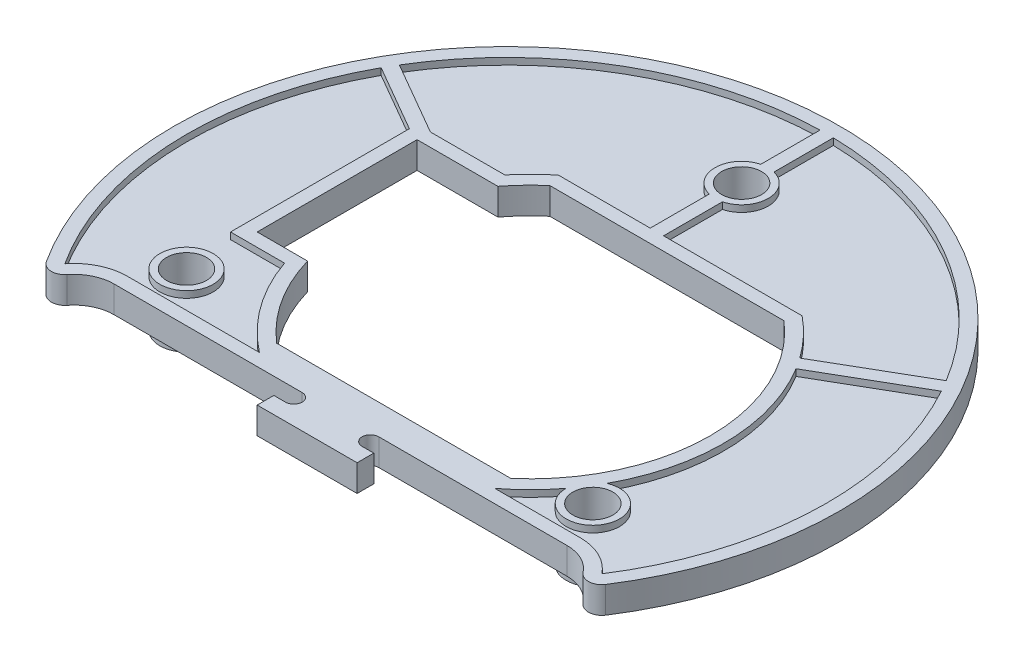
ISO-10303-21;
HEADER;
FILE_DESCRIPTION(('STEP AP214'),'2;1');
FILE_NAME('part.step','',(''),(''),'','','');
FILE_SCHEMA(('AUTOMOTIVE_DESIGN { 1 0 10303 214 1 1 1 1 }'));
ENDSEC;
DATA;
#1=APPLICATION_CONTEXT('core data for automotive mechanical design processes');
#2=APPLICATION_PROTOCOL_DEFINITION('international standard','automotive_design',2000,#1);
#3=PRODUCT_CONTEXT('',#1,'mechanical');
#4=PRODUCT('Part','Part','',(#3));
#5=PRODUCT_RELATED_PRODUCT_CATEGORY('part','',(#4));
#6=PRODUCT_DEFINITION_FORMATION('','',#4);
#7=PRODUCT_DEFINITION_CONTEXT('part definition',#1,'design');
#8=PRODUCT_DEFINITION('design','',#6,#7);
#9=PRODUCT_DEFINITION_SHAPE('','',#8);
#10=(LENGTH_UNIT() NAMED_UNIT(*) SI_UNIT(.MILLI.,.METRE.));
#11=(NAMED_UNIT(*) PLANE_ANGLE_UNIT() SI_UNIT($,.RADIAN.));
#12=(NAMED_UNIT(*) SI_UNIT($,.STERADIAN.) SOLID_ANGLE_UNIT());
#13=UNCERTAINTY_MEASURE_WITH_UNIT(LENGTH_MEASURE(1.E-05),#10,'distance_accuracy_value','');
#14=(GEOMETRIC_REPRESENTATION_CONTEXT(3) GLOBAL_UNCERTAINTY_ASSIGNED_CONTEXT((#13)) GLOBAL_UNIT_ASSIGNED_CONTEXT((#10,
#11,#12)) REPRESENTATION_CONTEXT('',''));
#15=CARTESIAN_POINT('',(0.,0.,0.));
#16=DIRECTION('',(0.,0.,1.));
#17=DIRECTION('',(1.,0.,0.));
#18=AXIS2_PLACEMENT_3D('',#15,#16,#17);
#19=CARTESIAN_POINT('',(-30.5,-6.,17.6091832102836));
#20=DIRECTION('',(0.,1.,0.));
#21=DIRECTION('',(0.,0.,1.));
#22=AXIS2_PLACEMENT_3D('',#19,#20,#21);
#23=PLANE('',#22);
#24=CARTESIAN_POINT('',(-30.5,-6.,17.6091832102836));
#25=DIRECTION('',(0.,1.,0.));
#26=DIRECTION('',(0.,0.,1.));
#27=AXIS2_PLACEMENT_3D('',#24,#25,#26);
#28=CIRCLE('',#27,4.);
#29=CARTESIAN_POINT('',(-30.5,-6.,21.6091832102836));
#30=VERTEX_POINT('',#29);
#31=EDGE_CURVE('E792',#30,#30,#28,.T.);
#32=ORIENTED_EDGE('',*,*,#31,.F.);
#33=EDGE_LOOP('',(#32));
#34=FACE_BOUND('',#33,.T.);
#35=CARTESIAN_POINT('',(-30.5,-6.,17.6091832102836));
#36=DIRECTION('',(0.,-1.,0.));
#37=DIRECTION('',(0.,0.,-1.));
#38=AXIS2_PLACEMENT_3D('',#35,#36,#37);
#39=CIRCLE('',#38,3.);
#40=CARTESIAN_POINT('',(-30.5,-6.,14.6091832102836));
#41=VERTEX_POINT('',#40);
#42=EDGE_CURVE('E20',#41,#41,#39,.F.);
#43=ORIENTED_EDGE('',*,*,#42,.T.);
#44=EDGE_LOOP('',(#43));
#45=FACE_BOUND('',#44,.T.);
#46=ADVANCED_FACE('F17',(#34,#45),#23,.F.);
#47=CARTESIAN_POINT('',(-30.5,2.,17.6091832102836));
#48=DIRECTION('',(0.,-1.,0.));
#49=DIRECTION('',(0.,0.,-1.));
#50=AXIS2_PLACEMENT_3D('',#47,#48,#49);
#51=CYLINDRICAL_SURFACE('',#50,3.);
#52=ORIENTED_EDGE('',*,*,#42,.F.);
#53=EDGE_LOOP('',(#52));
#54=FACE_BOUND('',#53,.T.);
#55=CARTESIAN_POINT('',(-30.5,2.,17.6091832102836));
#56=DIRECTION('',(0.,-1.,0.));
#57=DIRECTION('',(0.,0.,-1.));
#58=AXIS2_PLACEMENT_3D('',#55,#56,#57);
#59=CIRCLE('',#58,3.);
#60=CARTESIAN_POINT('',(-30.5,2.,14.6091832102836));
#61=VERTEX_POINT('',#60);
#62=EDGE_CURVE('E790',#61,#61,#59,.T.);
#63=ORIENTED_EDGE('',*,*,#62,.F.);
#64=EDGE_LOOP('',(#63));
#65=FACE_BOUND('',#64,.T.);
#66=ADVANCED_FACE('F800',(#54,#65),#51,.F.);
#67=CARTESIAN_POINT('',(-30.5,-6.,17.6091832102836));
#68=DIRECTION('',(0.,1.,0.));
#69=DIRECTION('',(0.,0.,1.));
#70=AXIS2_PLACEMENT_3D('',#67,#68,#69);
#71=CYLINDRICAL_SURFACE('',#70,4.);
#72=ORIENTED_EDGE('',*,*,#31,.T.);
#73=EDGE_LOOP('',(#72));
#74=FACE_BOUND('',#73,.T.);
#75=CARTESIAN_POINT('',(-30.5,-1.,17.6091832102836));
#76=DIRECTION('',(0.,1.,0.));
#77=DIRECTION('',(0.,0.,1.));
#78=AXIS2_PLACEMENT_3D('',#75,#76,#77);
#79=CIRCLE('',#78,4.);
#80=CARTESIAN_POINT('',(-30.5,-1.,21.6091832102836));
#81=VERTEX_POINT('',#80);
#82=EDGE_CURVE('E787',#81,#81,#79,.T.);
#83=ORIENTED_EDGE('',*,*,#82,.F.);
#84=EDGE_LOOP('',(#83));
#85=FACE_BOUND('',#84,.T.);
#86=ADVANCED_FACE('F803',(#74,#85),#71,.T.);
#87=CARTESIAN_POINT('',(-5.75,2.,26.25));
#88=DIRECTION('',(0.,1.,0.));
#89=DIRECTION('',(0.,0.,1.));
#90=AXIS2_PLACEMENT_3D('',#87,#88,#89);
#91=PLANE('',#90);
#92=CARTESIAN_POINT('',(-30.5,2.,17.6091832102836));
#93=DIRECTION('',(0.,1.,0.));
#94=DIRECTION('',(0.,0.,1.));
#95=AXIS2_PLACEMENT_3D('',#92,#93,#94);
#96=CIRCLE('',#95,4.);
#97=CARTESIAN_POINT('',(-30.5,2.,21.6091832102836));
#98=VERTEX_POINT('',#97);
#99=EDGE_CURVE('E458',#98,#98,#96,.F.);
#100=ORIENTED_EDGE('',*,*,#99,.F.);
#101=EDGE_LOOP('',(#100));
#102=FACE_BOUND('',#101,.T.);
#103=ORIENTED_EDGE('',*,*,#62,.T.);
#104=EDGE_LOOP('',(#103));
#105=FACE_BOUND('',#104,.T.);
#106=ADVANCED_FACE('F806',(#102,#105),#91,.T.);
#107=CARTESIAN_POINT('',(30.5,-1.,17.6091832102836));
#108=DIRECTION('',(0.,-1.,0.));
#109=DIRECTION('',(0.,0.,-1.));
#110=AXIS2_PLACEMENT_3D('',#107,#108,#109);
#111=PLANE('',#110);
#112=CARTESIAN_POINT('',(3.5,-0.999999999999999,0.));
#113=DIRECTION('',(0.,-1.,0.));
#114=DIRECTION('',(0.,0.,-1.));
#115=AXIS2_PLACEMENT_3D('',#112,#113,#114);
#116=CIRCLE('',#115,29.);
#117=CARTESIAN_POINT('',(-14.1635217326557,-0.999999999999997,23.));
#118=VERTEX_POINT('',#117);
#119=CARTESIAN_POINT('',(-23.8998175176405,-0.999999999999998,9.50000000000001));
#120=VERTEX_POINT('',#119);
#121=EDGE_CURVE('E765',#118,#120,#116,.T.);
#122=ORIENTED_EDGE('',*,*,#121,.F.);
#123=DIRECTION('',(-1.,0.,0.));
#124=VECTOR('',#123,1.);
#125=CARTESIAN_POINT('',(-34.,-0.999999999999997,23.));
#126=LINE('',#125,#124);
#127=CARTESIAN_POINT('',(-34.,-0.999999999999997,23.));
#128=VERTEX_POINT('',#127);
#129=EDGE_CURVE('E777',#128,#118,#126,.F.);
#130=ORIENTED_EDGE('',*,*,#129,.F.);
#131=CARTESIAN_POINT('',(-34.,-0.999999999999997,31.));
#132=DIRECTION('',(0.,-1.,0.));
#133=DIRECTION('',(0.,0.,-1.));
#134=AXIS2_PLACEMENT_3D('',#131,#132,#133);
#135=CIRCLE('',#134,8.00000000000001);
#136=CARTESIAN_POINT('',(-40.301983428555,-0.999999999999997,26.0720181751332));
#137=VERTEX_POINT('',#136);
#138=EDGE_CURVE('E773',#137,#128,#135,.T.);
#139=ORIENTED_EDGE('',*,*,#138,.F.);
#140=CARTESIAN_POINT('',(0.,-0.999999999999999,0.));
#141=DIRECTION('',(0.,-1.,0.));
#142=DIRECTION('',(0.,0.,-1.));
#143=AXIS2_PLACEMENT_3D('',#140,#141,#142);
#144=CIRCLE('',#143,48.);
#145=CARTESIAN_POINT('',(-42.0467557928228,-1.,-23.1531925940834));
#146=VERTEX_POINT('',#145);
#147=EDGE_CURVE('E769',#137,#146,#144,.T.);
#148=ORIENTED_EDGE('',*,*,#147,.T.);
#149=DIRECTION('',(0.865734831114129,0.,0.500502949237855));
#150=VECTOR('',#149,1.);
#151=CARTESIAN_POINT('',(-32.5005029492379,-1.,-17.6342651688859));
#152=LINE('',#151,#150);
#153=CARTESIAN_POINT('',(-32.,-1.,-17.3449119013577));
#154=VERTEX_POINT('',#153);
#155=EDGE_CURVE('E771',#154,#146,#152,.F.);
#156=ORIENTED_EDGE('',*,*,#155,.F.);
#157=DIRECTION('',(0.,0.,1.));
#158=VECTOR('',#157,1.);
#159=CARTESIAN_POINT('',(-32.,-1.,-18.5));
#160=LINE('',#159,#158);
#161=CARTESIAN_POINT('',(-32.,-1.,9.5));
#162=VERTEX_POINT('',#161);
#163=EDGE_CURVE('E1236',#162,#154,#160,.F.);
#164=ORIENTED_EDGE('',*,*,#163,.F.);
#165=DIRECTION('',(1.,0.,0.));
#166=VECTOR('',#165,1.);
#167=CARTESIAN_POINT('',(-32.,-1.,9.5));
#168=LINE('',#167,#166);
#169=EDGE_CURVE('E1232',#120,#162,#168,.F.);
#170=ORIENTED_EDGE('',*,*,#169,.F.);
#171=EDGE_LOOP('',(#122,#130,#139,#148,#156,#164,#170));
#172=FACE_BOUND('',#171,.T.);
#173=ORIENTED_EDGE('',*,*,#82,.T.);
#174=EDGE_LOOP('',(#173));
#175=FACE_BOUND('',#174,.T.);
#176=ADVANCED_FACE('F808',(#172,#175),#111,.T.);
#177=CARTESIAN_POINT('',(30.5,-1.,17.6091832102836));
#178=DIRECTION('',(0.,-1.,0.));
#179=DIRECTION('',(0.,0.,-1.));
#180=AXIS2_PLACEMENT_3D('',#177,#178,#179);
#181=PLANE('',#180);
#182=DIRECTION('',(1.,0.,0.));
#183=VECTOR('',#182,1.);
#184=CARTESIAN_POINT('',(21.796174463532,-1.,-22.5));
#185=LINE('',#184,#183);
#186=CARTESIAN_POINT('',(-14.796174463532,-1.,-22.5));
#187=VERTEX_POINT('',#186);
#188=CARTESIAN_POINT('',(-0.999999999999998,-1.,-22.5));
#189=VERTEX_POINT('',#188);
#190=EDGE_CURVE('E1192',#187,#189,#185,.T.);
#191=ORIENTED_EDGE('',*,*,#190,.F.);
#192=CARTESIAN_POINT('',(3.5,-1.,0.));
#193=DIRECTION('',(0.,-1.,0.));
#194=DIRECTION('',(0.,0.,-1.));
#195=AXIS2_PLACEMENT_3D('',#192,#193,#194);
#196=CIRCLE('',#195,29.);
#197=CARTESIAN_POINT('',(-18.8327114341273,-1.,-18.5));
#198=VERTEX_POINT('',#197);
#199=EDGE_CURVE('E757',#198,#187,#196,.T.);
#200=ORIENTED_EDGE('',*,*,#199,.F.);
#201=DIRECTION('',(-1.,0.,0.));
#202=VECTOR('',#201,1.);
#203=CARTESIAN_POINT('',(-18.8327114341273,-1.,-18.5));
#204=LINE('',#203,#202);
#205=CARTESIAN_POINT('',(-30.0020097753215,-1.,-18.5));
#206=VERTEX_POINT('',#205);
#207=EDGE_CURVE('E1204',#206,#198,#204,.F.);
#208=ORIENTED_EDGE('',*,*,#207,.F.);
#209=DIRECTION('',(0.865734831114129,0.,0.500502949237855));
#210=VECTOR('',#209,1.);
#211=CARTESIAN_POINT('',(-31.4994970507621,-1.,-19.3657348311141));
#212=LINE('',#211,#210);
#213=CARTESIAN_POINT('',(-41.0457498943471,-0.999999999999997,-24.8846622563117));
#214=VERTEX_POINT('',#213);
#215=EDGE_CURVE('E756',#206,#214,#212,.F.);
#216=ORIENTED_EDGE('',*,*,#215,.T.);
#217=CARTESIAN_POINT('',(0.,-0.999999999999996,0.));
#218=DIRECTION('',(0.,-1.,0.));
#219=DIRECTION('',(0.,0.,-1.));
#220=AXIS2_PLACEMENT_3D('',#217,#218,#219);
#221=CIRCLE('',#220,48.);
#222=CARTESIAN_POINT('',(-0.999999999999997,-1.,-47.9895822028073));
#223=VERTEX_POINT('',#222);
#224=EDGE_CURVE('E753',#214,#223,#221,.T.);
#225=ORIENTED_EDGE('',*,*,#224,.T.);
#226=DIRECTION('',(0.,0.,-1.));
#227=VECTOR('',#226,1.);
#228=CARTESIAN_POINT('',(-0.999999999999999,-1.,-22.5));
#229=LINE('',#228,#227);
#230=CARTESIAN_POINT('',(-0.999999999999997,-1.,-39.0913497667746));
#231=VERTEX_POINT('',#230);
#232=EDGE_CURVE('E1282',#223,#231,#229,.F.);
#233=ORIENTED_EDGE('',*,*,#232,.T.);
#234=CARTESIAN_POINT('',(0.,-1.,-35.2183664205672));
#235=DIRECTION('',(0.,1.,0.));
#236=DIRECTION('',(0.,0.,1.));
#237=AXIS2_PLACEMENT_3D('',#234,#235,#236);
#238=CIRCLE('',#237,4.);
#239=CARTESIAN_POINT('',(-0.999999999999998,-1.,-31.3453830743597));
#240=VERTEX_POINT('',#239);
#241=EDGE_CURVE('E744',#240,#231,#238,.F.);
#242=ORIENTED_EDGE('',*,*,#241,.F.);
#243=DIRECTION('',(0.,0.,-1.));
#244=VECTOR('',#243,1.);
#245=CARTESIAN_POINT('',(-0.999999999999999,-1.,-22.5));
#246=LINE('',#245,#244);
#247=EDGE_CURVE('E1197',#240,#189,#246,.F.);
#248=ORIENTED_EDGE('',*,*,#247,.T.);
#249=EDGE_LOOP('',(#191,#200,#208,#216,#225,#233,#242,#248));
#250=FACE_BOUND('',#249,.T.);
#251=ADVANCED_FACE('F816',(#250),#181,.T.);
#252=CARTESIAN_POINT('',(30.5,-1.,17.6091832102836));
#253=DIRECTION('',(0.,-1.,0.));
#254=DIRECTION('',(0.,0.,-1.));
#255=AXIS2_PLACEMENT_3D('',#252,#253,#254);
#256=PLANE('',#255);
#257=DIRECTION('',(0.,0.,-1.));
#258=VECTOR('',#257,1.);
#259=CARTESIAN_POINT('',(1.,-0.999999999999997,-22.5));
#260=LINE('',#259,#258);
#261=CARTESIAN_POINT('',(1.,-0.999999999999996,-47.9895822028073));
#262=VERTEX_POINT('',#261);
#263=CARTESIAN_POINT('',(1.,-0.999999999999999,-39.0913497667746));
#264=VERTEX_POINT('',#263);
#265=EDGE_CURVE('E1280',#262,#264,#260,.F.);
#266=ORIENTED_EDGE('',*,*,#265,.F.);
#267=CARTESIAN_POINT('',(0.,-0.999999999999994,0.));
#268=DIRECTION('',(0.,-1.,0.));
#269=DIRECTION('',(0.,0.,-1.));
#270=AXIS2_PLACEMENT_3D('',#267,#268,#269);
#271=CIRCLE('',#270,48.);
#272=CARTESIAN_POINT('',(41.0457498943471,-0.999999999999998,-24.8846622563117));
#273=VERTEX_POINT('',#272);
#274=EDGE_CURVE('E749',#262,#273,#271,.T.);
#275=ORIENTED_EDGE('',*,*,#274,.T.);
#276=DIRECTION('',(-0.865734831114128,0.,0.500502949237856));
#277=VECTOR('',#276,1.);
#278=CARTESIAN_POINT('',(27.1831997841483,-1.,-16.870375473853));
#279=LINE('',#278,#277);
#280=CARTESIAN_POINT('',(27.1157644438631,-1.,-16.8313894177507));
#281=VERTEX_POINT('',#280);
#282=EDGE_CURVE('E1288',#281,#273,#279,.F.);
#283=ORIENTED_EDGE('',*,*,#282,.F.);
#284=CARTESIAN_POINT('',(3.5,-1.,0.));
#285=DIRECTION('',(0.,-1.,0.));
#286=DIRECTION('',(0.,0.,-1.));
#287=AXIS2_PLACEMENT_3D('',#284,#285,#286);
#288=CIRCLE('',#287,29.);
#289=CARTESIAN_POINT('',(21.796174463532,-1.,-22.5));
#290=VERTEX_POINT('',#289);
#291=EDGE_CURVE('E762',#290,#281,#288,.T.);
#292=ORIENTED_EDGE('',*,*,#291,.F.);
#293=DIRECTION('',(1.,0.,0.));
#294=VECTOR('',#293,1.);
#295=CARTESIAN_POINT('',(21.796174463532,-1.,-22.5));
#296=LINE('',#295,#294);
#297=CARTESIAN_POINT('',(1.,-1.,-22.5));
#298=VERTEX_POINT('',#297);
#299=EDGE_CURVE('E764',#298,#290,#296,.T.);
#300=ORIENTED_EDGE('',*,*,#299,.F.);
#301=DIRECTION('',(0.,0.,-1.));
#302=VECTOR('',#301,1.);
#303=CARTESIAN_POINT('',(1.,-1.,-22.5));
#304=LINE('',#303,#302);
#305=CARTESIAN_POINT('',(1.,-1.,-31.3453830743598));
#306=VERTEX_POINT('',#305);
#307=EDGE_CURVE('E1274',#306,#298,#304,.F.);
#308=ORIENTED_EDGE('',*,*,#307,.F.);
#309=CARTESIAN_POINT('',(0.,-1.,-35.2183664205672));
#310=DIRECTION('',(0.,1.,0.));
#311=DIRECTION('',(0.,0.,1.));
#312=AXIS2_PLACEMENT_3D('',#309,#310,#311);
#313=CIRCLE('',#312,4.);
#314=EDGE_CURVE('E739',#264,#306,#313,.F.);
#315=ORIENTED_EDGE('',*,*,#314,.F.);
#316=EDGE_LOOP('',(#266,#275,#283,#292,#300,#308,#315));
#317=FACE_BOUND('',#316,.T.);
#318=ADVANCED_FACE('F1182',(#317),#256,.T.);
#319=CARTESIAN_POINT('',(30.5,-1.,17.6091832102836));
#320=DIRECTION('',(0.,-1.,0.));
#321=DIRECTION('',(0.,0.,-1.));
#322=AXIS2_PLACEMENT_3D('',#319,#320,#321);
#323=PLANE('',#322);
#324=CARTESIAN_POINT('',(30.5,-1.,17.6091832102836));
#325=DIRECTION('',(0.,1.,0.));
#326=DIRECTION('',(0.,0.,1.));
#327=AXIS2_PLACEMENT_3D('',#324,#325,#326);
#328=CIRCLE('',#327,4.);
#329=CARTESIAN_POINT('',(28.9368014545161,-1.,13.9272801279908));
#330=VERTEX_POINT('',#329);
#331=CARTESIAN_POINT('',(26.5003627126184,-1.,17.6630494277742));
#332=VERTEX_POINT('',#331);
#333=EDGE_CURVE('E736',#330,#332,#328,.F.);
#334=ORIENTED_EDGE('',*,*,#333,.F.);
#335=CARTESIAN_POINT('',(3.5,-1.,0.));
#336=DIRECTION('',(0.,-1.,0.));
#337=DIRECTION('',(0.,0.,-1.));
#338=AXIS2_PLACEMENT_3D('',#335,#336,#337);
#339=CIRCLE('',#338,29.);
#340=CARTESIAN_POINT('',(28.2216148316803,-1.,-15.1605329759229));
#341=VERTEX_POINT('',#340);
#342=EDGE_CURVE('E781',#341,#330,#339,.T.);
#343=ORIENTED_EDGE('',*,*,#342,.F.);
#344=DIRECTION('',(0.865734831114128,0.,-0.500502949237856));
#345=VECTOR('',#344,1.);
#346=CARTESIAN_POINT('',(28.184205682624,-1.,-15.1389058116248));
#347=LINE('',#346,#345);
#348=CARTESIAN_POINT('',(42.0467557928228,-1.,-23.1531925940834));
#349=VERTEX_POINT('',#348);
#350=EDGE_CURVE('E475',#349,#341,#347,.F.);
#351=ORIENTED_EDGE('',*,*,#350,.F.);
#352=CARTESIAN_POINT('',(0.,-0.999999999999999,0.));
#353=DIRECTION('',(0.,-1.,0.));
#354=DIRECTION('',(0.,0.,-1.));
#355=AXIS2_PLACEMENT_3D('',#352,#353,#354);
#356=CIRCLE('',#355,48.);
#357=CARTESIAN_POINT('',(40.3019834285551,-0.999999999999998,26.0720181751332));
#358=VERTEX_POINT('',#357);
#359=EDGE_CURVE('E455',#349,#358,#356,.T.);
#360=ORIENTED_EDGE('',*,*,#359,.T.);
#361=CARTESIAN_POINT('',(34.,-0.999999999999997,31.));
#362=DIRECTION('',(0.,-1.,0.));
#363=DIRECTION('',(0.,0.,-1.));
#364=AXIS2_PLACEMENT_3D('',#361,#362,#363);
#365=CIRCLE('',#364,8.);
#366=CARTESIAN_POINT('',(34.,-0.999999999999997,23.));
#367=VERTEX_POINT('',#366);
#368=EDGE_CURVE('E447',#367,#358,#365,.T.);
#369=ORIENTED_EDGE('',*,*,#368,.F.);
#370=DIRECTION('',(-1.,0.,0.));
#371=VECTOR('',#370,1.);
#372=CARTESIAN_POINT('',(21.1635217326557,-0.999999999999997,23.));
#373=LINE('',#372,#371);
#374=CARTESIAN_POINT('',(21.1635217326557,-1.,23.));
#375=VERTEX_POINT('',#374);
#376=EDGE_CURVE('E452',#375,#367,#373,.F.);
#377=ORIENTED_EDGE('',*,*,#376,.F.);
#378=CARTESIAN_POINT('',(3.5,-1.,0.));
#379=DIRECTION('',(0.,-1.,0.));
#380=DIRECTION('',(0.,0.,-1.));
#381=AXIS2_PLACEMENT_3D('',#378,#379,#380);
#382=CIRCLE('',#381,29.);
#383=EDGE_CURVE('E467',#332,#375,#382,.T.);
#384=ORIENTED_EDGE('',*,*,#383,.F.);
#385=EDGE_LOOP('',(#334,#343,#351,#360,#369,#377,#384));
#386=FACE_BOUND('',#385,.T.);
#387=ADVANCED_FACE('F449',(#386),#323,.T.);
#388=CARTESIAN_POINT('',(-30.5,1.,17.6091832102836));
#389=DIRECTION('',(0.,1.,0.));
#390=DIRECTION('',(0.,0.,1.));
#391=AXIS2_PLACEMENT_3D('',#388,#389,#390);
#392=CYLINDRICAL_SURFACE('',#391,4.);
#393=CARTESIAN_POINT('',(-30.5,1.,17.6091832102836));
#394=DIRECTION('',(0.,1.,0.));
#395=DIRECTION('',(0.,0.,1.));
#396=AXIS2_PLACEMENT_3D('',#393,#394,#395);
#397=CIRCLE('',#396,4.);
#398=CARTESIAN_POINT('',(-30.5,1.,21.6091832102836));
#399=VERTEX_POINT('',#398);
#400=EDGE_CURVE('E733',#399,#399,#397,.F.);
#401=ORIENTED_EDGE('',*,*,#400,.F.);
#402=EDGE_LOOP('',(#401));
#403=FACE_BOUND('',#402,.T.);
#404=ORIENTED_EDGE('',*,*,#99,.T.);
#405=EDGE_LOOP('',(#404));
#406=FACE_BOUND('',#405,.T.);
#407=ADVANCED_FACE('F1176',(#403,#406),#392,.T.);
#408=CARTESIAN_POINT('',(34.,-0.999999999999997,31.));
#409=DIRECTION('',(0.,-1.,0.));
#410=DIRECTION('',(0.,0.,-1.));
#411=AXIS2_PLACEMENT_3D('',#408,#409,#410);
#412=CYLINDRICAL_SURFACE('',#411,8.);
#413=ORIENTED_EDGE('',*,*,#368,.T.);
#414=DIRECTION('',(0.,-1.,0.));
#415=VECTOR('',#414,1.);
#416=CARTESIAN_POINT('',(40.301983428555,-0.999999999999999,26.0720181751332));
#417=LINE('',#416,#415);
#418=CARTESIAN_POINT('',(40.3019834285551,-2.,26.0720181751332));
#419=VERTEX_POINT('',#418);
#420=EDGE_CURVE('E779',#358,#419,#417,.T.);
#421=ORIENTED_EDGE('',*,*,#420,.T.);
#422=CARTESIAN_POINT('',(34.,-2.,31.));
#423=DIRECTION('',(0.,-1.,0.));
#424=DIRECTION('',(0.,0.,-1.));
#425=AXIS2_PLACEMENT_3D('',#422,#423,#424);
#426=CIRCLE('',#425,8.);
#427=CARTESIAN_POINT('',(34.,-2.,23.));
#428=VERTEX_POINT('',#427);
#429=EDGE_CURVE('E464',#419,#428,#426,.F.);
#430=ORIENTED_EDGE('',*,*,#429,.T.);
#431=DIRECTION('',(0.,1.,0.));
#432=VECTOR('',#431,1.);
#433=CARTESIAN_POINT('',(34.,-0.999999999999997,23.));
#434=LINE('',#433,#432);
#435=EDGE_CURVE('E461',#367,#428,#434,.F.);
#436=ORIENTED_EDGE('',*,*,#435,.F.);
#437=EDGE_LOOP('',(#413,#421,#430,#436));
#438=FACE_BOUND('',#437,.T.);
#439=ADVANCED_FACE('F462',(#438),#412,.T.);
#440=CARTESIAN_POINT('',(21.1635217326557,-0.999999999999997,23.));
#441=DIRECTION('',(0.,0.,-1.));
#442=DIRECTION('',(-1.,0.,0.));
#443=AXIS2_PLACEMENT_3D('',#440,#441,#442);
#444=PLANE('',#443);
#445=ORIENTED_EDGE('',*,*,#376,.T.);
#446=ORIENTED_EDGE('',*,*,#435,.T.);
#447=DIRECTION('',(1.,0.,0.));
#448=VECTOR('',#447,1.);
#449=CARTESIAN_POINT('',(-5.75,-2.,23.));
#450=LINE('',#449,#448);
#451=CARTESIAN_POINT('',(21.1635217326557,-2.,23.));
#452=VERTEX_POINT('',#451);
#453=EDGE_CURVE('E731',#428,#452,#450,.F.);
#454=ORIENTED_EDGE('',*,*,#453,.T.);
#455=DIRECTION('',(0.,-1.,0.));
#456=VECTOR('',#455,1.);
#457=CARTESIAN_POINT('',(21.1635217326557,-1.,23.));
#458=LINE('',#457,#456);
#459=EDGE_CURVE('E471',#375,#452,#458,.T.);
#460=ORIENTED_EDGE('',*,*,#459,.F.);
#461=EDGE_LOOP('',(#445,#446,#454,#460));
#462=FACE_BOUND('',#461,.T.);
#463=ADVANCED_FACE('F469',(#462),#444,.T.);
#464=CARTESIAN_POINT('',(3.5,-1.,0.));
#465=DIRECTION('',(0.,-1.,0.));
#466=DIRECTION('',(0.,0.,-1.));
#467=AXIS2_PLACEMENT_3D('',#464,#465,#466);
#468=CYLINDRICAL_SURFACE('',#467,29.);
#469=ORIENTED_EDGE('',*,*,#383,.T.);
#470=ORIENTED_EDGE('',*,*,#459,.T.);
#471=CARTESIAN_POINT('',(3.5,-2.,0.));
#472=DIRECTION('',(0.,-1.,0.));
#473=DIRECTION('',(0.,0.,-1.));
#474=AXIS2_PLACEMENT_3D('',#471,#472,#473);
#475=CIRCLE('',#474,29.);
#476=CARTESIAN_POINT('',(26.5003627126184,-2.,17.6630494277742));
#477=VERTEX_POINT('',#476);
#478=EDGE_CURVE('E729',#452,#477,#475,.F.);
#479=ORIENTED_EDGE('',*,*,#478,.T.);
#480=DIRECTION('',(0.,1.,0.));
#481=VECTOR('',#480,1.);
#482=CARTESIAN_POINT('',(26.5003627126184,-6.,17.6630494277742));
#483=LINE('',#482,#481);
#484=EDGE_CURVE('E1268',#332,#477,#483,.F.);
#485=ORIENTED_EDGE('',*,*,#484,.F.);
#486=EDGE_LOOP('',(#469,#470,#479,#485));
#487=FACE_BOUND('',#486,.T.);
#488=ADVANCED_FACE('F1167',(#487),#468,.T.);
#489=CARTESIAN_POINT('',(3.5,-1.,0.));
#490=DIRECTION('',(0.,-1.,0.));
#491=DIRECTION('',(0.,0.,-1.));
#492=AXIS2_PLACEMENT_3D('',#489,#490,#491);
#493=CYLINDRICAL_SURFACE('',#492,29.);
#494=DIRECTION('',(0.,1.,0.));
#495=VECTOR('',#494,1.);
#496=CARTESIAN_POINT('',(28.9368014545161,-6.,13.9272801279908));
#497=LINE('',#496,#495);
#498=CARTESIAN_POINT('',(28.9368014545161,-2.,13.9272801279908));
#499=VERTEX_POINT('',#498);
#500=EDGE_CURVE('E738',#499,#330,#497,.T.);
#501=ORIENTED_EDGE('',*,*,#500,.F.);
#502=CARTESIAN_POINT('',(3.5,-2.,0.));
#503=DIRECTION('',(0.,-1.,0.));
#504=DIRECTION('',(0.,0.,-1.));
#505=AXIS2_PLACEMENT_3D('',#502,#503,#504);
#506=CIRCLE('',#505,29.);
#507=CARTESIAN_POINT('',(28.2216148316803,-2.,-15.1605329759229));
#508=VERTEX_POINT('',#507);
#509=EDGE_CURVE('E724',#499,#508,#506,.F.);
#510=ORIENTED_EDGE('',*,*,#509,.T.);
#511=DIRECTION('',(0.,1.,0.));
#512=VECTOR('',#511,1.);
#513=CARTESIAN_POINT('',(28.2216148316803,-2.,-15.1605329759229));
#514=LINE('',#513,#512);
#515=EDGE_CURVE('E780',#341,#508,#514,.F.);
#516=ORIENTED_EDGE('',*,*,#515,.F.);
#517=ORIENTED_EDGE('',*,*,#342,.T.);
#518=EDGE_LOOP('',(#501,#510,#516,#517));
#519=FACE_BOUND('',#518,.T.);
#520=ADVANCED_FACE('F1163',(#519),#493,.T.);
#521=CARTESIAN_POINT('',(28.184205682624,-2.,-15.1389058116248));
#522=DIRECTION('',(0.500502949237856,0.,0.865734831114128));
#523=DIRECTION('',(0.865734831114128,0.,-0.500502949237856));
#524=AXIS2_PLACEMENT_3D('',#521,#522,#523);
#525=PLANE('',#524);
#526=ORIENTED_EDGE('',*,*,#350,.T.);
#527=ORIENTED_EDGE('',*,*,#515,.T.);
#528=DIRECTION('',(0.865734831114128,0.,-0.500502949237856));
#529=VECTOR('',#528,1.);
#530=CARTESIAN_POINT('',(28.2216148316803,-2.,-15.1605329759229));
#531=LINE('',#530,#529);
#532=CARTESIAN_POINT('',(42.0467557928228,-2.,-23.1531925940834));
#533=VERTEX_POINT('',#532);
#534=EDGE_CURVE('E723',#508,#533,#531,.T.);
#535=ORIENTED_EDGE('',*,*,#534,.T.);
#536=DIRECTION('',(0.,-1.,0.));
#537=VECTOR('',#536,1.);
#538=CARTESIAN_POINT('',(42.0467557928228,-1.,-23.1531925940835));
#539=LINE('',#538,#537);
#540=EDGE_CURVE('E1231',#533,#349,#539,.F.);
#541=ORIENTED_EDGE('',*,*,#540,.T.);
#542=EDGE_LOOP('',(#526,#527,#535,#541));
#543=FACE_BOUND('',#542,.T.);
#544=ADVANCED_FACE('F1159',(#543),#525,.T.);
#545=CARTESIAN_POINT('',(0.,-1.,0.));
#546=DIRECTION('',(0.,-1.,0.));
#547=DIRECTION('',(0.,0.,-1.));
#548=AXIS2_PLACEMENT_3D('',#545,#546,#547);
#549=CYLINDRICAL_SURFACE('',#548,48.);
#550=CARTESIAN_POINT('',(0.,-2.,0.));
#551=DIRECTION('',(0.,-1.,0.));
#552=DIRECTION('',(0.,0.,-1.));
#553=AXIS2_PLACEMENT_3D('',#550,#551,#552);
#554=CIRCLE('',#553,48.);
#555=EDGE_CURVE('E720',#533,#419,#554,.T.);
#556=ORIENTED_EDGE('',*,*,#555,.T.);
#557=ORIENTED_EDGE('',*,*,#420,.F.);
#558=ORIENTED_EDGE('',*,*,#359,.F.);
#559=ORIENTED_EDGE('',*,*,#540,.F.);
#560=EDGE_LOOP('',(#556,#557,#558,#559));
#561=FACE_BOUND('',#560,.T.);
#562=ADVANCED_FACE('F1155',(#561),#549,.F.);
#563=CARTESIAN_POINT('',(-34.,-0.999999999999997,23.));
#564=DIRECTION('',(0.,0.,-1.));
#565=DIRECTION('',(-1.,0.,0.));
#566=AXIS2_PLACEMENT_3D('',#563,#564,#565);
#567=PLANE('',#566);
#568=ORIENTED_EDGE('',*,*,#129,.T.);
#569=DIRECTION('',(0.,-1.,0.));
#570=VECTOR('',#569,1.);
#571=CARTESIAN_POINT('',(-14.1635217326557,-1.,23.));
#572=LINE('',#571,#570);
#573=CARTESIAN_POINT('',(-14.1635217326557,-2.,23.));
#574=VERTEX_POINT('',#573);
#575=EDGE_CURVE('E768',#574,#118,#572,.F.);
#576=ORIENTED_EDGE('',*,*,#575,.F.);
#577=DIRECTION('',(1.,0.,0.));
#578=VECTOR('',#577,1.);
#579=CARTESIAN_POINT('',(-5.75,-2.,23.));
#580=LINE('',#579,#578);
#581=CARTESIAN_POINT('',(-34.,-2.,23.));
#582=VERTEX_POINT('',#581);
#583=EDGE_CURVE('E719',#574,#582,#580,.F.);
#584=ORIENTED_EDGE('',*,*,#583,.T.);
#585=DIRECTION('',(0.,-1.,0.));
#586=VECTOR('',#585,1.);
#587=CARTESIAN_POINT('',(-34.,-0.999999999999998,23.));
#588=LINE('',#587,#586);
#589=EDGE_CURVE('E776',#128,#582,#588,.T.);
#590=ORIENTED_EDGE('',*,*,#589,.F.);
#591=EDGE_LOOP('',(#568,#576,#584,#590));
#592=FACE_BOUND('',#591,.T.);
#593=ADVANCED_FACE('F1151',(#592),#567,.T.);
#594=CARTESIAN_POINT('',(-34.,-0.999999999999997,31.));
#595=DIRECTION('',(0.,-1.,0.));
#596=DIRECTION('',(0.,0.,-1.));
#597=AXIS2_PLACEMENT_3D('',#594,#595,#596);
#598=CYLINDRICAL_SURFACE('',#597,8.00000000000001);
#599=ORIENTED_EDGE('',*,*,#138,.T.);
#600=ORIENTED_EDGE('',*,*,#589,.T.);
#601=CARTESIAN_POINT('',(-34.,-2.,31.));
#602=DIRECTION('',(0.,-1.,0.));
#603=DIRECTION('',(0.,0.,-1.));
#604=AXIS2_PLACEMENT_3D('',#601,#602,#603);
#605=CIRCLE('',#604,8.00000000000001);
#606=CARTESIAN_POINT('',(-40.301983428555,-2.,26.0720181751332));
#607=VERTEX_POINT('',#606);
#608=EDGE_CURVE('E717',#582,#607,#605,.F.);
#609=ORIENTED_EDGE('',*,*,#608,.T.);
#610=DIRECTION('',(0.,-1.,0.));
#611=VECTOR('',#610,1.);
#612=CARTESIAN_POINT('',(-40.301983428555,-0.999999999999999,26.0720181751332));
#613=LINE('',#612,#611);
#614=EDGE_CURVE('E772',#607,#137,#613,.F.);
#615=ORIENTED_EDGE('',*,*,#614,.T.);
#616=EDGE_LOOP('',(#599,#600,#609,#615));
#617=FACE_BOUND('',#616,.T.);
#618=ADVANCED_FACE('F1147',(#617),#598,.T.);
#619=CARTESIAN_POINT('',(0.,-1.,0.));
#620=DIRECTION('',(0.,-1.,0.));
#621=DIRECTION('',(0.,0.,-1.));
#622=AXIS2_PLACEMENT_3D('',#619,#620,#621);
#623=CYLINDRICAL_SURFACE('',#622,48.);
#624=ORIENTED_EDGE('',*,*,#614,.F.);
#625=CARTESIAN_POINT('',(0.,-2.,0.));
#626=DIRECTION('',(0.,-1.,0.));
#627=DIRECTION('',(0.,0.,-1.));
#628=AXIS2_PLACEMENT_3D('',#625,#626,#627);
#629=CIRCLE('',#628,48.);
#630=CARTESIAN_POINT('',(-42.0467557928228,-2.,-23.1531925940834));
#631=VERTEX_POINT('',#630);
#632=EDGE_CURVE('E714',#607,#631,#629,.T.);
#633=ORIENTED_EDGE('',*,*,#632,.T.);
#634=DIRECTION('',(0.,1.,0.));
#635=VECTOR('',#634,1.);
#636=CARTESIAN_POINT('',(-42.0467557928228,-2.,-23.1531925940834));
#637=LINE('',#636,#635);
#638=EDGE_CURVE('E1245',#146,#631,#637,.F.);
#639=ORIENTED_EDGE('',*,*,#638,.F.);
#640=ORIENTED_EDGE('',*,*,#147,.F.);
#641=EDGE_LOOP('',(#624,#633,#639,#640));
#642=FACE_BOUND('',#641,.T.);
#643=ADVANCED_FACE('F1143',(#642),#623,.F.);
#644=CARTESIAN_POINT('',(-32.5005029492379,-2.,-17.6342651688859));
#645=DIRECTION('',(-0.500502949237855,0.,0.865734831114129));
#646=DIRECTION('',(0.865734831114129,0.,0.500502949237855));
#647=AXIS2_PLACEMENT_3D('',#644,#645,#646);
#648=PLANE('',#647);
#649=ORIENTED_EDGE('',*,*,#638,.T.);
#650=DIRECTION('',(0.865734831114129,0.,0.500502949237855));
#651=VECTOR('',#650,1.);
#652=CARTESIAN_POINT('',(-42.0467557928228,-2.,-23.1531925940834));
#653=LINE('',#652,#651);
#654=CARTESIAN_POINT('',(-32.,-2.,-17.3449119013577));
#655=VERTEX_POINT('',#654);
#656=EDGE_CURVE('E716',#631,#655,#653,.T.);
#657=ORIENTED_EDGE('',*,*,#656,.T.);
#658=DIRECTION('',(0.,1.,0.));
#659=VECTOR('',#658,1.);
#660=CARTESIAN_POINT('',(-32.,-1.,-17.3449119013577));
#661=LINE('',#660,#659);
#662=EDGE_CURVE('E1241',#154,#655,#661,.F.);
#663=ORIENTED_EDGE('',*,*,#662,.F.);
#664=ORIENTED_EDGE('',*,*,#155,.T.);
#665=EDGE_LOOP('',(#649,#657,#663,#664));
#666=FACE_BOUND('',#665,.T.);
#667=ADVANCED_FACE('F1139',(#666),#648,.T.);
#668=CARTESIAN_POINT('',(-32.,-1.,-18.5));
#669=DIRECTION('',(-1.,0.,0.));
#670=DIRECTION('',(0.,0.,1.));
#671=AXIS2_PLACEMENT_3D('',#668,#669,#670);
#672=PLANE('',#671);
#673=DIRECTION('',(0.,1.,0.));
#674=VECTOR('',#673,1.);
#675=CARTESIAN_POINT('',(-32.,-1.,9.5));
#676=LINE('',#675,#674);
#677=CARTESIAN_POINT('',(-32.,-2.,9.5));
#678=VERTEX_POINT('',#677);
#679=EDGE_CURVE('E1235',#162,#678,#676,.F.);
#680=ORIENTED_EDGE('',*,*,#679,.F.);
#681=ORIENTED_EDGE('',*,*,#163,.T.);
#682=ORIENTED_EDGE('',*,*,#662,.T.);
#683=DIRECTION('',(0.,0.,1.));
#684=VECTOR('',#683,1.);
#685=CARTESIAN_POINT('',(-32.,-2.,26.25));
#686=LINE('',#685,#684);
#687=EDGE_CURVE('E1320',#655,#678,#686,.T.);
#688=ORIENTED_EDGE('',*,*,#687,.T.);
#689=EDGE_LOOP('',(#680,#681,#682,#688));
#690=FACE_BOUND('',#689,.T.);
#691=ADVANCED_FACE('F1135',(#690),#672,.T.);
#692=CARTESIAN_POINT('',(-32.,-1.,9.5));
#693=DIRECTION('',(0.,0.,1.));
#694=DIRECTION('',(1.,0.,0.));
#695=AXIS2_PLACEMENT_3D('',#692,#693,#694);
#696=PLANE('',#695);
#697=ORIENTED_EDGE('',*,*,#169,.T.);
#698=ORIENTED_EDGE('',*,*,#679,.T.);
#699=DIRECTION('',(1.,0.,0.));
#700=VECTOR('',#699,1.);
#701=CARTESIAN_POINT('',(-5.75,-2.,9.5));
#702=LINE('',#701,#700);
#703=CARTESIAN_POINT('',(-23.8998175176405,-2.,9.50000000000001));
#704=VERTEX_POINT('',#703);
#705=EDGE_CURVE('E713',#678,#704,#702,.T.);
#706=ORIENTED_EDGE('',*,*,#705,.T.);
#707=DIRECTION('',(0.,-1.,0.));
#708=VECTOR('',#707,1.);
#709=CARTESIAN_POINT('',(-23.8998175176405,-1.,9.50000000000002));
#710=LINE('',#709,#708);
#711=EDGE_CURVE('E1311',#120,#704,#710,.T.);
#712=ORIENTED_EDGE('',*,*,#711,.F.);
#713=EDGE_LOOP('',(#697,#698,#706,#712));
#714=FACE_BOUND('',#713,.T.);
#715=ADVANCED_FACE('F1131',(#714),#696,.T.);
#716=CARTESIAN_POINT('',(3.5,-1.,0.));
#717=DIRECTION('',(0.,-1.,0.));
#718=DIRECTION('',(0.,0.,-1.));
#719=AXIS2_PLACEMENT_3D('',#716,#717,#718);
#720=CYLINDRICAL_SURFACE('',#719,29.);
#721=ORIENTED_EDGE('',*,*,#575,.T.);
#722=ORIENTED_EDGE('',*,*,#121,.T.);
#723=ORIENTED_EDGE('',*,*,#711,.T.);
#724=CARTESIAN_POINT('',(3.5,-2.,0.));
#725=DIRECTION('',(0.,-1.,0.));
#726=DIRECTION('',(0.,0.,-1.));
#727=AXIS2_PLACEMENT_3D('',#724,#725,#726);
#728=CIRCLE('',#727,29.);
#729=EDGE_CURVE('E710',#704,#574,#728,.F.);
#730=ORIENTED_EDGE('',*,*,#729,.T.);
#731=EDGE_LOOP('',(#721,#722,#723,#730));
#732=FACE_BOUND('',#731,.T.);
#733=ADVANCED_FACE('F1127',(#732),#720,.T.);
#734=CARTESIAN_POINT('',(3.5,-1.,0.));
#735=DIRECTION('',(0.,-1.,0.));
#736=DIRECTION('',(0.,0.,-1.));
#737=AXIS2_PLACEMENT_3D('',#734,#735,#736);
#738=CYLINDRICAL_SURFACE('',#737,29.);
#739=DIRECTION('',(0.,1.,0.));
#740=VECTOR('',#739,1.);
#741=CARTESIAN_POINT('',(21.796174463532,-1.,-22.5));
#742=LINE('',#741,#740);
#743=CARTESIAN_POINT('',(21.796174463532,-2.,-22.5));
#744=VERTEX_POINT('',#743);
#745=EDGE_CURVE('E1227',#290,#744,#742,.F.);
#746=ORIENTED_EDGE('',*,*,#745,.F.);
#747=ORIENTED_EDGE('',*,*,#291,.T.);
#748=DIRECTION('',(0.,1.,0.));
#749=VECTOR('',#748,1.);
#750=CARTESIAN_POINT('',(27.1157644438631,-2.,-16.8313894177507));
#751=LINE('',#750,#749);
#752=CARTESIAN_POINT('',(27.1157644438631,-2.,-16.8313894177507));
#753=VERTEX_POINT('',#752);
#754=EDGE_CURVE('E751',#753,#281,#751,.T.);
#755=ORIENTED_EDGE('',*,*,#754,.F.);
#756=CARTESIAN_POINT('',(3.5,-2.,0.));
#757=DIRECTION('',(0.,-1.,0.));
#758=DIRECTION('',(0.,0.,-1.));
#759=AXIS2_PLACEMENT_3D('',#756,#757,#758);
#760=CIRCLE('',#759,29.);
#761=EDGE_CURVE('E707',#753,#744,#760,.F.);
#762=ORIENTED_EDGE('',*,*,#761,.T.);
#763=EDGE_LOOP('',(#746,#747,#755,#762));
#764=FACE_BOUND('',#763,.T.);
#765=ADVANCED_FACE('F1123',(#764),#738,.T.);
#766=CARTESIAN_POINT('',(21.796174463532,-1.,-22.5));
#767=DIRECTION('',(0.,0.,-1.));
#768=DIRECTION('',(0.,1.,0.));
#769=AXIS2_PLACEMENT_3D('',#766,#767,#768);
#770=PLANE('',#769);
#771=ORIENTED_EDGE('',*,*,#745,.T.);
#772=DIRECTION('',(1.,0.,0.));
#773=VECTOR('',#772,1.);
#774=CARTESIAN_POINT('',(-5.75,-2.,-22.5));
#775=LINE('',#774,#773);
#776=CARTESIAN_POINT('',(1.,-2.,-22.5));
#777=VERTEX_POINT('',#776);
#778=EDGE_CURVE('E709',#744,#777,#775,.F.);
#779=ORIENTED_EDGE('',*,*,#778,.T.);
#780=DIRECTION('',(0.,1.,0.));
#781=VECTOR('',#780,1.);
#782=CARTESIAN_POINT('',(1.,-2.,-22.5));
#783=LINE('',#782,#781);
#784=EDGE_CURVE('E1277',#298,#777,#783,.F.);
#785=ORIENTED_EDGE('',*,*,#784,.F.);
#786=ORIENTED_EDGE('',*,*,#299,.T.);
#787=EDGE_LOOP('',(#771,#779,#785,#786));
#788=FACE_BOUND('',#787,.T.);
#789=ADVANCED_FACE('F1119',(#788),#770,.T.);
#790=CARTESIAN_POINT('',(1.,-2.,-22.5));
#791=DIRECTION('',(1.,0.,0.));
#792=DIRECTION('',(0.,0.,-1.));
#793=AXIS2_PLACEMENT_3D('',#790,#791,#792);
#794=PLANE('',#793);
#795=ORIENTED_EDGE('',*,*,#307,.T.);
#796=ORIENTED_EDGE('',*,*,#784,.T.);
#797=DIRECTION('',(0.,0.,1.));
#798=VECTOR('',#797,1.);
#799=CARTESIAN_POINT('',(1.,-2.,26.25));
#800=LINE('',#799,#798);
#801=CARTESIAN_POINT('',(1.,-2.,-31.3453830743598));
#802=VERTEX_POINT('',#801);
#803=EDGE_CURVE('E706',#777,#802,#800,.F.);
#804=ORIENTED_EDGE('',*,*,#803,.T.);
#805=DIRECTION('',(0.,1.,0.));
#806=VECTOR('',#805,1.);
#807=CARTESIAN_POINT('',(1.,-6.,-31.3453830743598));
#808=LINE('',#807,#806);
#809=EDGE_CURVE('E742',#306,#802,#808,.F.);
#810=ORIENTED_EDGE('',*,*,#809,.F.);
#811=EDGE_LOOP('',(#795,#796,#804,#810));
#812=FACE_BOUND('',#811,.T.);
#813=ADVANCED_FACE('F1115',(#812),#794,.T.);
#814=CARTESIAN_POINT('',(-0.999999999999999,-2.,-22.5));
#815=DIRECTION('',(1.,0.,0.));
#816=DIRECTION('',(0.,0.,-1.));
#817=AXIS2_PLACEMENT_3D('',#814,#815,#816);
#818=PLANE('',#817);
#819=DIRECTION('',(0.,0.,1.));
#820=VECTOR('',#819,1.);
#821=CARTESIAN_POINT('',(-0.999999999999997,-2.,26.25));
#822=LINE('',#821,#820);
#823=CARTESIAN_POINT('',(-0.999999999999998,-2.,-31.3453830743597));
#824=VERTEX_POINT('',#823);
#825=CARTESIAN_POINT('',(-0.999999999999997,-2.,-22.5));
#826=VERTEX_POINT('',#825);
#827=EDGE_CURVE('E705',#824,#826,#822,.T.);
#828=ORIENTED_EDGE('',*,*,#827,.T.);
#829=DIRECTION('',(0.,1.,0.));
#830=VECTOR('',#829,1.);
#831=CARTESIAN_POINT('',(-0.999999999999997,-1.,-22.5));
#832=LINE('',#831,#830);
#833=EDGE_CURVE('E761',#189,#826,#832,.F.);
#834=ORIENTED_EDGE('',*,*,#833,.F.);
#835=ORIENTED_EDGE('',*,*,#247,.F.);
#836=DIRECTION('',(0.,1.,0.));
#837=VECTOR('',#836,1.);
#838=CARTESIAN_POINT('',(-0.999999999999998,-6.,-31.3453830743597));
#839=LINE('',#838,#837);
#840=EDGE_CURVE('E748',#824,#240,#839,.T.);
#841=ORIENTED_EDGE('',*,*,#840,.F.);
#842=EDGE_LOOP('',(#828,#834,#835,#841));
#843=FACE_BOUND('',#842,.T.);
#844=ADVANCED_FACE('F1111',(#843),#818,.F.);
#845=CARTESIAN_POINT('',(21.796174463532,-1.,-22.5));
#846=DIRECTION('',(0.,0.,-1.));
#847=DIRECTION('',(0.,1.,0.));
#848=AXIS2_PLACEMENT_3D('',#845,#846,#847);
#849=PLANE('',#848);
#850=DIRECTION('',(1.,0.,0.));
#851=VECTOR('',#850,1.);
#852=CARTESIAN_POINT('',(-5.75,-2.,-22.5));
#853=LINE('',#852,#851);
#854=CARTESIAN_POINT('',(-14.796174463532,-2.,-22.5));
#855=VERTEX_POINT('',#854);
#856=EDGE_CURVE('E701',#826,#855,#853,.F.);
#857=ORIENTED_EDGE('',*,*,#856,.T.);
#858=DIRECTION('',(0.,-1.,0.));
#859=VECTOR('',#858,1.);
#860=CARTESIAN_POINT('',(-14.796174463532,-1.,-22.5));
#861=LINE('',#860,#859);
#862=EDGE_CURVE('E760',#187,#855,#861,.T.);
#863=ORIENTED_EDGE('',*,*,#862,.F.);
#864=ORIENTED_EDGE('',*,*,#190,.T.);
#865=ORIENTED_EDGE('',*,*,#833,.T.);
#866=EDGE_LOOP('',(#857,#863,#864,#865));
#867=FACE_BOUND('',#866,.T.);
#868=ADVANCED_FACE('F1107',(#867),#849,.T.);
#869=CARTESIAN_POINT('',(3.5,-1.,0.));
#870=DIRECTION('',(0.,-1.,0.));
#871=DIRECTION('',(0.,0.,-1.));
#872=AXIS2_PLACEMENT_3D('',#869,#870,#871);
#873=CYLINDRICAL_SURFACE('',#872,29.);
#874=ORIENTED_EDGE('',*,*,#199,.T.);
#875=ORIENTED_EDGE('',*,*,#862,.T.);
#876=CARTESIAN_POINT('',(3.5,-2.,0.));
#877=DIRECTION('',(0.,-1.,0.));
#878=DIRECTION('',(0.,0.,-1.));
#879=AXIS2_PLACEMENT_3D('',#876,#877,#878);
#880=CIRCLE('',#879,29.);
#881=CARTESIAN_POINT('',(-18.8327114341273,-2.,-18.5));
#882=VERTEX_POINT('',#881);
#883=EDGE_CURVE('E698',#855,#882,#880,.F.);
#884=ORIENTED_EDGE('',*,*,#883,.T.);
#885=DIRECTION('',(0.,1.,0.));
#886=VECTOR('',#885,1.);
#887=CARTESIAN_POINT('',(-18.8327114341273,-1.,-18.5));
#888=LINE('',#887,#886);
#889=EDGE_CURVE('E1207',#198,#882,#888,.F.);
#890=ORIENTED_EDGE('',*,*,#889,.F.);
#891=EDGE_LOOP('',(#874,#875,#884,#890));
#892=FACE_BOUND('',#891,.T.);
#893=ADVANCED_FACE('F1103',(#892),#873,.T.);
#894=CARTESIAN_POINT('',(-18.8327114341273,-1.,-18.5));
#895=DIRECTION('',(0.,0.,-1.));
#896=DIRECTION('',(-1.,0.,0.));
#897=AXIS2_PLACEMENT_3D('',#894,#895,#896);
#898=PLANE('',#897);
#899=ORIENTED_EDGE('',*,*,#207,.T.);
#900=ORIENTED_EDGE('',*,*,#889,.T.);
#901=DIRECTION('',(1.,0.,0.));
#902=VECTOR('',#901,1.);
#903=CARTESIAN_POINT('',(-5.75,-2.,-18.5));
#904=LINE('',#903,#902);
#905=CARTESIAN_POINT('',(-30.0020097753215,-2.,-18.5));
#906=VERTEX_POINT('',#905);
#907=EDGE_CURVE('E700',#882,#906,#904,.F.);
#908=ORIENTED_EDGE('',*,*,#907,.T.);
#909=DIRECTION('',(0.,1.,0.));
#910=VECTOR('',#909,1.);
#911=CARTESIAN_POINT('',(-30.0020097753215,-2.,-18.5));
#912=LINE('',#911,#910);
#913=EDGE_CURVE('E1211',#906,#206,#912,.T.);
#914=ORIENTED_EDGE('',*,*,#913,.T.);
#915=EDGE_LOOP('',(#899,#900,#908,#914));
#916=FACE_BOUND('',#915,.T.);
#917=ADVANCED_FACE('F1099',(#916),#898,.T.);
#918=CARTESIAN_POINT('',(-31.4994970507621,-2.,-19.3657348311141));
#919=DIRECTION('',(-0.500502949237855,0.,0.865734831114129));
#920=DIRECTION('',(0.865734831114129,0.,0.500502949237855));
#921=AXIS2_PLACEMENT_3D('',#918,#919,#920);
#922=PLANE('',#921);
#923=ORIENTED_EDGE('',*,*,#913,.F.);
#924=DIRECTION('',(-0.865734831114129,0.,-0.500502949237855));
#925=VECTOR('',#924,1.);
#926=CARTESIAN_POINT('',(-30.0020097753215,-2.,-18.5));
#927=LINE('',#926,#925);
#928=CARTESIAN_POINT('',(-41.0457498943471,-2.,-24.8846622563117));
#929=VERTEX_POINT('',#928);
#930=EDGE_CURVE('E697',#906,#929,#927,.T.);
#931=ORIENTED_EDGE('',*,*,#930,.T.);
#932=DIRECTION('',(0.,-1.,0.));
#933=VECTOR('',#932,1.);
#934=CARTESIAN_POINT('',(-41.0457498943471,-1.,-24.8846622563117));
#935=LINE('',#934,#933);
#936=EDGE_CURVE('E755',#929,#214,#935,.F.);
#937=ORIENTED_EDGE('',*,*,#936,.T.);
#938=ORIENTED_EDGE('',*,*,#215,.F.);
#939=EDGE_LOOP('',(#923,#931,#937,#938));
#940=FACE_BOUND('',#939,.T.);
#941=ADVANCED_FACE('F1095',(#940),#922,.F.);
#942=CARTESIAN_POINT('',(0.,-1.,0.));
#943=DIRECTION('',(0.,-1.,0.));
#944=DIRECTION('',(0.,0.,-1.));
#945=AXIS2_PLACEMENT_3D('',#942,#943,#944);
#946=CYLINDRICAL_SURFACE('',#945,48.);
#947=CARTESIAN_POINT('',(0.,-2.,0.));
#948=DIRECTION('',(0.,-1.,0.));
#949=DIRECTION('',(0.,0.,-1.));
#950=AXIS2_PLACEMENT_3D('',#947,#948,#949);
#951=CIRCLE('',#950,48.);
#952=CARTESIAN_POINT('',(-0.999999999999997,-2.,-47.9895822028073));
#953=VERTEX_POINT('',#952);
#954=EDGE_CURVE('E695',#929,#953,#951,.T.);
#955=ORIENTED_EDGE('',*,*,#954,.T.);
#956=DIRECTION('',(0.,1.,0.));
#957=VECTOR('',#956,1.);
#958=CARTESIAN_POINT('',(-0.999999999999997,-2.,-47.9895822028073));
#959=LINE('',#958,#957);
#960=EDGE_CURVE('E1284',#953,#223,#959,.T.);
#961=ORIENTED_EDGE('',*,*,#960,.T.);
#962=ORIENTED_EDGE('',*,*,#224,.F.);
#963=ORIENTED_EDGE('',*,*,#936,.F.);
#964=EDGE_LOOP('',(#955,#961,#962,#963));
#965=FACE_BOUND('',#964,.T.);
#966=ADVANCED_FACE('F1091',(#965),#946,.F.);
#967=CARTESIAN_POINT('',(-0.999999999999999,-2.,-22.5));
#968=DIRECTION('',(1.,0.,0.));
#969=DIRECTION('',(0.,0.,-1.));
#970=AXIS2_PLACEMENT_3D('',#967,#968,#969);
#971=PLANE('',#970);
#972=ORIENTED_EDGE('',*,*,#232,.F.);
#973=ORIENTED_EDGE('',*,*,#960,.F.);
#974=DIRECTION('',(0.,0.,1.));
#975=VECTOR('',#974,1.);
#976=CARTESIAN_POINT('',(-0.999999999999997,-2.,26.25));
#977=LINE('',#976,#975);
#978=CARTESIAN_POINT('',(-0.999999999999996,-2.,-39.0913497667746));
#979=VERTEX_POINT('',#978);
#980=EDGE_CURVE('E694',#953,#979,#977,.T.);
#981=ORIENTED_EDGE('',*,*,#980,.T.);
#982=DIRECTION('',(0.,1.,0.));
#983=VECTOR('',#982,1.);
#984=CARTESIAN_POINT('',(-0.999999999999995,-6.,-39.0913497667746));
#985=LINE('',#984,#983);
#986=EDGE_CURVE('E747',#231,#979,#985,.F.);
#987=ORIENTED_EDGE('',*,*,#986,.F.);
#988=EDGE_LOOP('',(#972,#973,#981,#987));
#989=FACE_BOUND('',#988,.T.);
#990=ADVANCED_FACE('F1087',(#989),#971,.F.);
#991=CARTESIAN_POINT('',(1.,-2.,-22.5));
#992=DIRECTION('',(1.,0.,0.));
#993=DIRECTION('',(0.,0.,-1.));
#994=AXIS2_PLACEMENT_3D('',#991,#992,#993);
#995=PLANE('',#994);
#996=DIRECTION('',(0.,0.,1.));
#997=VECTOR('',#996,1.);
#998=CARTESIAN_POINT('',(1.,-2.,26.25));
#999=LINE('',#998,#997);
#1000=CARTESIAN_POINT('',(1.,-2.,-39.0913497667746));
#1001=VERTEX_POINT('',#1000);
#1002=CARTESIAN_POINT('',(1.,-2.,-47.9895822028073));
#1003=VERTEX_POINT('',#1002);
#1004=EDGE_CURVE('E690',#1001,#1003,#999,.F.);
#1005=ORIENTED_EDGE('',*,*,#1004,.T.);
#1006=DIRECTION('',(0.,-1.,0.));
#1007=VECTOR('',#1006,1.);
#1008=CARTESIAN_POINT('',(1.,-1.,-47.9895822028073));
#1009=LINE('',#1008,#1007);
#1010=EDGE_CURVE('E752',#1003,#262,#1009,.F.);
#1011=ORIENTED_EDGE('',*,*,#1010,.T.);
#1012=ORIENTED_EDGE('',*,*,#265,.T.);
#1013=DIRECTION('',(0.,1.,0.));
#1014=VECTOR('',#1013,1.);
#1015=CARTESIAN_POINT('',(1.,-6.,-39.0913497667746));
#1016=LINE('',#1015,#1014);
#1017=EDGE_CURVE('E743',#1001,#264,#1016,.T.);
#1018=ORIENTED_EDGE('',*,*,#1017,.F.);
#1019=EDGE_LOOP('',(#1005,#1011,#1012,#1018));
#1020=FACE_BOUND('',#1019,.T.);
#1021=ADVANCED_FACE('F1083',(#1020),#995,.T.);
#1022=CARTESIAN_POINT('',(0.,-1.,0.));
#1023=DIRECTION('',(0.,-1.,0.));
#1024=DIRECTION('',(0.,0.,-1.));
#1025=AXIS2_PLACEMENT_3D('',#1022,#1023,#1024);
#1026=CYLINDRICAL_SURFACE('',#1025,48.);
#1027=DIRECTION('',(0.,1.,0.));
#1028=VECTOR('',#1027,1.);
#1029=CARTESIAN_POINT('',(41.0457498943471,-2.,-24.8846622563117));
#1030=LINE('',#1029,#1028);
#1031=CARTESIAN_POINT('',(41.0457498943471,-2.,-24.8846622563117));
#1032=VERTEX_POINT('',#1031);
#1033=EDGE_CURVE('E1290',#273,#1032,#1030,.F.);
#1034=ORIENTED_EDGE('',*,*,#1033,.F.);
#1035=ORIENTED_EDGE('',*,*,#274,.F.);
#1036=ORIENTED_EDGE('',*,*,#1010,.F.);
#1037=CARTESIAN_POINT('',(0.,-2.,0.));
#1038=DIRECTION('',(0.,-1.,0.));
#1039=DIRECTION('',(0.,0.,-1.));
#1040=AXIS2_PLACEMENT_3D('',#1037,#1038,#1039);
#1041=CIRCLE('',#1040,48.);
#1042=EDGE_CURVE('E688',#1003,#1032,#1041,.T.);
#1043=ORIENTED_EDGE('',*,*,#1042,.T.);
#1044=EDGE_LOOP('',(#1034,#1035,#1036,#1043));
#1045=FACE_BOUND('',#1044,.T.);
#1046=ADVANCED_FACE('F1079',(#1045),#1026,.F.);
#1047=CARTESIAN_POINT('',(27.1831997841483,-2.,-16.870375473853));
#1048=DIRECTION('',(-0.500502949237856,0.,-0.865734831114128));
#1049=DIRECTION('',(-0.865734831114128,0.,0.500502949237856));
#1050=AXIS2_PLACEMENT_3D('',#1047,#1048,#1049);
#1051=PLANE('',#1050);
#1052=ORIENTED_EDGE('',*,*,#1033,.T.);
#1053=DIRECTION('',(-0.865734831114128,0.,0.500502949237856));
#1054=VECTOR('',#1053,1.);
#1055=CARTESIAN_POINT('',(41.0457498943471,-2.,-24.8846622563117));
#1056=LINE('',#1055,#1054);
#1057=EDGE_CURVE('E687',#1032,#753,#1056,.T.);
#1058=ORIENTED_EDGE('',*,*,#1057,.T.);
#1059=ORIENTED_EDGE('',*,*,#754,.T.);
#1060=ORIENTED_EDGE('',*,*,#282,.T.);
#1061=EDGE_LOOP('',(#1052,#1058,#1059,#1060));
#1062=FACE_BOUND('',#1061,.T.);
#1063=ADVANCED_FACE('F1075',(#1062),#1051,.T.);
#1064=CARTESIAN_POINT('',(0.,-6.,-35.2183664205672));
#1065=DIRECTION('',(0.,1.,0.));
#1066=DIRECTION('',(0.,0.,1.));
#1067=AXIS2_PLACEMENT_3D('',#1064,#1065,#1066);
#1068=CYLINDRICAL_SURFACE('',#1067,4.);
#1069=ORIENTED_EDGE('',*,*,#986,.T.);
#1070=CARTESIAN_POINT('',(0.,-2.,-35.2183664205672));
#1071=DIRECTION('',(0.,1.,0.));
#1072=DIRECTION('',(0.,0.,1.));
#1073=AXIS2_PLACEMENT_3D('',#1070,#1071,#1072);
#1074=CIRCLE('',#1073,4.);
#1075=EDGE_CURVE('E691',#979,#1001,#1074,.F.);
#1076=ORIENTED_EDGE('',*,*,#1075,.T.);
#1077=ORIENTED_EDGE('',*,*,#1017,.T.);
#1078=ORIENTED_EDGE('',*,*,#314,.T.);
#1079=ORIENTED_EDGE('',*,*,#809,.T.);
#1080=CARTESIAN_POINT('',(0.,-2.,-35.2183664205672));
#1081=DIRECTION('',(0.,1.,0.));
#1082=DIRECTION('',(0.,0.,1.));
#1083=AXIS2_PLACEMENT_3D('',#1080,#1081,#1082);
#1084=CIRCLE('',#1083,4.);
#1085=EDGE_CURVE('E702',#802,#824,#1084,.F.);
#1086=ORIENTED_EDGE('',*,*,#1085,.T.);
#1087=ORIENTED_EDGE('',*,*,#840,.T.);
#1088=ORIENTED_EDGE('',*,*,#241,.T.);
#1089=EDGE_LOOP('',(#1069,#1076,#1077,#1078,#1079,#1086,#1087,#1088));
#1090=FACE_BOUND('',#1089,.T.);
#1091=CARTESIAN_POINT('',(0.,-6.,-35.2183664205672));
#1092=DIRECTION('',(0.,1.,0.));
#1093=DIRECTION('',(0.,0.,1.));
#1094=AXIS2_PLACEMENT_3D('',#1091,#1092,#1093);
#1095=CIRCLE('',#1094,4.);
#1096=CARTESIAN_POINT('',(0.,-6.,-31.2183664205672));
#1097=VERTEX_POINT('',#1096);
#1098=EDGE_CURVE('E684',#1097,#1097,#1095,.T.);
#1099=ORIENTED_EDGE('',*,*,#1098,.T.);
#1100=EDGE_LOOP('',(#1099));
#1101=FACE_BOUND('',#1100,.T.);
#1102=ADVANCED_FACE('F1071',(#1090,#1101),#1068,.T.);
#1103=CARTESIAN_POINT('',(30.5,-6.,17.6091832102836));
#1104=DIRECTION('',(0.,1.,0.));
#1105=DIRECTION('',(0.,0.,1.));
#1106=AXIS2_PLACEMENT_3D('',#1103,#1104,#1105);
#1107=CYLINDRICAL_SURFACE('',#1106,4.);
#1108=ORIENTED_EDGE('',*,*,#500,.T.);
#1109=ORIENTED_EDGE('',*,*,#333,.T.);
#1110=ORIENTED_EDGE('',*,*,#484,.T.);
#1111=CARTESIAN_POINT('',(30.5,-2.,17.6091832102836));
#1112=DIRECTION('',(0.,1.,0.));
#1113=DIRECTION('',(0.,0.,1.));
#1114=AXIS2_PLACEMENT_3D('',#1111,#1112,#1113);
#1115=CIRCLE('',#1114,4.);
#1116=EDGE_CURVE('E726',#477,#499,#1115,.F.);
#1117=ORIENTED_EDGE('',*,*,#1116,.T.);
#1118=EDGE_LOOP('',(#1108,#1109,#1110,#1117));
#1119=FACE_BOUND('',#1118,.T.);
#1120=CARTESIAN_POINT('',(30.5,-6.,17.6091832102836));
#1121=DIRECTION('',(0.,1.,0.));
#1122=DIRECTION('',(0.,0.,1.));
#1123=AXIS2_PLACEMENT_3D('',#1120,#1121,#1122);
#1124=CIRCLE('',#1123,4.);
#1125=CARTESIAN_POINT('',(30.5,-6.,21.6091832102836));
#1126=VERTEX_POINT('',#1125);
#1127=EDGE_CURVE('E681',#1126,#1126,#1124,.T.);
#1128=ORIENTED_EDGE('',*,*,#1127,.T.);
#1129=EDGE_LOOP('',(#1128));
#1130=FACE_BOUND('',#1129,.T.);
#1131=ADVANCED_FACE('F1067',(#1119,#1130),#1107,.T.);
#1132=CARTESIAN_POINT('',(30.5,1.,17.6091832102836));
#1133=DIRECTION('',(0.,1.,0.));
#1134=DIRECTION('',(0.,0.,1.));
#1135=AXIS2_PLACEMENT_3D('',#1132,#1133,#1134);
#1136=PLANE('',#1135);
#1137=DIRECTION('',(0.,0.,-1.));
#1138=VECTOR('',#1137,1.);
#1139=CARTESIAN_POINT('',(-32.,1.,-18.5));
#1140=LINE('',#1139,#1138);
#1141=CARTESIAN_POINT('',(-32.,1.,9.5));
#1142=VERTEX_POINT('',#1141);
#1143=CARTESIAN_POINT('',(-32.,1.,-17.3449119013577));
#1144=VERTEX_POINT('',#1143);
#1145=EDGE_CURVE('E1378',#1142,#1144,#1140,.T.);
#1146=ORIENTED_EDGE('',*,*,#1145,.T.);
#1147=DIRECTION('',(-0.865734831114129,0.,-0.500502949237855));
#1148=VECTOR('',#1147,1.);
#1149=CARTESIAN_POINT('',(-32.5005029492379,1.,-17.6342651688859));
#1150=LINE('',#1149,#1148);
#1151=CARTESIAN_POINT('',(-42.0467557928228,1.,-23.1531925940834));
#1152=VERTEX_POINT('',#1151);
#1153=EDGE_CURVE('E1371',#1144,#1152,#1150,.T.);
#1154=ORIENTED_EDGE('',*,*,#1153,.T.);
#1155=CARTESIAN_POINT('',(0.,0.999999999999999,0.));
#1156=DIRECTION('',(0.,1.,0.));
#1157=DIRECTION('',(0.,0.,1.));
#1158=AXIS2_PLACEMENT_3D('',#1155,#1156,#1157);
#1159=CIRCLE('',#1158,48.);
#1160=CARTESIAN_POINT('',(-40.301983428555,0.999999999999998,26.0720181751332));
#1161=VERTEX_POINT('',#1160);
#1162=EDGE_CURVE('E656',#1152,#1161,#1159,.T.);
#1163=ORIENTED_EDGE('',*,*,#1162,.T.);
#1164=CARTESIAN_POINT('',(-34.,0.999999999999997,31.));
#1165=DIRECTION('',(0.,1.,0.));
#1166=DIRECTION('',(0.,0.,1.));
#1167=AXIS2_PLACEMENT_3D('',#1164,#1165,#1166);
#1168=CIRCLE('',#1167,8.00000000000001);
#1169=CARTESIAN_POINT('',(-34.,0.999999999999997,23.));
#1170=VERTEX_POINT('',#1169);
#1171=EDGE_CURVE('E659',#1170,#1161,#1168,.T.);
#1172=ORIENTED_EDGE('',*,*,#1171,.F.);
#1173=DIRECTION('',(1.,0.,0.));
#1174=VECTOR('',#1173,1.);
#1175=CARTESIAN_POINT('',(-34.,0.999999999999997,23.));
#1176=LINE('',#1175,#1174);
#1177=CARTESIAN_POINT('',(-14.1635217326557,0.999999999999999,23.));
#1178=VERTEX_POINT('',#1177);
#1179=EDGE_CURVE('E666',#1170,#1178,#1176,.T.);
#1180=ORIENTED_EDGE('',*,*,#1179,.T.);
#1181=CARTESIAN_POINT('',(3.5,1.,0.));
#1182=DIRECTION('',(0.,1.,0.));
#1183=DIRECTION('',(0.,0.,1.));
#1184=AXIS2_PLACEMENT_3D('',#1181,#1182,#1183);
#1185=CIRCLE('',#1184,29.);
#1186=CARTESIAN_POINT('',(-23.8998175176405,1.,9.49999999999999));
#1187=VERTEX_POINT('',#1186);
#1188=EDGE_CURVE('E663',#1187,#1178,#1185,.T.);
#1189=ORIENTED_EDGE('',*,*,#1188,.F.);
#1190=DIRECTION('',(-1.,0.,0.));
#1191=VECTOR('',#1190,1.);
#1192=CARTESIAN_POINT('',(-32.,1.,9.5));
#1193=LINE('',#1192,#1191);
#1194=EDGE_CURVE('E671',#1187,#1142,#1193,.T.);
#1195=ORIENTED_EDGE('',*,*,#1194,.T.);
#1196=EDGE_LOOP('',(#1146,#1154,#1163,#1172,#1180,#1189,#1195));
#1197=FACE_BOUND('',#1196,.T.);
#1198=ORIENTED_EDGE('',*,*,#400,.T.);
#1199=EDGE_LOOP('',(#1198));
#1200=FACE_BOUND('',#1199,.T.);
#1201=ADVANCED_FACE('F1063',(#1197,#1200),#1136,.T.);
#1202=CARTESIAN_POINT('',(-5.75,-2.,26.25));
#1203=DIRECTION('',(0.,1.,0.));
#1204=DIRECTION('',(0.,0.,1.));
#1205=AXIS2_PLACEMENT_3D('',#1202,#1203,#1204);
#1206=PLANE('',#1205);
#1207=ORIENTED_EDGE('',*,*,#1042,.F.);
#1208=ORIENTED_EDGE('',*,*,#1004,.F.);
#1209=ORIENTED_EDGE('',*,*,#1075,.F.);
#1210=ORIENTED_EDGE('',*,*,#980,.F.);
#1211=ORIENTED_EDGE('',*,*,#954,.F.);
#1212=ORIENTED_EDGE('',*,*,#930,.F.);
#1213=ORIENTED_EDGE('',*,*,#907,.F.);
#1214=ORIENTED_EDGE('',*,*,#883,.F.);
#1215=ORIENTED_EDGE('',*,*,#856,.F.);
#1216=ORIENTED_EDGE('',*,*,#827,.F.);
#1217=ORIENTED_EDGE('',*,*,#1085,.F.);
#1218=ORIENTED_EDGE('',*,*,#803,.F.);
#1219=ORIENTED_EDGE('',*,*,#778,.F.);
#1220=ORIENTED_EDGE('',*,*,#761,.F.);
#1221=ORIENTED_EDGE('',*,*,#1057,.F.);
#1222=EDGE_LOOP('',(#1207,#1208,#1209,#1210,#1211,#1212,#1213,#1214,#1215,#1216,#1217,#1218,
#1219,#1220,#1221));
#1223=FACE_BOUND('',#1222,.T.);
#1224=CARTESIAN_POINT('',(0.,-2.,0.));
#1225=DIRECTION('',(0.,-1.,0.));
#1226=DIRECTION('',(0.,0.,-1.));
#1227=AXIS2_PLACEMENT_3D('',#1224,#1225,#1226);
#1228=CIRCLE('',#1227,50.);
#1229=CARTESIAN_POINT('',(41.9812327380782,-2.,27.1583522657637));
#1230=VERTEX_POINT('',#1229);
#1231=CARTESIAN_POINT('',(-41.9812327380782,-2.,27.1583522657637));
#1232=VERTEX_POINT('',#1231);
#1233=EDGE_CURVE('E652',#1230,#1232,#1228,.F.);
#1234=ORIENTED_EDGE('',*,*,#1233,.F.);
#1235=CARTESIAN_POINT('',(40.3019834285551,-2.,26.0720181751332));
#1236=DIRECTION('',(0.,-1.,0.));
#1237=DIRECTION('',(0.,0.,-1.));
#1238=AXIS2_PLACEMENT_3D('',#1235,#1236,#1237);
#1239=CIRCLE('',#1238,2.);
#1240=CARTESIAN_POINT('',(38.7264875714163,-2.,27.3040136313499));
#1241=VERTEX_POINT('',#1240);
#1242=EDGE_CURVE('E626',#1241,#1230,#1239,.F.);
#1243=ORIENTED_EDGE('',*,*,#1242,.F.);
#1244=CARTESIAN_POINT('',(34.,-2.,31.));
#1245=DIRECTION('',(0.,-1.,0.));
#1246=DIRECTION('',(0.,0.,-1.));
#1247=AXIS2_PLACEMENT_3D('',#1244,#1245,#1246);
#1248=CIRCLE('',#1247,6.);
#1249=CARTESIAN_POINT('',(34.,-2.,25.));
#1250=VERTEX_POINT('',#1249);
#1251=EDGE_CURVE('E630',#1241,#1250,#1248,.F.);
#1252=ORIENTED_EDGE('',*,*,#1251,.T.);
#1253=DIRECTION('',(-1.,0.,0.));
#1254=VECTOR('',#1253,1.);
#1255=CARTESIAN_POINT('',(5.75000000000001,-2.,25.));
#1256=LINE('',#1255,#1254);
#1257=CARTESIAN_POINT('',(5.75000000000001,-2.,25.));
#1258=VERTEX_POINT('',#1257);
#1259=EDGE_CURVE('E1336',#1250,#1258,#1256,.T.);
#1260=ORIENTED_EDGE('',*,*,#1259,.T.);
#1261=CARTESIAN_POINT('',(5.75000000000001,-2.,26.25));
#1262=DIRECTION('',(0.,-1.,0.));
#1263=DIRECTION('',(0.,0.,-1.));
#1264=AXIS2_PLACEMENT_3D('',#1261,#1262,#1263);
#1265=CIRCLE('',#1264,1.25);
#1266=CARTESIAN_POINT('',(5.75000000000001,-2.,27.5));
#1267=VERTEX_POINT('',#1266);
#1268=EDGE_CURVE('E634',#1258,#1267,#1265,.F.);
#1269=ORIENTED_EDGE('',*,*,#1268,.T.);
#1270=DIRECTION('',(1.,0.,0.));
#1271=VECTOR('',#1270,1.);
#1272=CARTESIAN_POINT('',(7.5,-2.,27.5));
#1273=LINE('',#1272,#1271);
#1274=CARTESIAN_POINT('',(7.5,-2.,27.5));
#1275=VERTEX_POINT('',#1274);
#1276=EDGE_CURVE('E1339',#1267,#1275,#1273,.T.);
#1277=ORIENTED_EDGE('',*,*,#1276,.T.);
#1278=DIRECTION('',(0.,0.,1.));
#1279=VECTOR('',#1278,1.);
#1280=CARTESIAN_POINT('',(7.5,-2.,30.));
#1281=LINE('',#1280,#1279);
#1282=CARTESIAN_POINT('',(7.5,-2.,30.));
#1283=VERTEX_POINT('',#1282);
#1284=EDGE_CURVE('E1345',#1275,#1283,#1281,.T.);
#1285=ORIENTED_EDGE('',*,*,#1284,.T.);
#1286=DIRECTION('',(-1.,0.,0.));
#1287=VECTOR('',#1286,1.);
#1288=CARTESIAN_POINT('',(7.5,-2.,30.));
#1289=LINE('',#1288,#1287);
#1290=CARTESIAN_POINT('',(-7.5,-2.,30.));
#1291=VERTEX_POINT('',#1290);
#1292=EDGE_CURVE('E1351',#1283,#1291,#1289,.T.);
#1293=ORIENTED_EDGE('',*,*,#1292,.T.);
#1294=DIRECTION('',(0.,0.,-1.));
#1295=VECTOR('',#1294,1.);
#1296=CARTESIAN_POINT('',(-7.5,-2.,30.));
#1297=LINE('',#1296,#1295);
#1298=CARTESIAN_POINT('',(-7.5,-2.,27.5));
#1299=VERTEX_POINT('',#1298);
#1300=EDGE_CURVE('E1357',#1291,#1299,#1297,.T.);
#1301=ORIENTED_EDGE('',*,*,#1300,.T.);
#1302=DIRECTION('',(1.,0.,0.));
#1303=VECTOR('',#1302,1.);
#1304=CARTESIAN_POINT('',(-7.5,-2.,27.5));
#1305=LINE('',#1304,#1303);
#1306=CARTESIAN_POINT('',(-5.75,-2.,27.5));
#1307=VERTEX_POINT('',#1306);
#1308=EDGE_CURVE('E1363',#1299,#1307,#1305,.T.);
#1309=ORIENTED_EDGE('',*,*,#1308,.T.);
#1310=CARTESIAN_POINT('',(-5.75,-2.,26.25));
#1311=DIRECTION('',(0.,-1.,0.));
#1312=DIRECTION('',(0.,0.,-1.));
#1313=AXIS2_PLACEMENT_3D('',#1310,#1311,#1312);
#1314=CIRCLE('',#1313,1.25);
#1315=CARTESIAN_POINT('',(-5.75,-2.,25.));
#1316=VERTEX_POINT('',#1315);
#1317=EDGE_CURVE('E639',#1307,#1316,#1314,.F.);
#1318=ORIENTED_EDGE('',*,*,#1317,.T.);
#1319=DIRECTION('',(-1.,0.,0.));
#1320=VECTOR('',#1319,1.);
#1321=CARTESIAN_POINT('',(-5.75,-2.,25.));
#1322=LINE('',#1321,#1320);
#1323=CARTESIAN_POINT('',(-34.,-2.,25.));
#1324=VERTEX_POINT('',#1323);
#1325=EDGE_CURVE('E1368',#1316,#1324,#1322,.T.);
#1326=ORIENTED_EDGE('',*,*,#1325,.T.);
#1327=CARTESIAN_POINT('',(-34.,-2.,31.));
#1328=DIRECTION('',(0.,-1.,0.));
#1329=DIRECTION('',(0.,0.,-1.));
#1330=AXIS2_PLACEMENT_3D('',#1327,#1328,#1329);
#1331=CIRCLE('',#1330,6.00000000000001);
#1332=CARTESIAN_POINT('',(-38.7264875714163,-2.,27.3040136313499));
#1333=VERTEX_POINT('',#1332);
#1334=EDGE_CURVE('E644',#1324,#1333,#1331,.F.);
#1335=ORIENTED_EDGE('',*,*,#1334,.T.);
#1336=CARTESIAN_POINT('',(-40.3019834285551,-2.,26.0720181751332));
#1337=DIRECTION('',(0.,-1.,0.));
#1338=DIRECTION('',(0.,0.,-1.));
#1339=AXIS2_PLACEMENT_3D('',#1336,#1337,#1338);
#1340=CIRCLE('',#1339,2.);
#1341=EDGE_CURVE('E649',#1232,#1333,#1340,.F.);
#1342=ORIENTED_EDGE('',*,*,#1341,.F.);
#1343=EDGE_LOOP('',(#1234,#1243,#1252,#1260,#1269,#1277,#1285,#1293,#1301,#1309,#1318,#1326,
#1335,#1342));
#1344=FACE_BOUND('',#1343,.T.);
#1345=ORIENTED_EDGE('',*,*,#705,.F.);
#1346=ORIENTED_EDGE('',*,*,#687,.F.);
#1347=ORIENTED_EDGE('',*,*,#656,.F.);
#1348=ORIENTED_EDGE('',*,*,#632,.F.);
#1349=ORIENTED_EDGE('',*,*,#608,.F.);
#1350=ORIENTED_EDGE('',*,*,#583,.F.);
#1351=ORIENTED_EDGE('',*,*,#729,.F.);
#1352=EDGE_LOOP('',(#1345,#1346,#1347,#1348,#1349,#1350,#1351));
#1353=FACE_BOUND('',#1352,.T.);
#1354=DIRECTION('',(1.,0.,0.));
#1355=VECTOR('',#1354,1.);
#1356=CARTESIAN_POINT('',(-14.0712833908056,-2.,-20.5));
#1357=LINE('',#1356,#1355);
#1358=CARTESIAN_POINT('',(-14.0712833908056,-2.,-20.5));
#1359=VERTEX_POINT('',#1358);
#1360=CARTESIAN_POINT('',(21.0712833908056,-2.,-20.5));
#1361=VERTEX_POINT('',#1360);
#1362=EDGE_CURVE('E680',#1359,#1361,#1357,.T.);
#1363=ORIENTED_EDGE('',*,*,#1362,.F.);
#1364=CARTESIAN_POINT('',(3.5,-2.,0.));
#1365=DIRECTION('',(0.,-1.,0.));
#1366=DIRECTION('',(0.,0.,-1.));
#1367=AXIS2_PLACEMENT_3D('',#1364,#1365,#1366);
#1368=CIRCLE('',#1367,27.);
#1369=CARTESIAN_POINT('',(-17.8717102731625,-2.,-16.5));
#1370=VERTEX_POINT('',#1369);
#1371=EDGE_CURVE('E668',#1359,#1370,#1368,.F.);
#1372=ORIENTED_EDGE('',*,*,#1371,.T.);
#1373=DIRECTION('',(1.,0.,0.));
#1374=VECTOR('',#1373,1.);
#1375=CARTESIAN_POINT('',(-30.,-2.,-16.5));
#1376=LINE('',#1375,#1374);
#1377=CARTESIAN_POINT('',(-30.,-2.,-16.5));
#1378=VERTEX_POINT('',#1377);
#1379=EDGE_CURVE('E1391',#1378,#1370,#1376,.T.);
#1380=ORIENTED_EDGE('',*,*,#1379,.F.);
#1381=DIRECTION('',(0.,0.,-1.));
#1382=VECTOR('',#1381,1.);
#1383=CARTESIAN_POINT('',(-30.,-2.,-16.5));
#1384=LINE('',#1383,#1382);
#1385=CARTESIAN_POINT('',(-30.,-2.,7.5));
#1386=VERTEX_POINT('',#1385);
#1387=EDGE_CURVE('E1397',#1386,#1378,#1384,.T.);
#1388=ORIENTED_EDGE('',*,*,#1387,.F.);
#1389=DIRECTION('',(-1.,0.,0.));
#1390=VECTOR('',#1389,1.);
#1391=CARTESIAN_POINT('',(-30.,-2.,7.5));
#1392=LINE('',#1391,#1390);
#1393=CARTESIAN_POINT('',(-22.4374246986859,-2.,7.5));
#1394=VERTEX_POINT('',#1393);
#1395=EDGE_CURVE('E1403',#1394,#1386,#1392,.T.);
#1396=ORIENTED_EDGE('',*,*,#1395,.F.);
#1397=CARTESIAN_POINT('',(3.5,-2.,0.));
#1398=DIRECTION('',(0.,-1.,0.));
#1399=DIRECTION('',(0.,0.,-1.));
#1400=AXIS2_PLACEMENT_3D('',#1397,#1398,#1399);
#1401=CIRCLE('',#1400,27.);
#1402=CARTESIAN_POINT('',(-14.0712833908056,-2.,20.5));
#1403=VERTEX_POINT('',#1402);
#1404=EDGE_CURVE('E673',#1394,#1403,#1401,.F.);
#1405=ORIENTED_EDGE('',*,*,#1404,.T.);
#1406=DIRECTION('',(-1.,0.,0.));
#1407=VECTOR('',#1406,1.);
#1408=CARTESIAN_POINT('',(-14.0712833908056,-2.,20.5));
#1409=LINE('',#1408,#1407);
#1410=CARTESIAN_POINT('',(21.0712833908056,-2.,20.5));
#1411=VERTEX_POINT('',#1410);
#1412=EDGE_CURVE('E676',#1411,#1403,#1409,.T.);
#1413=ORIENTED_EDGE('',*,*,#1412,.F.);
#1414=CARTESIAN_POINT('',(3.5,-2.,0.));
#1415=DIRECTION('',(0.,-1.,0.));
#1416=DIRECTION('',(0.,0.,-1.));
#1417=AXIS2_PLACEMENT_3D('',#1414,#1415,#1416);
#1418=CIRCLE('',#1417,27.);
#1419=EDGE_CURVE('E677',#1411,#1361,#1418,.F.);
#1420=ORIENTED_EDGE('',*,*,#1419,.T.);
#1421=EDGE_LOOP('',(#1363,#1372,#1380,#1388,#1396,#1405,#1413,#1420));
#1422=FACE_BOUND('',#1421,.T.);
#1423=ORIENTED_EDGE('',*,*,#534,.F.);
#1424=ORIENTED_EDGE('',*,*,#509,.F.);
#1425=ORIENTED_EDGE('',*,*,#1116,.F.);
#1426=ORIENTED_EDGE('',*,*,#478,.F.);
#1427=ORIENTED_EDGE('',*,*,#453,.F.);
#1428=ORIENTED_EDGE('',*,*,#429,.F.);
#1429=ORIENTED_EDGE('',*,*,#555,.F.);
#1430=EDGE_LOOP('',(#1423,#1424,#1425,#1426,#1427,#1428,#1429));
#1431=FACE_BOUND('',#1430,.T.);
#1432=ADVANCED_FACE('F1059',(#1223,#1344,#1353,#1422,#1431),#1206,.F.);
#1433=CARTESIAN_POINT('',(30.5,1.,17.6091832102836));
#1434=DIRECTION('',(0.,1.,0.));
#1435=DIRECTION('',(0.,0.,1.));
#1436=AXIS2_PLACEMENT_3D('',#1433,#1434,#1435);
#1437=PLANE('',#1436);
#1438=DIRECTION('',(1.,0.,0.));
#1439=VECTOR('',#1438,1.);
#1440=CARTESIAN_POINT('',(21.1635217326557,0.999999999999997,23.));
#1441=LINE('',#1440,#1439);
#1442=CARTESIAN_POINT('',(21.1635217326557,0.999999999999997,23.));
#1443=VERTEX_POINT('',#1442);
#1444=CARTESIAN_POINT('',(34.,0.999999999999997,23.));
#1445=VERTEX_POINT('',#1444);
#1446=EDGE_CURVE('E616',#1443,#1445,#1441,.T.);
#1447=ORIENTED_EDGE('',*,*,#1446,.T.);
#1448=CARTESIAN_POINT('',(34.,0.999999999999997,31.));
#1449=DIRECTION('',(0.,1.,0.));
#1450=DIRECTION('',(0.,0.,1.));
#1451=AXIS2_PLACEMENT_3D('',#1448,#1449,#1450);
#1452=CIRCLE('',#1451,8.);
#1453=CARTESIAN_POINT('',(40.3019834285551,0.999999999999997,26.0720181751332));
#1454=VERTEX_POINT('',#1453);
#1455=EDGE_CURVE('E613',#1454,#1445,#1452,.T.);
#1456=ORIENTED_EDGE('',*,*,#1455,.F.);
#1457=CARTESIAN_POINT('',(0.,0.999999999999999,0.));
#1458=DIRECTION('',(0.,1.,0.));
#1459=DIRECTION('',(0.,0.,1.));
#1460=AXIS2_PLACEMENT_3D('',#1457,#1458,#1459);
#1461=CIRCLE('',#1460,48.);
#1462=CARTESIAN_POINT('',(42.0467557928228,1.,-23.1531925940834));
#1463=VERTEX_POINT('',#1462);
#1464=EDGE_CURVE('E618',#1454,#1463,#1461,.T.);
#1465=ORIENTED_EDGE('',*,*,#1464,.T.);
#1466=DIRECTION('',(-0.865734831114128,0.,0.500502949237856));
#1467=VECTOR('',#1466,1.);
#1468=CARTESIAN_POINT('',(28.184205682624,1.,-15.1389058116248));
#1469=LINE('',#1468,#1467);
#1470=CARTESIAN_POINT('',(28.2216148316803,1.,-15.1605329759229));
#1471=VERTEX_POINT('',#1470);
#1472=EDGE_CURVE('E621',#1463,#1471,#1469,.T.);
#1473=ORIENTED_EDGE('',*,*,#1472,.T.);
#1474=CARTESIAN_POINT('',(3.5,1.,0.));
#1475=DIRECTION('',(0.,1.,0.));
#1476=DIRECTION('',(0.,0.,1.));
#1477=AXIS2_PLACEMENT_3D('',#1474,#1475,#1476);
#1478=CIRCLE('',#1477,29.);
#1479=CARTESIAN_POINT('',(28.9368014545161,1.,13.9272801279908));
#1480=VERTEX_POINT('',#1479);
#1481=EDGE_CURVE('E622',#1480,#1471,#1478,.T.);
#1482=ORIENTED_EDGE('',*,*,#1481,.F.);
#1483=CARTESIAN_POINT('',(30.5,1.,17.6091832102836));
#1484=DIRECTION('',(0.,1.,0.));
#1485=DIRECTION('',(0.,0.,1.));
#1486=AXIS2_PLACEMENT_3D('',#1483,#1484,#1485);
#1487=CIRCLE('',#1486,4.00000000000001);
#1488=CARTESIAN_POINT('',(26.5003627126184,0.999999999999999,17.6630494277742));
#1489=VERTEX_POINT('',#1488);
#1490=EDGE_CURVE('E605',#1489,#1480,#1487,.T.);
#1491=ORIENTED_EDGE('',*,*,#1490,.F.);
#1492=CARTESIAN_POINT('',(3.5,0.999999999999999,0.));
#1493=DIRECTION('',(0.,1.,0.));
#1494=DIRECTION('',(0.,0.,1.));
#1495=AXIS2_PLACEMENT_3D('',#1492,#1493,#1494);
#1496=CIRCLE('',#1495,29.);
#1497=EDGE_CURVE('E609',#1443,#1489,#1496,.T.);
#1498=ORIENTED_EDGE('',*,*,#1497,.F.);
#1499=EDGE_LOOP('',(#1447,#1456,#1465,#1473,#1482,#1491,#1498));
#1500=FACE_BOUND('',#1499,.T.);
#1501=ADVANCED_FACE('F1055',(#1500),#1437,.T.);
#1502=CARTESIAN_POINT('',(30.5,1.,17.6091832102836));
#1503=DIRECTION('',(0.,1.,0.));
#1504=DIRECTION('',(0.,0.,1.));
#1505=AXIS2_PLACEMENT_3D('',#1502,#1503,#1504);
#1506=PLANE('',#1505);
#1507=DIRECTION('',(0.,0.,1.));
#1508=VECTOR('',#1507,1.);
#1509=CARTESIAN_POINT('',(1.,1.,-22.5));
#1510=LINE('',#1509,#1508);
#1511=CARTESIAN_POINT('',(1.,1.,-31.3453830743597));
#1512=VERTEX_POINT('',#1511);
#1513=CARTESIAN_POINT('',(1.,1.,-22.5));
#1514=VERTEX_POINT('',#1513);
#1515=EDGE_CURVE('E1580',#1512,#1514,#1510,.T.);
#1516=ORIENTED_EDGE('',*,*,#1515,.T.);
#1517=DIRECTION('',(1.,0.,0.));
#1518=VECTOR('',#1517,1.);
#1519=CARTESIAN_POINT('',(21.796174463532,1.,-22.5));
#1520=LINE('',#1519,#1518);
#1521=CARTESIAN_POINT('',(21.796174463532,1.,-22.5));
#1522=VERTEX_POINT('',#1521);
#1523=EDGE_CURVE('E603',#1514,#1522,#1520,.T.);
#1524=ORIENTED_EDGE('',*,*,#1523,.T.);
#1525=CARTESIAN_POINT('',(3.5,1.,0.));
#1526=DIRECTION('',(0.,1.,0.));
#1527=DIRECTION('',(0.,0.,1.));
#1528=AXIS2_PLACEMENT_3D('',#1525,#1526,#1527);
#1529=CIRCLE('',#1528,29.);
#1530=CARTESIAN_POINT('',(27.1157644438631,1.,-16.8313894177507));
#1531=VERTEX_POINT('',#1530);
#1532=EDGE_CURVE('E600',#1531,#1522,#1529,.T.);
#1533=ORIENTED_EDGE('',*,*,#1532,.F.);
#1534=DIRECTION('',(-0.865734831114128,0.,0.500502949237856));
#1535=VECTOR('',#1534,1.);
#1536=CARTESIAN_POINT('',(27.1831997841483,1.,-16.870375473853));
#1537=LINE('',#1536,#1535);
#1538=CARTESIAN_POINT('',(41.0457498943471,1.,-24.8846622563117));
#1539=VERTEX_POINT('',#1538);
#1540=EDGE_CURVE('E1574',#1539,#1531,#1537,.T.);
#1541=ORIENTED_EDGE('',*,*,#1540,.F.);
#1542=CARTESIAN_POINT('',(0.,0.999999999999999,0.));
#1543=DIRECTION('',(0.,1.,0.));
#1544=DIRECTION('',(0.,0.,1.));
#1545=AXIS2_PLACEMENT_3D('',#1542,#1543,#1544);
#1546=CIRCLE('',#1545,48.);
#1547=CARTESIAN_POINT('',(1.,1.,-47.9895822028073));
#1548=VERTEX_POINT('',#1547);
#1549=EDGE_CURVE('E591',#1539,#1548,#1546,.T.);
#1550=ORIENTED_EDGE('',*,*,#1549,.T.);
#1551=DIRECTION('',(0.,0.,1.));
#1552=VECTOR('',#1551,1.);
#1553=CARTESIAN_POINT('',(1.,1.,-22.5));
#1554=LINE('',#1553,#1552);
#1555=CARTESIAN_POINT('',(1.,1.,-39.0913497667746));
#1556=VERTEX_POINT('',#1555);
#1557=EDGE_CURVE('E1576',#1548,#1556,#1554,.T.);
#1558=ORIENTED_EDGE('',*,*,#1557,.T.);
#1559=CARTESIAN_POINT('',(0.,1.,-35.2183664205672));
#1560=DIRECTION('',(0.,1.,0.));
#1561=DIRECTION('',(0.,0.,1.));
#1562=AXIS2_PLACEMENT_3D('',#1559,#1560,#1561);
#1563=CIRCLE('',#1562,4.);
#1564=EDGE_CURVE('E596',#1512,#1556,#1563,.T.);
#1565=ORIENTED_EDGE('',*,*,#1564,.F.);
#1566=EDGE_LOOP('',(#1516,#1524,#1533,#1541,#1550,#1558,#1565));
#1567=FACE_BOUND('',#1566,.T.);
#1568=ADVANCED_FACE('F1051',(#1567),#1506,.T.);
#1569=CARTESIAN_POINT('',(30.5,1.,17.6091832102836));
#1570=DIRECTION('',(0.,1.,0.));
#1571=DIRECTION('',(0.,0.,1.));
#1572=AXIS2_PLACEMENT_3D('',#1569,#1570,#1571);
#1573=PLANE('',#1572);
#1574=DIRECTION('',(0.,0.,1.));
#1575=VECTOR('',#1574,1.);
#1576=CARTESIAN_POINT('',(-0.999999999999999,1.,-22.5));
#1577=LINE('',#1576,#1575);
#1578=CARTESIAN_POINT('',(-0.999999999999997,1.,-47.9895822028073));
#1579=VERTEX_POINT('',#1578);
#1580=CARTESIAN_POINT('',(-0.999999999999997,1.,-39.0913497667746));
#1581=VERTEX_POINT('',#1580);
#1582=EDGE_CURVE('E1567',#1579,#1581,#1577,.T.);
#1583=ORIENTED_EDGE('',*,*,#1582,.F.);
#1584=CARTESIAN_POINT('',(0.,1.,0.));
#1585=DIRECTION('',(0.,1.,0.));
#1586=DIRECTION('',(0.,0.,1.));
#1587=AXIS2_PLACEMENT_3D('',#1584,#1585,#1586);
#1588=CIRCLE('',#1587,48.);
#1589=CARTESIAN_POINT('',(-41.0457498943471,1.,-24.8846622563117));
#1590=VERTEX_POINT('',#1589);
#1591=EDGE_CURVE('E587',#1579,#1590,#1588,.T.);
#1592=ORIENTED_EDGE('',*,*,#1591,.T.);
#1593=DIRECTION('',(-0.865734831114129,0.,-0.500502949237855));
#1594=VECTOR('',#1593,1.);
#1595=CARTESIAN_POINT('',(-31.4994970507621,1.,-19.3657348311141));
#1596=LINE('',#1595,#1594);
#1597=CARTESIAN_POINT('',(-30.0020097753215,1.,-18.5));
#1598=VERTEX_POINT('',#1597);
#1599=EDGE_CURVE('E590',#1598,#1590,#1596,.T.);
#1600=ORIENTED_EDGE('',*,*,#1599,.F.);
#1601=DIRECTION('',(1.,0.,0.));
#1602=VECTOR('',#1601,1.);
#1603=CARTESIAN_POINT('',(-18.8327114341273,1.,-18.5));
#1604=LINE('',#1603,#1602);
#1605=CARTESIAN_POINT('',(-18.8327114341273,1.,-18.5));
#1606=VERTEX_POINT('',#1605);
#1607=EDGE_CURVE('E594',#1598,#1606,#1604,.T.);
#1608=ORIENTED_EDGE('',*,*,#1607,.T.);
#1609=CARTESIAN_POINT('',(3.5,1.,0.));
#1610=DIRECTION('',(0.,1.,0.));
#1611=DIRECTION('',(0.,0.,1.));
#1612=AXIS2_PLACEMENT_3D('',#1609,#1610,#1611);
#1613=CIRCLE('',#1612,29.);
#1614=CARTESIAN_POINT('',(-14.796174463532,1.,-22.5));
#1615=VERTEX_POINT('',#1614);
#1616=EDGE_CURVE('E580',#1615,#1606,#1613,.T.);
#1617=ORIENTED_EDGE('',*,*,#1616,.F.);
#1618=DIRECTION('',(1.,0.,0.));
#1619=VECTOR('',#1618,1.);
#1620=CARTESIAN_POINT('',(21.796174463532,1.,-22.5));
#1621=LINE('',#1620,#1619);
#1622=CARTESIAN_POINT('',(-0.999999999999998,1.,-22.5));
#1623=VERTEX_POINT('',#1622);
#1624=EDGE_CURVE('E1556',#1615,#1623,#1621,.T.);
#1625=ORIENTED_EDGE('',*,*,#1624,.T.);
#1626=DIRECTION('',(0.,0.,1.));
#1627=VECTOR('',#1626,1.);
#1628=CARTESIAN_POINT('',(-0.999999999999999,1.,-22.5));
#1629=LINE('',#1628,#1627);
#1630=CARTESIAN_POINT('',(-0.999999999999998,1.,-31.3453830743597));
#1631=VERTEX_POINT('',#1630);
#1632=EDGE_CURVE('E1560',#1631,#1623,#1629,.T.);
#1633=ORIENTED_EDGE('',*,*,#1632,.F.);
#1634=CARTESIAN_POINT('',(0.,1.,-35.2183664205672));
#1635=DIRECTION('',(0.,1.,0.));
#1636=DIRECTION('',(0.,0.,1.));
#1637=AXIS2_PLACEMENT_3D('',#1634,#1635,#1636);
#1638=CIRCLE('',#1637,4.);
#1639=EDGE_CURVE('E583',#1581,#1631,#1638,.T.);
#1640=ORIENTED_EDGE('',*,*,#1639,.F.);
#1641=EDGE_LOOP('',(#1583,#1592,#1600,#1608,#1617,#1625,#1633,#1640));
#1642=FACE_BOUND('',#1641,.T.);
#1643=ADVANCED_FACE('F1047',(#1642),#1573,.T.);
#1644=CARTESIAN_POINT('',(0.,-6.,-35.2183664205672));
#1645=DIRECTION('',(0.,1.,0.));
#1646=DIRECTION('',(0.,0.,1.));
#1647=AXIS2_PLACEMENT_3D('',#1644,#1645,#1646);
#1648=PLANE('',#1647);
#1649=ORIENTED_EDGE('',*,*,#1098,.F.);
#1650=EDGE_LOOP('',(#1649));
#1651=FACE_BOUND('',#1650,.T.);
#1652=CARTESIAN_POINT('',(0.,-6.,-35.2183664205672));
#1653=DIRECTION('',(0.,-1.,0.));
#1654=DIRECTION('',(0.,0.,-1.));
#1655=AXIS2_PLACEMENT_3D('',#1652,#1653,#1654);
#1656=CIRCLE('',#1655,3.);
#1657=CARTESIAN_POINT('',(0.,-6.,-38.2183664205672));
#1658=VERTEX_POINT('',#1657);
#1659=EDGE_CURVE('E576',#1658,#1658,#1656,.F.);
#1660=ORIENTED_EDGE('',*,*,#1659,.T.);
#1661=EDGE_LOOP('',(#1660));
#1662=FACE_BOUND('',#1661,.T.);
#1663=ADVANCED_FACE('F1043',(#1651,#1662),#1648,.F.);
#1664=CARTESIAN_POINT('',(30.5,-6.,17.6091832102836));
#1665=DIRECTION('',(0.,1.,0.));
#1666=DIRECTION('',(0.,0.,1.));
#1667=AXIS2_PLACEMENT_3D('',#1664,#1665,#1666);
#1668=PLANE('',#1667);
#1669=ORIENTED_EDGE('',*,*,#1127,.F.);
#1670=EDGE_LOOP('',(#1669));
#1671=FACE_BOUND('',#1670,.T.);
#1672=CARTESIAN_POINT('',(30.5,-6.,17.6091832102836));
#1673=DIRECTION('',(0.,-1.,0.));
#1674=DIRECTION('',(0.,0.,-1.));
#1675=AXIS2_PLACEMENT_3D('',#1672,#1673,#1674);
#1676=CIRCLE('',#1675,3.);
#1677=CARTESIAN_POINT('',(30.5,-6.,14.6091832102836));
#1678=VERTEX_POINT('',#1677);
#1679=EDGE_CURVE('E573',#1678,#1678,#1676,.F.);
#1680=ORIENTED_EDGE('',*,*,#1679,.T.);
#1681=EDGE_LOOP('',(#1680));
#1682=FACE_BOUND('',#1681,.T.);
#1683=ADVANCED_FACE('F1039',(#1671,#1682),#1668,.F.);
#1684=CARTESIAN_POINT('',(-14.0712833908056,2.,-20.5));
#1685=DIRECTION('',(0.,0.,1.));
#1686=DIRECTION('',(1.,0.,0.));
#1687=AXIS2_PLACEMENT_3D('',#1684,#1685,#1686);
#1688=PLANE('',#1687);
#1689=DIRECTION('',(0.,-1.,0.));
#1690=VECTOR('',#1689,1.);
#1691=CARTESIAN_POINT('',(21.0712833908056,2.,-20.5));
#1692=LINE('',#1691,#1690);
#1693=CARTESIAN_POINT('',(21.0712833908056,2.,-20.5));
#1694=VERTEX_POINT('',#1693);
#1695=EDGE_CURVE('E679',#1361,#1694,#1692,.F.);
#1696=ORIENTED_EDGE('',*,*,#1695,.T.);
#1697=DIRECTION('',(1.,0.,0.));
#1698=VECTOR('',#1697,1.);
#1699=CARTESIAN_POINT('',(-5.75,2.,-20.5));
#1700=LINE('',#1699,#1698);
#1701=CARTESIAN_POINT('',(-14.0712833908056,2.,-20.5));
#1702=VERTEX_POINT('',#1701);
#1703=EDGE_CURVE('E572',#1702,#1694,#1700,.T.);
#1704=ORIENTED_EDGE('',*,*,#1703,.F.);
#1705=DIRECTION('',(0.,-1.,0.));
#1706=VECTOR('',#1705,1.);
#1707=CARTESIAN_POINT('',(-14.0712833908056,2.,-20.5));
#1708=LINE('',#1707,#1706);
#1709=EDGE_CURVE('E672',#1702,#1359,#1708,.T.);
#1710=ORIENTED_EDGE('',*,*,#1709,.T.);
#1711=ORIENTED_EDGE('',*,*,#1362,.T.);
#1712=EDGE_LOOP('',(#1696,#1704,#1710,#1711));
#1713=FACE_BOUND('',#1712,.T.);
#1714=ADVANCED_FACE('F1035',(#1713),#1688,.T.);
#1715=CARTESIAN_POINT('',(3.5,2.,0.));
#1716=DIRECTION('',(0.,-1.,0.));
#1717=DIRECTION('',(0.,0.,-1.));
#1718=AXIS2_PLACEMENT_3D('',#1715,#1716,#1717);
#1719=CYLINDRICAL_SURFACE('',#1718,27.);
#1720=ORIENTED_EDGE('',*,*,#1419,.F.);
#1721=DIRECTION('',(0.,1.,0.));
#1722=VECTOR('',#1721,1.);
#1723=CARTESIAN_POINT('',(21.0712833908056,2.,20.5));
#1724=LINE('',#1723,#1722);
#1725=CARTESIAN_POINT('',(21.0712833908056,2.,20.5));
#1726=VERTEX_POINT('',#1725);
#1727=EDGE_CURVE('E1411',#1726,#1411,#1724,.F.);
#1728=ORIENTED_EDGE('',*,*,#1727,.F.);
#1729=CARTESIAN_POINT('',(3.5,2.,0.));
#1730=DIRECTION('',(0.,-1.,0.));
#1731=DIRECTION('',(0.,0.,-1.));
#1732=AXIS2_PLACEMENT_3D('',#1729,#1730,#1731);
#1733=CIRCLE('',#1732,27.);
#1734=EDGE_CURVE('E569',#1694,#1726,#1733,.T.);
#1735=ORIENTED_EDGE('',*,*,#1734,.F.);
#1736=ORIENTED_EDGE('',*,*,#1695,.F.);
#1737=EDGE_LOOP('',(#1720,#1728,#1735,#1736));
#1738=FACE_BOUND('',#1737,.T.);
#1739=ADVANCED_FACE('F1031',(#1738),#1719,.F.);
#1740=CARTESIAN_POINT('',(-14.0712833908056,2.,20.5));
#1741=DIRECTION('',(0.,0.,-1.));
#1742=DIRECTION('',(-1.,0.,0.));
#1743=AXIS2_PLACEMENT_3D('',#1740,#1741,#1742);
#1744=PLANE('',#1743);
#1745=ORIENTED_EDGE('',*,*,#1412,.T.);
#1746=DIRECTION('',(0.,-1.,0.));
#1747=VECTOR('',#1746,1.);
#1748=CARTESIAN_POINT('',(-14.0712833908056,2.,20.5));
#1749=LINE('',#1748,#1747);
#1750=CARTESIAN_POINT('',(-14.0712833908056,2.,20.5));
#1751=VERTEX_POINT('',#1750);
#1752=EDGE_CURVE('E675',#1403,#1751,#1749,.F.);
#1753=ORIENTED_EDGE('',*,*,#1752,.T.);
#1754=DIRECTION('',(1.,0.,0.));
#1755=VECTOR('',#1754,1.);
#1756=CARTESIAN_POINT('',(-5.75,2.,20.5));
#1757=LINE('',#1756,#1755);
#1758=EDGE_CURVE('E568',#1726,#1751,#1757,.F.);
#1759=ORIENTED_EDGE('',*,*,#1758,.F.);
#1760=ORIENTED_EDGE('',*,*,#1727,.T.);
#1761=EDGE_LOOP('',(#1745,#1753,#1759,#1760));
#1762=FACE_BOUND('',#1761,.T.);
#1763=ADVANCED_FACE('F1027',(#1762),#1744,.T.);
#1764=CARTESIAN_POINT('',(3.5,2.,0.));
#1765=DIRECTION('',(0.,-1.,0.));
#1766=DIRECTION('',(0.,0.,-1.));
#1767=AXIS2_PLACEMENT_3D('',#1764,#1765,#1766);
#1768=CYLINDRICAL_SURFACE('',#1767,27.);
#1769=ORIENTED_EDGE('',*,*,#1752,.F.);
#1770=ORIENTED_EDGE('',*,*,#1404,.F.);
#1771=DIRECTION('',(0.,1.,0.));
#1772=VECTOR('',#1771,1.);
#1773=CARTESIAN_POINT('',(-22.4374246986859,2.,7.5));
#1774=LINE('',#1773,#1772);
#1775=CARTESIAN_POINT('',(-22.4374246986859,2.,7.5));
#1776=VERTEX_POINT('',#1775);
#1777=EDGE_CURVE('E1406',#1776,#1394,#1774,.F.);
#1778=ORIENTED_EDGE('',*,*,#1777,.F.);
#1779=CARTESIAN_POINT('',(3.5,2.,0.));
#1780=DIRECTION('',(0.,-1.,0.));
#1781=DIRECTION('',(0.,0.,-1.));
#1782=AXIS2_PLACEMENT_3D('',#1779,#1780,#1781);
#1783=CIRCLE('',#1782,27.);
#1784=EDGE_CURVE('E564',#1751,#1776,#1783,.T.);
#1785=ORIENTED_EDGE('',*,*,#1784,.F.);
#1786=EDGE_LOOP('',(#1769,#1770,#1778,#1785));
#1787=FACE_BOUND('',#1786,.T.);
#1788=ADVANCED_FACE('F1023',(#1787),#1768,.F.);
#1789=CARTESIAN_POINT('',(-30.,2.,7.5));
#1790=DIRECTION('',(0.,0.,-1.));
#1791=DIRECTION('',(-1.,0.,0.));
#1792=AXIS2_PLACEMENT_3D('',#1789,#1790,#1791);
#1793=PLANE('',#1792);
#1794=DIRECTION('',(1.,0.,0.));
#1795=VECTOR('',#1794,1.);
#1796=CARTESIAN_POINT('',(-5.75,2.,7.5));
#1797=LINE('',#1796,#1795);
#1798=CARTESIAN_POINT('',(-30.,2.,7.5));
#1799=VERTEX_POINT('',#1798);
#1800=EDGE_CURVE('E567',#1776,#1799,#1797,.F.);
#1801=ORIENTED_EDGE('',*,*,#1800,.F.);
#1802=ORIENTED_EDGE('',*,*,#1777,.T.);
#1803=ORIENTED_EDGE('',*,*,#1395,.T.);
#1804=DIRECTION('',(0.,1.,0.));
#1805=VECTOR('',#1804,1.);
#1806=CARTESIAN_POINT('',(-30.,2.,7.5));
#1807=LINE('',#1806,#1805);
#1808=EDGE_CURVE('E1400',#1799,#1386,#1807,.F.);
#1809=ORIENTED_EDGE('',*,*,#1808,.F.);
#1810=EDGE_LOOP('',(#1801,#1802,#1803,#1809));
#1811=FACE_BOUND('',#1810,.T.);
#1812=ADVANCED_FACE('F1019',(#1811),#1793,.T.);
#1813=CARTESIAN_POINT('',(-30.,2.,-16.5));
#1814=DIRECTION('',(1.,0.,0.));
#1815=DIRECTION('',(0.,0.,-1.));
#1816=AXIS2_PLACEMENT_3D('',#1813,#1814,#1815);
#1817=PLANE('',#1816);
#1818=DIRECTION('',(0.,1.,0.));
#1819=VECTOR('',#1818,1.);
#1820=CARTESIAN_POINT('',(-30.,2.,-16.5));
#1821=LINE('',#1820,#1819);
#1822=CARTESIAN_POINT('',(-30.,2.,-16.5));
#1823=VERTEX_POINT('',#1822);
#1824=EDGE_CURVE('E1394',#1823,#1378,#1821,.F.);
#1825=ORIENTED_EDGE('',*,*,#1824,.F.);
#1826=DIRECTION('',(0.,0.,1.));
#1827=VECTOR('',#1826,1.);
#1828=CARTESIAN_POINT('',(-30.,2.,26.25));
#1829=LINE('',#1828,#1827);
#1830=EDGE_CURVE('E1537',#1799,#1823,#1829,.F.);
#1831=ORIENTED_EDGE('',*,*,#1830,.F.);
#1832=ORIENTED_EDGE('',*,*,#1808,.T.);
#1833=ORIENTED_EDGE('',*,*,#1387,.T.);
#1834=EDGE_LOOP('',(#1825,#1831,#1832,#1833));
#1835=FACE_BOUND('',#1834,.T.);
#1836=ADVANCED_FACE('F1015',(#1835),#1817,.T.);
#1837=CARTESIAN_POINT('',(-30.,2.,-16.5));
#1838=DIRECTION('',(0.,0.,1.));
#1839=DIRECTION('',(1.,0.,0.));
#1840=AXIS2_PLACEMENT_3D('',#1837,#1838,#1839);
#1841=PLANE('',#1840);
#1842=DIRECTION('',(0.,-1.,0.));
#1843=VECTOR('',#1842,1.);
#1844=CARTESIAN_POINT('',(-17.8717102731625,2.,-16.5));
#1845=LINE('',#1844,#1843);
#1846=CARTESIAN_POINT('',(-17.8717102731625,2.,-16.5));
#1847=VERTEX_POINT('',#1846);
#1848=EDGE_CURVE('E1393',#1370,#1847,#1845,.F.);
#1849=ORIENTED_EDGE('',*,*,#1848,.T.);
#1850=DIRECTION('',(1.,0.,0.));
#1851=VECTOR('',#1850,1.);
#1852=CARTESIAN_POINT('',(-5.75,2.,-16.5));
#1853=LINE('',#1852,#1851);
#1854=EDGE_CURVE('E563',#1823,#1847,#1853,.T.);
#1855=ORIENTED_EDGE('',*,*,#1854,.F.);
#1856=ORIENTED_EDGE('',*,*,#1824,.T.);
#1857=ORIENTED_EDGE('',*,*,#1379,.T.);
#1858=EDGE_LOOP('',(#1849,#1855,#1856,#1857));
#1859=FACE_BOUND('',#1858,.T.);
#1860=ADVANCED_FACE('F1011',(#1859),#1841,.T.);
#1861=CARTESIAN_POINT('',(3.5,2.,0.));
#1862=DIRECTION('',(0.,-1.,0.));
#1863=DIRECTION('',(0.,0.,-1.));
#1864=AXIS2_PLACEMENT_3D('',#1861,#1862,#1863);
#1865=CYLINDRICAL_SURFACE('',#1864,27.);
#1866=ORIENTED_EDGE('',*,*,#1709,.F.);
#1867=CARTESIAN_POINT('',(3.5,2.,0.));
#1868=DIRECTION('',(0.,-1.,0.));
#1869=DIRECTION('',(0.,0.,-1.));
#1870=AXIS2_PLACEMENT_3D('',#1867,#1868,#1869);
#1871=CIRCLE('',#1870,27.);
#1872=EDGE_CURVE('E560',#1847,#1702,#1871,.T.);
#1873=ORIENTED_EDGE('',*,*,#1872,.F.);
#1874=ORIENTED_EDGE('',*,*,#1848,.F.);
#1875=ORIENTED_EDGE('',*,*,#1371,.F.);
#1876=EDGE_LOOP('',(#1866,#1873,#1874,#1875));
#1877=FACE_BOUND('',#1876,.T.);
#1878=ADVANCED_FACE('F1007',(#1877),#1865,.F.);
#1879=CARTESIAN_POINT('',(-32.,1.,9.5));
#1880=DIRECTION('',(0.,0.,-1.));
#1881=DIRECTION('',(-1.,0.,0.));
#1882=AXIS2_PLACEMENT_3D('',#1879,#1880,#1881);
#1883=PLANE('',#1882);
#1884=DIRECTION('',(0.,1.,0.));
#1885=VECTOR('',#1884,1.);
#1886=CARTESIAN_POINT('',(-32.,1.,9.5));
#1887=LINE('',#1886,#1885);
#1888=CARTESIAN_POINT('',(-32.,2.,9.5));
#1889=VERTEX_POINT('',#1888);
#1890=EDGE_CURVE('E1374',#1889,#1142,#1887,.F.);
#1891=ORIENTED_EDGE('',*,*,#1890,.T.);
#1892=ORIENTED_EDGE('',*,*,#1194,.F.);
#1893=DIRECTION('',(0.,1.,0.));
#1894=VECTOR('',#1893,1.);
#1895=CARTESIAN_POINT('',(-23.8998175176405,1.,9.49999999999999));
#1896=LINE('',#1895,#1894);
#1897=CARTESIAN_POINT('',(-23.8998175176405,2.,9.49999999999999));
#1898=VERTEX_POINT('',#1897);
#1899=EDGE_CURVE('E667',#1898,#1187,#1896,.F.);
#1900=ORIENTED_EDGE('',*,*,#1899,.F.);
#1901=DIRECTION('',(1.,0.,0.));
#1902=VECTOR('',#1901,1.);
#1903=CARTESIAN_POINT('',(-5.75,2.,9.5));
#1904=LINE('',#1903,#1902);
#1905=EDGE_CURVE('E559',#1889,#1898,#1904,.T.);
#1906=ORIENTED_EDGE('',*,*,#1905,.F.);
#1907=EDGE_LOOP('',(#1891,#1892,#1900,#1906));
#1908=FACE_BOUND('',#1907,.T.);
#1909=ADVANCED_FACE('F1003',(#1908),#1883,.F.);
#1910=CARTESIAN_POINT('',(3.5,1.,0.));
#1911=DIRECTION('',(0.,1.,0.));
#1912=DIRECTION('',(0.,0.,1.));
#1913=AXIS2_PLACEMENT_3D('',#1910,#1911,#1912);
#1914=CYLINDRICAL_SURFACE('',#1913,29.);
#1915=DIRECTION('',(0.,1.,0.));
#1916=VECTOR('',#1915,1.);
#1917=CARTESIAN_POINT('',(-14.1635217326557,0.999999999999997,23.));
#1918=LINE('',#1917,#1916);
#1919=CARTESIAN_POINT('',(-14.1635217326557,2.,23.));
#1920=VERTEX_POINT('',#1919);
#1921=EDGE_CURVE('E1388',#1178,#1920,#1918,.T.);
#1922=ORIENTED_EDGE('',*,*,#1921,.T.);
#1923=CARTESIAN_POINT('',(3.5,2.,0.));
#1924=DIRECTION('',(0.,1.,0.));
#1925=DIRECTION('',(0.,0.,1.));
#1926=AXIS2_PLACEMENT_3D('',#1923,#1924,#1925);
#1927=CIRCLE('',#1926,29.);
#1928=EDGE_CURVE('E556',#1898,#1920,#1927,.T.);
#1929=ORIENTED_EDGE('',*,*,#1928,.F.);
#1930=ORIENTED_EDGE('',*,*,#1899,.T.);
#1931=ORIENTED_EDGE('',*,*,#1188,.T.);
#1932=EDGE_LOOP('',(#1922,#1929,#1930,#1931));
#1933=FACE_BOUND('',#1932,.T.);
#1934=ADVANCED_FACE('F999',(#1933),#1914,.T.);
#1935=CARTESIAN_POINT('',(-34.,0.999999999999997,23.));
#1936=DIRECTION('',(0.,0.,1.));
#1937=DIRECTION('',(1.,0.,0.));
#1938=AXIS2_PLACEMENT_3D('',#1935,#1936,#1937);
#1939=PLANE('',#1938);
#1940=ORIENTED_EDGE('',*,*,#1921,.F.);
#1941=ORIENTED_EDGE('',*,*,#1179,.F.);
#1942=DIRECTION('',(0.,1.,0.));
#1943=VECTOR('',#1942,1.);
#1944=CARTESIAN_POINT('',(-34.,0.999999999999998,23.));
#1945=LINE('',#1944,#1943);
#1946=CARTESIAN_POINT('',(-34.,2.,23.));
#1947=VERTEX_POINT('',#1946);
#1948=EDGE_CURVE('E662',#1947,#1170,#1945,.F.);
#1949=ORIENTED_EDGE('',*,*,#1948,.F.);
#1950=DIRECTION('',(1.,0.,0.));
#1951=VECTOR('',#1950,1.);
#1952=CARTESIAN_POINT('',(-5.75,2.,23.));
#1953=LINE('',#1952,#1951);
#1954=EDGE_CURVE('E555',#1920,#1947,#1953,.F.);
#1955=ORIENTED_EDGE('',*,*,#1954,.F.);
#1956=EDGE_LOOP('',(#1940,#1941,#1949,#1955));
#1957=FACE_BOUND('',#1956,.T.);
#1958=ADVANCED_FACE('F995',(#1957),#1939,.F.);
#1959=CARTESIAN_POINT('',(-34.,0.999999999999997,31.));
#1960=DIRECTION('',(0.,1.,0.));
#1961=DIRECTION('',(0.,0.,1.));
#1962=AXIS2_PLACEMENT_3D('',#1959,#1960,#1961);
#1963=CYLINDRICAL_SURFACE('',#1962,8.00000000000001);
#1964=ORIENTED_EDGE('',*,*,#1171,.T.);
#1965=DIRECTION('',(0.,1.,0.));
#1966=VECTOR('',#1965,1.);
#1967=CARTESIAN_POINT('',(-40.3019834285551,0.999999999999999,26.0720181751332));
#1968=LINE('',#1967,#1966);
#1969=CARTESIAN_POINT('',(-40.301983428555,2.,26.0720181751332));
#1970=VERTEX_POINT('',#1969);
#1971=EDGE_CURVE('E658',#1161,#1970,#1968,.T.);
#1972=ORIENTED_EDGE('',*,*,#1971,.T.);
#1973=CARTESIAN_POINT('',(-34.,2.,31.));
#1974=DIRECTION('',(0.,1.,0.));
#1975=DIRECTION('',(0.,0.,1.));
#1976=AXIS2_PLACEMENT_3D('',#1973,#1974,#1975);
#1977=CIRCLE('',#1976,8.00000000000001);
#1978=EDGE_CURVE('E552',#1947,#1970,#1977,.T.);
#1979=ORIENTED_EDGE('',*,*,#1978,.F.);
#1980=ORIENTED_EDGE('',*,*,#1948,.T.);
#1981=EDGE_LOOP('',(#1964,#1972,#1979,#1980));
#1982=FACE_BOUND('',#1981,.T.);
#1983=ADVANCED_FACE('F991',(#1982),#1963,.T.);
#1984=CARTESIAN_POINT('',(0.,1.,0.));
#1985=DIRECTION('',(0.,1.,0.));
#1986=DIRECTION('',(0.,0.,1.));
#1987=AXIS2_PLACEMENT_3D('',#1984,#1985,#1986);
#1988=CYLINDRICAL_SURFACE('',#1987,48.);
#1989=ORIENTED_EDGE('',*,*,#1971,.F.);
#1990=ORIENTED_EDGE('',*,*,#1162,.F.);
#1991=DIRECTION('',(0.,1.,0.));
#1992=VECTOR('',#1991,1.);
#1993=CARTESIAN_POINT('',(-42.0467557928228,2.,-23.1531925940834));
#1994=LINE('',#1993,#1992);
#1995=CARTESIAN_POINT('',(-42.0467557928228,2.,-23.1531925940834));
#1996=VERTEX_POINT('',#1995);
#1997=EDGE_CURVE('E1375',#1152,#1996,#1994,.T.);
#1998=ORIENTED_EDGE('',*,*,#1997,.T.);
#1999=CARTESIAN_POINT('',(0.,2.,0.));
#2000=DIRECTION('',(0.,1.,0.));
#2001=DIRECTION('',(0.,0.,1.));
#2002=AXIS2_PLACEMENT_3D('',#1999,#2000,#2001);
#2003=CIRCLE('',#2002,48.);
#2004=EDGE_CURVE('E548',#1970,#1996,#2003,.F.);
#2005=ORIENTED_EDGE('',*,*,#2004,.F.);
#2006=EDGE_LOOP('',(#1989,#1990,#1998,#2005));
#2007=FACE_BOUND('',#2006,.T.);
#2008=ADVANCED_FACE('F987',(#2007),#1988,.F.);
#2009=CARTESIAN_POINT('',(-32.5005029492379,2.,-17.6342651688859));
#2010=DIRECTION('',(0.500502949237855,0.,-0.865734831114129));
#2011=DIRECTION('',(-0.865734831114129,0.,-0.500502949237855));
#2012=AXIS2_PLACEMENT_3D('',#2009,#2010,#2011);
#2013=PLANE('',#2012);
#2014=DIRECTION('',(0.,1.,0.));
#2015=VECTOR('',#2014,1.);
#2016=CARTESIAN_POINT('',(-32.,1.,-17.3449119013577));
#2017=LINE('',#2016,#2015);
#2018=CARTESIAN_POINT('',(-32.,2.,-17.3449119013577));
#2019=VERTEX_POINT('',#2018);
#2020=EDGE_CURVE('E655',#1144,#2019,#2017,.T.);
#2021=ORIENTED_EDGE('',*,*,#2020,.T.);
#2022=DIRECTION('',(0.865734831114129,0.,0.500502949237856));
#2023=VECTOR('',#2022,1.);
#2024=CARTESIAN_POINT('',(-42.0467557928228,2.,-23.1531925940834));
#2025=LINE('',#2024,#2023);
#2026=EDGE_CURVE('E551',#1996,#2019,#2025,.T.);
#2027=ORIENTED_EDGE('',*,*,#2026,.F.);
#2028=ORIENTED_EDGE('',*,*,#1997,.F.);
#2029=ORIENTED_EDGE('',*,*,#1153,.F.);
#2030=EDGE_LOOP('',(#2021,#2027,#2028,#2029));
#2031=FACE_BOUND('',#2030,.T.);
#2032=ADVANCED_FACE('F983',(#2031),#2013,.F.);
#2033=CARTESIAN_POINT('',(-32.,1.,-18.5));
#2034=DIRECTION('',(1.,0.,0.));
#2035=DIRECTION('',(0.,0.,-1.));
#2036=AXIS2_PLACEMENT_3D('',#2033,#2034,#2035);
#2037=PLANE('',#2036);
#2038=ORIENTED_EDGE('',*,*,#1145,.F.);
#2039=ORIENTED_EDGE('',*,*,#1890,.F.);
#2040=DIRECTION('',(0.,0.,1.));
#2041=VECTOR('',#2040,1.);
#2042=CARTESIAN_POINT('',(-32.,2.,26.25));
#2043=LINE('',#2042,#2041);
#2044=EDGE_CURVE('E547',#2019,#1889,#2043,.T.);
#2045=ORIENTED_EDGE('',*,*,#2044,.F.);
#2046=ORIENTED_EDGE('',*,*,#2020,.F.);
#2047=EDGE_LOOP('',(#2038,#2039,#2045,#2046));
#2048=FACE_BOUND('',#2047,.T.);
#2049=ADVANCED_FACE('F979',(#2048),#2037,.F.);
#2050=CARTESIAN_POINT('',(0.,2.,0.));
#2051=DIRECTION('',(0.,-1.,0.));
#2052=DIRECTION('',(0.,0.,-1.));
#2053=AXIS2_PLACEMENT_3D('',#2050,#2051,#2052);
#2054=CYLINDRICAL_SURFACE('',#2053,50.);
#2055=ORIENTED_EDGE('',*,*,#1233,.T.);
#2056=DIRECTION('',(0.,-1.,0.));
#2057=VECTOR('',#2056,1.);
#2058=CARTESIAN_POINT('',(-41.9812327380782,2.,27.1583522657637));
#2059=LINE('',#2058,#2057);
#2060=CARTESIAN_POINT('',(-41.9812327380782,2.,27.1583522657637));
#2061=VERTEX_POINT('',#2060);
#2062=EDGE_CURVE('E651',#2061,#1232,#2059,.T.);
#2063=ORIENTED_EDGE('',*,*,#2062,.F.);
#2064=CARTESIAN_POINT('',(0.,2.,0.));
#2065=DIRECTION('',(0.,-1.,0.));
#2066=DIRECTION('',(0.,0.,-1.));
#2067=AXIS2_PLACEMENT_3D('',#2064,#2065,#2066);
#2068=CIRCLE('',#2067,50.);
#2069=CARTESIAN_POINT('',(41.9812327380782,2.,27.1583522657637));
#2070=VERTEX_POINT('',#2069);
#2071=EDGE_CURVE('E545',#2070,#2061,#2068,.F.);
#2072=ORIENTED_EDGE('',*,*,#2071,.F.);
#2073=DIRECTION('',(0.,-1.,0.));
#2074=VECTOR('',#2073,1.);
#2075=CARTESIAN_POINT('',(41.9812327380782,2.,27.1583522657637));
#2076=LINE('',#2075,#2074);
#2077=EDGE_CURVE('E629',#1230,#2070,#2076,.F.);
#2078=ORIENTED_EDGE('',*,*,#2077,.F.);
#2079=EDGE_LOOP('',(#2055,#2063,#2072,#2078));
#2080=FACE_BOUND('',#2079,.T.);
#2081=ADVANCED_FACE('F975',(#2080),#2054,.T.);
#2082=CARTESIAN_POINT('',(-40.3019834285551,2.,26.0720181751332));
#2083=DIRECTION('',(0.,-1.,0.));
#2084=DIRECTION('',(0.,0.,-1.));
#2085=AXIS2_PLACEMENT_3D('',#2082,#2083,#2084);
#2086=CYLINDRICAL_SURFACE('',#2085,2.);
#2087=CARTESIAN_POINT('',(-40.3019834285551,2.,26.0720181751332));
#2088=DIRECTION('',(0.,-1.,0.));
#2089=DIRECTION('',(0.,0.,-1.));
#2090=AXIS2_PLACEMENT_3D('',#2087,#2088,#2089);
#2091=CIRCLE('',#2090,2.);
#2092=CARTESIAN_POINT('',(-38.7264875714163,2.,27.3040136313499));
#2093=VERTEX_POINT('',#2092);
#2094=EDGE_CURVE('E542',#2061,#2093,#2091,.F.);
#2095=ORIENTED_EDGE('',*,*,#2094,.F.);
#2096=ORIENTED_EDGE('',*,*,#2062,.T.);
#2097=ORIENTED_EDGE('',*,*,#1341,.T.);
#2098=DIRECTION('',(0.,-1.,0.));
#2099=VECTOR('',#2098,1.);
#2100=CARTESIAN_POINT('',(-38.7264875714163,2.,27.3040136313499));
#2101=LINE('',#2100,#2099);
#2102=EDGE_CURVE('E648',#1333,#2093,#2101,.F.);
#2103=ORIENTED_EDGE('',*,*,#2102,.T.);
#2104=EDGE_LOOP('',(#2095,#2096,#2097,#2103));
#2105=FACE_BOUND('',#2104,.T.);
#2106=ADVANCED_FACE('F971',(#2105),#2086,.T.);
#2107=CARTESIAN_POINT('',(-34.,2.,31.));
#2108=DIRECTION('',(0.,-1.,0.));
#2109=DIRECTION('',(0.,0.,-1.));
#2110=AXIS2_PLACEMENT_3D('',#2107,#2108,#2109);
#2111=CYLINDRICAL_SURFACE('',#2110,6.00000000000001);
#2112=DIRECTION('',(0.,1.,0.));
#2113=VECTOR('',#2112,1.);
#2114=CARTESIAN_POINT('',(-34.,2.,25.));
#2115=LINE('',#2114,#2113);
#2116=CARTESIAN_POINT('',(-34.,2.,25.));
#2117=VERTEX_POINT('',#2116);
#2118=EDGE_CURVE('E647',#1324,#2117,#2115,.T.);
#2119=ORIENTED_EDGE('',*,*,#2118,.T.);
#2120=CARTESIAN_POINT('',(-34.,2.,31.));
#2121=DIRECTION('',(0.,-1.,0.));
#2122=DIRECTION('',(0.,0.,-1.));
#2123=AXIS2_PLACEMENT_3D('',#2120,#2121,#2122);
#2124=CIRCLE('',#2123,6.00000000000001);
#2125=EDGE_CURVE('E539',#2093,#2117,#2124,.T.);
#2126=ORIENTED_EDGE('',*,*,#2125,.F.);
#2127=ORIENTED_EDGE('',*,*,#2102,.F.);
#2128=ORIENTED_EDGE('',*,*,#1334,.F.);
#2129=EDGE_LOOP('',(#2119,#2126,#2127,#2128));
#2130=FACE_BOUND('',#2129,.T.);
#2131=ADVANCED_FACE('F967',(#2130),#2111,.F.);
#2132=CARTESIAN_POINT('',(-5.75,2.,25.));
#2133=DIRECTION('',(0.,0.,-1.));
#2134=DIRECTION('',(-1.,0.,0.));
#2135=AXIS2_PLACEMENT_3D('',#2132,#2133,#2134);
#2136=PLANE('',#2135);
#2137=DIRECTION('',(0.,-1.,0.));
#2138=VECTOR('',#2137,1.);
#2139=CARTESIAN_POINT('',(-5.75,2.,25.));
#2140=LINE('',#2139,#2138);
#2141=CARTESIAN_POINT('',(-5.75,2.,25.));
#2142=VERTEX_POINT('',#2141);
#2143=EDGE_CURVE('E643',#1316,#2142,#2140,.F.);
#2144=ORIENTED_EDGE('',*,*,#2143,.T.);
#2145=DIRECTION('',(1.,0.,0.));
#2146=VECTOR('',#2145,1.);
#2147=CARTESIAN_POINT('',(-5.75,2.,25.));
#2148=LINE('',#2147,#2146);
#2149=EDGE_CURVE('E538',#2117,#2142,#2148,.T.);
#2150=ORIENTED_EDGE('',*,*,#2149,.F.);
#2151=ORIENTED_EDGE('',*,*,#2118,.F.);
#2152=ORIENTED_EDGE('',*,*,#1325,.F.);
#2153=EDGE_LOOP('',(#2144,#2150,#2151,#2152));
#2154=FACE_BOUND('',#2153,.T.);
#2155=ADVANCED_FACE('F963',(#2154),#2136,.F.);
#2156=CARTESIAN_POINT('',(-5.75,2.,26.25));
#2157=DIRECTION('',(0.,-1.,0.));
#2158=DIRECTION('',(0.,0.,-1.));
#2159=AXIS2_PLACEMENT_3D('',#2156,#2157,#2158);
#2160=CYLINDRICAL_SURFACE('',#2159,1.25);
#2161=DIRECTION('',(0.,1.,0.));
#2162=VECTOR('',#2161,1.);
#2163=CARTESIAN_POINT('',(-5.75,2.,27.5));
#2164=LINE('',#2163,#2162);
#2165=CARTESIAN_POINT('',(-5.75,2.,27.5));
#2166=VERTEX_POINT('',#2165);
#2167=EDGE_CURVE('E642',#1307,#2166,#2164,.T.);
#2168=ORIENTED_EDGE('',*,*,#2167,.T.);
#2169=CARTESIAN_POINT('',(-5.75,2.,26.25));
#2170=DIRECTION('',(0.,-1.,0.));
#2171=DIRECTION('',(0.,0.,-1.));
#2172=AXIS2_PLACEMENT_3D('',#2169,#2170,#2171);
#2173=CIRCLE('',#2172,1.25);
#2174=EDGE_CURVE('E534',#2142,#2166,#2173,.T.);
#2175=ORIENTED_EDGE('',*,*,#2174,.F.);
#2176=ORIENTED_EDGE('',*,*,#2143,.F.);
#2177=ORIENTED_EDGE('',*,*,#1317,.F.);
#2178=EDGE_LOOP('',(#2168,#2175,#2176,#2177));
#2179=FACE_BOUND('',#2178,.T.);
#2180=ADVANCED_FACE('F959',(#2179),#2160,.F.);
#2181=CARTESIAN_POINT('',(-7.5,2.,27.5));
#2182=DIRECTION('',(0.,0.,1.));
#2183=DIRECTION('',(1.,0.,0.));
#2184=AXIS2_PLACEMENT_3D('',#2181,#2182,#2183);
#2185=PLANE('',#2184);
#2186=DIRECTION('',(0.,1.,0.));
#2187=VECTOR('',#2186,1.);
#2188=CARTESIAN_POINT('',(-7.5,2.,27.5));
#2189=LINE('',#2188,#2187);
#2190=CARTESIAN_POINT('',(-7.5,2.,27.5));
#2191=VERTEX_POINT('',#2190);
#2192=EDGE_CURVE('E1360',#1299,#2191,#2189,.T.);
#2193=ORIENTED_EDGE('',*,*,#2192,.T.);
#2194=DIRECTION('',(1.,0.,0.));
#2195=VECTOR('',#2194,1.);
#2196=CARTESIAN_POINT('',(-5.75,2.,27.5));
#2197=LINE('',#2196,#2195);
#2198=EDGE_CURVE('E537',#2166,#2191,#2197,.F.);
#2199=ORIENTED_EDGE('',*,*,#2198,.F.);
#2200=ORIENTED_EDGE('',*,*,#2167,.F.);
#2201=ORIENTED_EDGE('',*,*,#1308,.F.);
#2202=EDGE_LOOP('',(#2193,#2199,#2200,#2201));
#2203=FACE_BOUND('',#2202,.T.);
#2204=ADVANCED_FACE('F955',(#2203),#2185,.F.);
#2205=CARTESIAN_POINT('',(-7.5,2.,30.));
#2206=DIRECTION('',(1.,0.,0.));
#2207=DIRECTION('',(0.,0.,-1.));
#2208=AXIS2_PLACEMENT_3D('',#2205,#2206,#2207);
#2209=PLANE('',#2208);
#2210=DIRECTION('',(0.,1.,0.));
#2211=VECTOR('',#2210,1.);
#2212=CARTESIAN_POINT('',(-7.5,2.,30.));
#2213=LINE('',#2212,#2211);
#2214=CARTESIAN_POINT('',(-7.5,2.,30.));
#2215=VERTEX_POINT('',#2214);
#2216=EDGE_CURVE('E1354',#1291,#2215,#2213,.T.);
#2217=ORIENTED_EDGE('',*,*,#2216,.T.);
#2218=DIRECTION('',(0.,0.,1.));
#2219=VECTOR('',#2218,1.);
#2220=CARTESIAN_POINT('',(-7.5,2.,26.25));
#2221=LINE('',#2220,#2219);
#2222=EDGE_CURVE('E1627',#2191,#2215,#2221,.T.);
#2223=ORIENTED_EDGE('',*,*,#2222,.F.);
#2224=ORIENTED_EDGE('',*,*,#2192,.F.);
#2225=ORIENTED_EDGE('',*,*,#1300,.F.);
#2226=EDGE_LOOP('',(#2217,#2223,#2224,#2225));
#2227=FACE_BOUND('',#2226,.T.);
#2228=ADVANCED_FACE('F951',(#2227),#2209,.F.);
#2229=CARTESIAN_POINT('',(7.5,2.,30.));
#2230=DIRECTION('',(0.,0.,-1.));
#2231=DIRECTION('',(-1.,0.,0.));
#2232=AXIS2_PLACEMENT_3D('',#2229,#2230,#2231);
#2233=PLANE('',#2232);
#2234=DIRECTION('',(0.,1.,0.));
#2235=VECTOR('',#2234,1.);
#2236=CARTESIAN_POINT('',(7.5,2.,30.));
#2237=LINE('',#2236,#2235);
#2238=CARTESIAN_POINT('',(7.5,2.,30.));
#2239=VERTEX_POINT('',#2238);
#2240=EDGE_CURVE('E1348',#1283,#2239,#2237,.T.);
#2241=ORIENTED_EDGE('',*,*,#2240,.T.);
#2242=DIRECTION('',(1.,0.,0.));
#2243=VECTOR('',#2242,1.);
#2244=CARTESIAN_POINT('',(-5.75,2.,30.));
#2245=LINE('',#2244,#2243);
#2246=EDGE_CURVE('E1618',#2215,#2239,#2245,.T.);
#2247=ORIENTED_EDGE('',*,*,#2246,.F.);
#2248=ORIENTED_EDGE('',*,*,#2216,.F.);
#2249=ORIENTED_EDGE('',*,*,#1292,.F.);
#2250=EDGE_LOOP('',(#2241,#2247,#2248,#2249));
#2251=FACE_BOUND('',#2250,.T.);
#2252=ADVANCED_FACE('F947',(#2251),#2233,.F.);
#2253=CARTESIAN_POINT('',(7.5,2.,30.));
#2254=DIRECTION('',(-1.,0.,0.));
#2255=DIRECTION('',(0.,0.,1.));
#2256=AXIS2_PLACEMENT_3D('',#2253,#2254,#2255);
#2257=PLANE('',#2256);
#2258=DIRECTION('',(0.,1.,0.));
#2259=VECTOR('',#2258,1.);
#2260=CARTESIAN_POINT('',(7.5,2.,27.5));
#2261=LINE('',#2260,#2259);
#2262=CARTESIAN_POINT('',(7.5,2.,27.5));
#2263=VERTEX_POINT('',#2262);
#2264=EDGE_CURVE('E1342',#1275,#2263,#2261,.T.);
#2265=ORIENTED_EDGE('',*,*,#2264,.T.);
#2266=DIRECTION('',(0.,0.,1.));
#2267=VECTOR('',#2266,1.);
#2268=CARTESIAN_POINT('',(7.50000000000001,2.,26.25));
#2269=LINE('',#2268,#2267);
#2270=EDGE_CURVE('E1615',#2239,#2263,#2269,.F.);
#2271=ORIENTED_EDGE('',*,*,#2270,.F.);
#2272=ORIENTED_EDGE('',*,*,#2240,.F.);
#2273=ORIENTED_EDGE('',*,*,#1284,.F.);
#2274=EDGE_LOOP('',(#2265,#2271,#2272,#2273));
#2275=FACE_BOUND('',#2274,.T.);
#2276=ADVANCED_FACE('F943',(#2275),#2257,.F.);
#2277=CARTESIAN_POINT('',(7.5,2.,27.5));
#2278=DIRECTION('',(0.,0.,1.));
#2279=DIRECTION('',(1.,0.,0.));
#2280=AXIS2_PLACEMENT_3D('',#2277,#2278,#2279);
#2281=PLANE('',#2280);
#2282=DIRECTION('',(0.,-1.,0.));
#2283=VECTOR('',#2282,1.);
#2284=CARTESIAN_POINT('',(5.75000000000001,2.,27.5));
#2285=LINE('',#2284,#2283);
#2286=CARTESIAN_POINT('',(5.75000000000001,2.,27.5));
#2287=VERTEX_POINT('',#2286);
#2288=EDGE_CURVE('E638',#1267,#2287,#2285,.F.);
#2289=ORIENTED_EDGE('',*,*,#2288,.T.);
#2290=DIRECTION('',(1.,0.,0.));
#2291=VECTOR('',#2290,1.);
#2292=CARTESIAN_POINT('',(-5.75,2.,27.5));
#2293=LINE('',#2292,#2291);
#2294=EDGE_CURVE('E533',#2263,#2287,#2293,.F.);
#2295=ORIENTED_EDGE('',*,*,#2294,.F.);
#2296=ORIENTED_EDGE('',*,*,#2264,.F.);
#2297=ORIENTED_EDGE('',*,*,#1276,.F.);
#2298=EDGE_LOOP('',(#2289,#2295,#2296,#2297));
#2299=FACE_BOUND('',#2298,.T.);
#2300=ADVANCED_FACE('F939',(#2299),#2281,.F.);
#2301=CARTESIAN_POINT('',(5.75000000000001,2.,26.25));
#2302=DIRECTION('',(0.,-1.,0.));
#2303=DIRECTION('',(0.,0.,-1.));
#2304=AXIS2_PLACEMENT_3D('',#2301,#2302,#2303);
#2305=CYLINDRICAL_SURFACE('',#2304,1.25);
#2306=DIRECTION('',(0.,1.,0.));
#2307=VECTOR('',#2306,1.);
#2308=CARTESIAN_POINT('',(5.75000000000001,2.,25.));
#2309=LINE('',#2308,#2307);
#2310=CARTESIAN_POINT('',(5.75000000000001,2.,25.));
#2311=VERTEX_POINT('',#2310);
#2312=EDGE_CURVE('E637',#1258,#2311,#2309,.T.);
#2313=ORIENTED_EDGE('',*,*,#2312,.T.);
#2314=CARTESIAN_POINT('',(5.75000000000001,2.,26.25));
#2315=DIRECTION('',(0.,-1.,0.));
#2316=DIRECTION('',(0.,0.,-1.));
#2317=AXIS2_PLACEMENT_3D('',#2314,#2315,#2316);
#2318=CIRCLE('',#2317,1.25);
#2319=EDGE_CURVE('E530',#2287,#2311,#2318,.T.);
#2320=ORIENTED_EDGE('',*,*,#2319,.F.);
#2321=ORIENTED_EDGE('',*,*,#2288,.F.);
#2322=ORIENTED_EDGE('',*,*,#1268,.F.);
#2323=EDGE_LOOP('',(#2313,#2320,#2321,#2322));
#2324=FACE_BOUND('',#2323,.T.);
#2325=ADVANCED_FACE('F935',(#2324),#2305,.F.);
#2326=CARTESIAN_POINT('',(5.75000000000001,2.,25.));
#2327=DIRECTION('',(0.,0.,-1.));
#2328=DIRECTION('',(-1.,0.,0.));
#2329=AXIS2_PLACEMENT_3D('',#2326,#2327,#2328);
#2330=PLANE('',#2329);
#2331=DIRECTION('',(0.,-1.,0.));
#2332=VECTOR('',#2331,1.);
#2333=CARTESIAN_POINT('',(34.,2.,25.));
#2334=LINE('',#2333,#2332);
#2335=CARTESIAN_POINT('',(34.,2.,25.));
#2336=VERTEX_POINT('',#2335);
#2337=EDGE_CURVE('E633',#1250,#2336,#2334,.F.);
#2338=ORIENTED_EDGE('',*,*,#2337,.T.);
#2339=DIRECTION('',(1.,0.,0.));
#2340=VECTOR('',#2339,1.);
#2341=CARTESIAN_POINT('',(-5.75,2.,25.));
#2342=LINE('',#2341,#2340);
#2343=EDGE_CURVE('E529',#2311,#2336,#2342,.T.);
#2344=ORIENTED_EDGE('',*,*,#2343,.F.);
#2345=ORIENTED_EDGE('',*,*,#2312,.F.);
#2346=ORIENTED_EDGE('',*,*,#1259,.F.);
#2347=EDGE_LOOP('',(#2338,#2344,#2345,#2346));
#2348=FACE_BOUND('',#2347,.T.);
#2349=ADVANCED_FACE('F931',(#2348),#2330,.F.);
#2350=CARTESIAN_POINT('',(34.,2.,31.));
#2351=DIRECTION('',(0.,-1.,0.));
#2352=DIRECTION('',(0.,0.,-1.));
#2353=AXIS2_PLACEMENT_3D('',#2350,#2351,#2352);
#2354=CYLINDRICAL_SURFACE('',#2353,6.);
#2355=DIRECTION('',(0.,-1.,0.));
#2356=VECTOR('',#2355,1.);
#2357=CARTESIAN_POINT('',(38.7264875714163,2.,27.3040136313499));
#2358=LINE('',#2357,#2356);
#2359=CARTESIAN_POINT('',(38.7264875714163,2.,27.3040136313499));
#2360=VERTEX_POINT('',#2359);
#2361=EDGE_CURVE('E625',#2360,#1241,#2358,.T.);
#2362=ORIENTED_EDGE('',*,*,#2361,.F.);
#2363=CARTESIAN_POINT('',(34.,2.,31.));
#2364=DIRECTION('',(0.,-1.,0.));
#2365=DIRECTION('',(0.,0.,-1.));
#2366=AXIS2_PLACEMENT_3D('',#2363,#2364,#2365);
#2367=CIRCLE('',#2366,6.);
#2368=EDGE_CURVE('E526',#2336,#2360,#2367,.T.);
#2369=ORIENTED_EDGE('',*,*,#2368,.F.);
#2370=ORIENTED_EDGE('',*,*,#2337,.F.);
#2371=ORIENTED_EDGE('',*,*,#1251,.F.);
#2372=EDGE_LOOP('',(#2362,#2369,#2370,#2371));
#2373=FACE_BOUND('',#2372,.T.);
#2374=ADVANCED_FACE('F927',(#2373),#2354,.F.);
#2375=CARTESIAN_POINT('',(40.3019834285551,2.,26.0720181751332));
#2376=DIRECTION('',(0.,-1.,0.));
#2377=DIRECTION('',(0.,0.,-1.));
#2378=AXIS2_PLACEMENT_3D('',#2375,#2376,#2377);
#2379=CYLINDRICAL_SURFACE('',#2378,2.);
#2380=CARTESIAN_POINT('',(40.3019834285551,2.,26.0720181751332));
#2381=DIRECTION('',(0.,-1.,0.));
#2382=DIRECTION('',(0.,0.,-1.));
#2383=AXIS2_PLACEMENT_3D('',#2380,#2381,#2382);
#2384=CIRCLE('',#2383,2.);
#2385=EDGE_CURVE('E523',#2360,#2070,#2384,.F.);
#2386=ORIENTED_EDGE('',*,*,#2385,.F.);
#2387=ORIENTED_EDGE('',*,*,#2361,.T.);
#2388=ORIENTED_EDGE('',*,*,#1242,.T.);
#2389=ORIENTED_EDGE('',*,*,#2077,.T.);
#2390=EDGE_LOOP('',(#2386,#2387,#2388,#2389));
#2391=FACE_BOUND('',#2390,.T.);
#2392=ADVANCED_FACE('F923',(#2391),#2379,.T.);
#2393=CARTESIAN_POINT('',(3.5,1.,0.));
#2394=DIRECTION('',(0.,1.,0.));
#2395=DIRECTION('',(0.,0.,1.));
#2396=AXIS2_PLACEMENT_3D('',#2393,#2394,#2395);
#2397=CYLINDRICAL_SURFACE('',#2396,29.);
#2398=DIRECTION('',(0.,1.,0.));
#2399=VECTOR('',#2398,1.);
#2400=CARTESIAN_POINT('',(28.9368014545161,1.,13.9272801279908));
#2401=LINE('',#2400,#2399);
#2402=CARTESIAN_POINT('',(28.9368014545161,2.,13.9272801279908));
#2403=VERTEX_POINT('',#2402);
#2404=EDGE_CURVE('E607',#1480,#2403,#2401,.T.);
#2405=ORIENTED_EDGE('',*,*,#2404,.F.);
#2406=ORIENTED_EDGE('',*,*,#1481,.T.);
#2407=DIRECTION('',(0.,1.,0.));
#2408=VECTOR('',#2407,1.);
#2409=CARTESIAN_POINT('',(28.2216148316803,2.,-15.1605329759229));
#2410=LINE('',#2409,#2408);
#2411=CARTESIAN_POINT('',(28.2216148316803,2.,-15.1605329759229));
#2412=VERTEX_POINT('',#2411);
#2413=EDGE_CURVE('E624',#1471,#2412,#2410,.T.);
#2414=ORIENTED_EDGE('',*,*,#2413,.T.);
#2415=CARTESIAN_POINT('',(3.5,2.,0.));
#2416=DIRECTION('',(0.,1.,0.));
#2417=DIRECTION('',(0.,0.,1.));
#2418=AXIS2_PLACEMENT_3D('',#2415,#2416,#2417);
#2419=CIRCLE('',#2418,29.);
#2420=EDGE_CURVE('E520',#2403,#2412,#2419,.T.);
#2421=ORIENTED_EDGE('',*,*,#2420,.F.);
#2422=EDGE_LOOP('',(#2405,#2406,#2414,#2421));
#2423=FACE_BOUND('',#2422,.T.);
#2424=ADVANCED_FACE('F919',(#2423),#2397,.T.);
#2425=CARTESIAN_POINT('',(28.184205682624,2.,-15.1389058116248));
#2426=DIRECTION('',(-0.500502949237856,0.,-0.865734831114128));
#2427=DIRECTION('',(-0.865734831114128,0.,0.500502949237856));
#2428=AXIS2_PLACEMENT_3D('',#2425,#2426,#2427);
#2429=PLANE('',#2428);
#2430=DIRECTION('',(0.,1.,0.));
#2431=VECTOR('',#2430,1.);
#2432=CARTESIAN_POINT('',(42.0467557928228,1.,-23.1531925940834));
#2433=LINE('',#2432,#2431);
#2434=CARTESIAN_POINT('',(42.0467557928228,2.,-23.1531925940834));
#2435=VERTEX_POINT('',#2434);
#2436=EDGE_CURVE('E620',#1463,#2435,#2433,.T.);
#2437=ORIENTED_EDGE('',*,*,#2436,.T.);
#2438=DIRECTION('',(0.865734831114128,0.,-0.500502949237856));
#2439=VECTOR('',#2438,1.);
#2440=CARTESIAN_POINT('',(28.2216148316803,2.,-15.1605329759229));
#2441=LINE('',#2440,#2439);
#2442=EDGE_CURVE('E519',#2412,#2435,#2441,.T.);
#2443=ORIENTED_EDGE('',*,*,#2442,.F.);
#2444=ORIENTED_EDGE('',*,*,#2413,.F.);
#2445=ORIENTED_EDGE('',*,*,#1472,.F.);
#2446=EDGE_LOOP('',(#2437,#2443,#2444,#2445));
#2447=FACE_BOUND('',#2446,.T.);
#2448=ADVANCED_FACE('F915',(#2447),#2429,.F.);
#2449=CARTESIAN_POINT('',(0.,1.,0.));
#2450=DIRECTION('',(0.,1.,0.));
#2451=DIRECTION('',(0.,0.,1.));
#2452=AXIS2_PLACEMENT_3D('',#2449,#2450,#2451);
#2453=CYLINDRICAL_SURFACE('',#2452,48.);
#2454=ORIENTED_EDGE('',*,*,#2436,.F.);
#2455=ORIENTED_EDGE('',*,*,#1464,.F.);
#2456=DIRECTION('',(0.,1.,0.));
#2457=VECTOR('',#2456,1.);
#2458=CARTESIAN_POINT('',(40.3019834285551,0.999999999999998,26.0720181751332));
#2459=LINE('',#2458,#2457);
#2460=CARTESIAN_POINT('',(40.3019834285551,2.,26.0720181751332));
#2461=VERTEX_POINT('',#2460);
#2462=EDGE_CURVE('E617',#2461,#1454,#2459,.F.);
#2463=ORIENTED_EDGE('',*,*,#2462,.F.);
#2464=CARTESIAN_POINT('',(0.,2.,0.));
#2465=DIRECTION('',(0.,1.,0.));
#2466=DIRECTION('',(0.,0.,1.));
#2467=AXIS2_PLACEMENT_3D('',#2464,#2465,#2466);
#2468=CIRCLE('',#2467,48.);
#2469=EDGE_CURVE('E516',#2435,#2461,#2468,.F.);
#2470=ORIENTED_EDGE('',*,*,#2469,.F.);
#2471=EDGE_LOOP('',(#2454,#2455,#2463,#2470));
#2472=FACE_BOUND('',#2471,.T.);
#2473=ADVANCED_FACE('F911',(#2472),#2453,.F.);
#2474=CARTESIAN_POINT('',(34.,0.999999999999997,31.));
#2475=DIRECTION('',(0.,1.,0.));
#2476=DIRECTION('',(0.,0.,1.));
#2477=AXIS2_PLACEMENT_3D('',#2474,#2475,#2476);
#2478=CYLINDRICAL_SURFACE('',#2477,8.);
#2479=ORIENTED_EDGE('',*,*,#1455,.T.);
#2480=DIRECTION('',(0.,1.,0.));
#2481=VECTOR('',#2480,1.);
#2482=CARTESIAN_POINT('',(34.,0.999999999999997,23.));
#2483=LINE('',#2482,#2481);
#2484=CARTESIAN_POINT('',(34.,2.,23.));
#2485=VERTEX_POINT('',#2484);
#2486=EDGE_CURVE('E1589',#1445,#2485,#2483,.T.);
#2487=ORIENTED_EDGE('',*,*,#2486,.T.);
#2488=CARTESIAN_POINT('',(34.,2.,31.));
#2489=DIRECTION('',(0.,1.,0.));
#2490=DIRECTION('',(0.,0.,1.));
#2491=AXIS2_PLACEMENT_3D('',#2488,#2489,#2490);
#2492=CIRCLE('',#2491,8.);
#2493=EDGE_CURVE('E513',#2461,#2485,#2492,.T.);
#2494=ORIENTED_EDGE('',*,*,#2493,.F.);
#2495=ORIENTED_EDGE('',*,*,#2462,.T.);
#2496=EDGE_LOOP('',(#2479,#2487,#2494,#2495));
#2497=FACE_BOUND('',#2496,.T.);
#2498=ADVANCED_FACE('F907',(#2497),#2478,.T.);
#2499=CARTESIAN_POINT('',(21.1635217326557,0.999999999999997,23.));
#2500=DIRECTION('',(0.,0.,1.));
#2501=DIRECTION('',(1.,0.,0.));
#2502=AXIS2_PLACEMENT_3D('',#2499,#2500,#2501);
#2503=PLANE('',#2502);
#2504=ORIENTED_EDGE('',*,*,#2486,.F.);
#2505=ORIENTED_EDGE('',*,*,#1446,.F.);
#2506=DIRECTION('',(0.,1.,0.));
#2507=VECTOR('',#2506,1.);
#2508=CARTESIAN_POINT('',(21.1635217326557,1.,23.));
#2509=LINE('',#2508,#2507);
#2510=CARTESIAN_POINT('',(21.1635217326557,2.,23.));
#2511=VERTEX_POINT('',#2510);
#2512=EDGE_CURVE('E612',#2511,#1443,#2509,.F.);
#2513=ORIENTED_EDGE('',*,*,#2512,.F.);
#2514=DIRECTION('',(1.,0.,0.));
#2515=VECTOR('',#2514,1.);
#2516=CARTESIAN_POINT('',(-5.75,2.,23.));
#2517=LINE('',#2516,#2515);
#2518=EDGE_CURVE('E512',#2485,#2511,#2517,.F.);
#2519=ORIENTED_EDGE('',*,*,#2518,.F.);
#2520=EDGE_LOOP('',(#2504,#2505,#2513,#2519));
#2521=FACE_BOUND('',#2520,.T.);
#2522=ADVANCED_FACE('F903',(#2521),#2503,.F.);
#2523=CARTESIAN_POINT('',(3.5,1.,0.));
#2524=DIRECTION('',(0.,1.,0.));
#2525=DIRECTION('',(0.,0.,1.));
#2526=AXIS2_PLACEMENT_3D('',#2523,#2524,#2525);
#2527=CYLINDRICAL_SURFACE('',#2526,29.);
#2528=ORIENTED_EDGE('',*,*,#1497,.T.);
#2529=DIRECTION('',(0.,1.,0.));
#2530=VECTOR('',#2529,1.);
#2531=CARTESIAN_POINT('',(26.5003627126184,1.,17.6630494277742));
#2532=LINE('',#2531,#2530);
#2533=CARTESIAN_POINT('',(26.5003627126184,2.,17.6630494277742));
#2534=VERTEX_POINT('',#2533);
#2535=EDGE_CURVE('E608',#2534,#1489,#2532,.F.);
#2536=ORIENTED_EDGE('',*,*,#2535,.F.);
#2537=CARTESIAN_POINT('',(3.5,2.,0.));
#2538=DIRECTION('',(0.,1.,0.));
#2539=DIRECTION('',(0.,0.,1.));
#2540=AXIS2_PLACEMENT_3D('',#2537,#2538,#2539);
#2541=CIRCLE('',#2540,29.);
#2542=EDGE_CURVE('E509',#2511,#2534,#2541,.T.);
#2543=ORIENTED_EDGE('',*,*,#2542,.F.);
#2544=ORIENTED_EDGE('',*,*,#2512,.T.);
#2545=EDGE_LOOP('',(#2528,#2536,#2543,#2544));
#2546=FACE_BOUND('',#2545,.T.);
#2547=ADVANCED_FACE('F899',(#2546),#2527,.T.);
#2548=CARTESIAN_POINT('',(30.5,1.,17.6091832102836));
#2549=DIRECTION('',(0.,1.,0.));
#2550=DIRECTION('',(0.,0.,1.));
#2551=AXIS2_PLACEMENT_3D('',#2548,#2549,#2550);
#2552=CYLINDRICAL_SURFACE('',#2551,4.00000000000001);
#2553=ORIENTED_EDGE('',*,*,#2404,.T.);
#2554=CARTESIAN_POINT('',(30.5,2.,17.6091832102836));
#2555=DIRECTION('',(0.,1.,0.));
#2556=DIRECTION('',(0.,0.,1.));
#2557=AXIS2_PLACEMENT_3D('',#2554,#2555,#2556);
#2558=CIRCLE('',#2557,4.00000000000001);
#2559=EDGE_CURVE('E507',#2534,#2403,#2558,.T.);
#2560=ORIENTED_EDGE('',*,*,#2559,.F.);
#2561=ORIENTED_EDGE('',*,*,#2535,.T.);
#2562=ORIENTED_EDGE('',*,*,#1490,.T.);
#2563=EDGE_LOOP('',(#2553,#2560,#2561,#2562));
#2564=FACE_BOUND('',#2563,.T.);
#2565=ADVANCED_FACE('F895',(#2564),#2552,.T.);
#2566=CARTESIAN_POINT('',(27.1831997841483,2.,-16.870375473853));
#2567=DIRECTION('',(-0.500502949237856,0.,-0.865734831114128));
#2568=DIRECTION('',(-0.865734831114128,0.,0.500502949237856));
#2569=AXIS2_PLACEMENT_3D('',#2566,#2567,#2568);
#2570=PLANE('',#2569);
#2571=DIRECTION('',(0.,1.,0.));
#2572=VECTOR('',#2571,1.);
#2573=CARTESIAN_POINT('',(27.1157644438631,1.,-16.8313894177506));
#2574=LINE('',#2573,#2572);
#2575=CARTESIAN_POINT('',(27.1157644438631,2.,-16.8313894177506));
#2576=VERTEX_POINT('',#2575);
#2577=EDGE_CURVE('E604',#2576,#1531,#2574,.F.);
#2578=ORIENTED_EDGE('',*,*,#2577,.F.);
#2579=DIRECTION('',(-0.865734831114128,0.,0.500502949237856));
#2580=VECTOR('',#2579,1.);
#2581=CARTESIAN_POINT('',(41.0457498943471,2.,-24.8846622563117));
#2582=LINE('',#2581,#2580);
#2583=CARTESIAN_POINT('',(41.0457498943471,2.,-24.8846622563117));
#2584=VERTEX_POINT('',#2583);
#2585=EDGE_CURVE('E506',#2584,#2576,#2582,.T.);
#2586=ORIENTED_EDGE('',*,*,#2585,.F.);
#2587=DIRECTION('',(0.,1.,0.));
#2588=VECTOR('',#2587,1.);
#2589=CARTESIAN_POINT('',(41.0457498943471,1.,-24.8846622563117));
#2590=LINE('',#2589,#2588);
#2591=EDGE_CURVE('E595',#2584,#1539,#2590,.F.);
#2592=ORIENTED_EDGE('',*,*,#2591,.T.);
#2593=ORIENTED_EDGE('',*,*,#1540,.T.);
#2594=EDGE_LOOP('',(#2578,#2586,#2592,#2593));
#2595=FACE_BOUND('',#2594,.T.);
#2596=ADVANCED_FACE('F891',(#2595),#2570,.T.);
#2597=CARTESIAN_POINT('',(3.5,1.,0.));
#2598=DIRECTION('',(0.,1.,0.));
#2599=DIRECTION('',(0.,0.,1.));
#2600=AXIS2_PLACEMENT_3D('',#2597,#2598,#2599);
#2601=CYLINDRICAL_SURFACE('',#2600,29.);
#2602=DIRECTION('',(0.,-1.,0.));
#2603=VECTOR('',#2602,1.);
#2604=CARTESIAN_POINT('',(21.796174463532,1.,-22.5));
#2605=LINE('',#2604,#2603);
#2606=CARTESIAN_POINT('',(21.796174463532,2.,-22.5));
#2607=VERTEX_POINT('',#2606);
#2608=EDGE_CURVE('E1587',#1522,#2607,#2605,.F.);
#2609=ORIENTED_EDGE('',*,*,#2608,.T.);
#2610=CARTESIAN_POINT('',(3.5,2.,0.));
#2611=DIRECTION('',(0.,1.,0.));
#2612=DIRECTION('',(0.,0.,1.));
#2613=AXIS2_PLACEMENT_3D('',#2610,#2611,#2612);
#2614=CIRCLE('',#2613,29.);
#2615=EDGE_CURVE('E502',#2576,#2607,#2614,.T.);
#2616=ORIENTED_EDGE('',*,*,#2615,.F.);
#2617=ORIENTED_EDGE('',*,*,#2577,.T.);
#2618=ORIENTED_EDGE('',*,*,#1532,.T.);
#2619=EDGE_LOOP('',(#2609,#2616,#2617,#2618));
#2620=FACE_BOUND('',#2619,.T.);
#2621=ADVANCED_FACE('F887',(#2620),#2601,.T.);
#2622=CARTESIAN_POINT('',(21.796174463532,1.,-22.5));
#2623=DIRECTION('',(0.,0.,1.));
#2624=DIRECTION('',(0.,-1.,0.));
#2625=AXIS2_PLACEMENT_3D('',#2622,#2623,#2624);
#2626=PLANE('',#2625);
#2627=DIRECTION('',(1.,0.,0.));
#2628=VECTOR('',#2627,1.);
#2629=CARTESIAN_POINT('',(-5.75,2.,-22.5));
#2630=LINE('',#2629,#2628);
#2631=CARTESIAN_POINT('',(1.,2.,-22.5));
#2632=VERTEX_POINT('',#2631);
#2633=EDGE_CURVE('E505',#2607,#2632,#2630,.F.);
#2634=ORIENTED_EDGE('',*,*,#2633,.F.);
#2635=ORIENTED_EDGE('',*,*,#2608,.F.);
#2636=ORIENTED_EDGE('',*,*,#1523,.F.);
#2637=DIRECTION('',(0.,1.,0.));
#2638=VECTOR('',#2637,1.);
#2639=CARTESIAN_POINT('',(1.,2.,-22.5));
#2640=LINE('',#2639,#2638);
#2641=EDGE_CURVE('E1583',#1514,#2632,#2640,.T.);
#2642=ORIENTED_EDGE('',*,*,#2641,.T.);
#2643=EDGE_LOOP('',(#2634,#2635,#2636,#2642));
#2644=FACE_BOUND('',#2643,.T.);
#2645=ADVANCED_FACE('F883',(#2644),#2626,.F.);
#2646=CARTESIAN_POINT('',(1.,2.,-22.5));
#2647=DIRECTION('',(-1.,0.,0.));
#2648=DIRECTION('',(0.,0.,1.));
#2649=AXIS2_PLACEMENT_3D('',#2646,#2647,#2648);
#2650=PLANE('',#2649);
#2651=DIRECTION('',(0.,1.,0.));
#2652=VECTOR('',#2651,1.);
#2653=CARTESIAN_POINT('',(1.,1.,-31.3453830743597));
#2654=LINE('',#2653,#2652);
#2655=CARTESIAN_POINT('',(1.,2.,-31.3453830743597));
#2656=VERTEX_POINT('',#2655);
#2657=EDGE_CURVE('E599',#2656,#1512,#2654,.F.);
#2658=ORIENTED_EDGE('',*,*,#2657,.F.);
#2659=DIRECTION('',(0.,0.,1.));
#2660=VECTOR('',#2659,1.);
#2661=CARTESIAN_POINT('',(1.,2.,26.25));
#2662=LINE('',#2661,#2660);
#2663=EDGE_CURVE('E501',#2632,#2656,#2662,.F.);
#2664=ORIENTED_EDGE('',*,*,#2663,.F.);
#2665=ORIENTED_EDGE('',*,*,#2641,.F.);
#2666=ORIENTED_EDGE('',*,*,#1515,.F.);
#2667=EDGE_LOOP('',(#2658,#2664,#2665,#2666));
#2668=FACE_BOUND('',#2667,.T.);
#2669=ADVANCED_FACE('F879',(#2668),#2650,.F.);
#2670=CARTESIAN_POINT('',(0.,1.,-35.2183664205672));
#2671=DIRECTION('',(0.,1.,0.));
#2672=DIRECTION('',(0.,0.,1.));
#2673=AXIS2_PLACEMENT_3D('',#2670,#2671,#2672);
#2674=CYLINDRICAL_SURFACE('',#2673,4.);
#2675=ORIENTED_EDGE('',*,*,#1564,.T.);
#2676=DIRECTION('',(0.,1.,0.));
#2677=VECTOR('',#2676,1.);
#2678=CARTESIAN_POINT('',(1.,2.,-39.0913497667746));
#2679=LINE('',#2678,#2677);
#2680=CARTESIAN_POINT('',(1.,2.,-39.0913497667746));
#2681=VERTEX_POINT('',#2680);
#2682=EDGE_CURVE('E598',#1556,#2681,#2679,.T.);
#2683=ORIENTED_EDGE('',*,*,#2682,.T.);
#2684=CARTESIAN_POINT('',(0.,2.,-35.2183664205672));
#2685=DIRECTION('',(0.,1.,0.));
#2686=DIRECTION('',(0.,0.,1.));
#2687=AXIS2_PLACEMENT_3D('',#2684,#2685,#2686);
#2688=CIRCLE('',#2687,4.);
#2689=EDGE_CURVE('E498',#2656,#2681,#2688,.T.);
#2690=ORIENTED_EDGE('',*,*,#2689,.F.);
#2691=ORIENTED_EDGE('',*,*,#2657,.T.);
#2692=EDGE_LOOP('',(#2675,#2683,#2690,#2691));
#2693=FACE_BOUND('',#2692,.T.);
#2694=ADVANCED_FACE('F875',(#2693),#2674,.T.);
#2695=CARTESIAN_POINT('',(1.,2.,-22.5));
#2696=DIRECTION('',(-1.,0.,0.));
#2697=DIRECTION('',(0.,0.,1.));
#2698=AXIS2_PLACEMENT_3D('',#2695,#2696,#2697);
#2699=PLANE('',#2698);
#2700=DIRECTION('',(0.,1.,0.));
#2701=VECTOR('',#2700,1.);
#2702=CARTESIAN_POINT('',(1.,1.,-47.9895822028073));
#2703=LINE('',#2702,#2701);
#2704=CARTESIAN_POINT('',(1.,2.,-47.9895822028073));
#2705=VERTEX_POINT('',#2704);
#2706=EDGE_CURVE('E1579',#1548,#2705,#2703,.T.);
#2707=ORIENTED_EDGE('',*,*,#2706,.T.);
#2708=DIRECTION('',(0.,0.,1.));
#2709=VECTOR('',#2708,1.);
#2710=CARTESIAN_POINT('',(1.,2.,26.25));
#2711=LINE('',#2710,#2709);
#2712=EDGE_CURVE('E497',#2681,#2705,#2711,.F.);
#2713=ORIENTED_EDGE('',*,*,#2712,.F.);
#2714=ORIENTED_EDGE('',*,*,#2682,.F.);
#2715=ORIENTED_EDGE('',*,*,#1557,.F.);
#2716=EDGE_LOOP('',(#2707,#2713,#2714,#2715));
#2717=FACE_BOUND('',#2716,.T.);
#2718=ADVANCED_FACE('F871',(#2717),#2699,.F.);
#2719=CARTESIAN_POINT('',(0.,1.,0.));
#2720=DIRECTION('',(0.,1.,0.));
#2721=DIRECTION('',(0.,0.,1.));
#2722=AXIS2_PLACEMENT_3D('',#2719,#2720,#2721);
#2723=CYLINDRICAL_SURFACE('',#2722,48.);
#2724=ORIENTED_EDGE('',*,*,#2591,.F.);
#2725=CARTESIAN_POINT('',(0.,2.,0.));
#2726=DIRECTION('',(0.,1.,0.));
#2727=DIRECTION('',(0.,0.,1.));
#2728=AXIS2_PLACEMENT_3D('',#2725,#2726,#2727);
#2729=CIRCLE('',#2728,48.);
#2730=EDGE_CURVE('E493',#2705,#2584,#2729,.F.);
#2731=ORIENTED_EDGE('',*,*,#2730,.F.);
#2732=ORIENTED_EDGE('',*,*,#2706,.F.);
#2733=ORIENTED_EDGE('',*,*,#1549,.F.);
#2734=EDGE_LOOP('',(#2724,#2731,#2732,#2733));
#2735=FACE_BOUND('',#2734,.T.);
#2736=ADVANCED_FACE('F867',(#2735),#2723,.F.);
#2737=CARTESIAN_POINT('',(-18.8327114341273,1.,-18.5));
#2738=DIRECTION('',(0.,0.,1.));
#2739=DIRECTION('',(1.,0.,0.));
#2740=AXIS2_PLACEMENT_3D('',#2737,#2738,#2739);
#2741=PLANE('',#2740);
#2742=DIRECTION('',(0.,1.,0.));
#2743=VECTOR('',#2742,1.);
#2744=CARTESIAN_POINT('',(-30.0020097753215,2.,-18.5));
#2745=LINE('',#2744,#2743);
#2746=CARTESIAN_POINT('',(-30.0020097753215,2.,-18.5));
#2747=VERTEX_POINT('',#2746);
#2748=EDGE_CURVE('E1553',#2747,#1598,#2745,.F.);
#2749=ORIENTED_EDGE('',*,*,#2748,.F.);
#2750=DIRECTION('',(1.,0.,0.));
#2751=VECTOR('',#2750,1.);
#2752=CARTESIAN_POINT('',(-5.75,2.,-18.5));
#2753=LINE('',#2752,#2751);
#2754=CARTESIAN_POINT('',(-18.8327114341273,2.,-18.5));
#2755=VERTEX_POINT('',#2754);
#2756=EDGE_CURVE('E496',#2755,#2747,#2753,.F.);
#2757=ORIENTED_EDGE('',*,*,#2756,.F.);
#2758=DIRECTION('',(0.,1.,0.));
#2759=VECTOR('',#2758,1.);
#2760=CARTESIAN_POINT('',(-18.8327114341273,1.,-18.5));
#2761=LINE('',#2760,#2759);
#2762=EDGE_CURVE('E579',#1606,#2755,#2761,.T.);
#2763=ORIENTED_EDGE('',*,*,#2762,.F.);
#2764=ORIENTED_EDGE('',*,*,#1607,.F.);
#2765=EDGE_LOOP('',(#2749,#2757,#2763,#2764));
#2766=FACE_BOUND('',#2765,.T.);
#2767=ADVANCED_FACE('F863',(#2766),#2741,.F.);
#2768=CARTESIAN_POINT('',(-31.4994970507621,2.,-19.3657348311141));
#2769=DIRECTION('',(0.500502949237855,0.,-0.865734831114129));
#2770=DIRECTION('',(-0.865734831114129,0.,-0.500502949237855));
#2771=AXIS2_PLACEMENT_3D('',#2768,#2769,#2770);
#2772=PLANE('',#2771);
#2773=DIRECTION('',(0.,1.,0.));
#2774=VECTOR('',#2773,1.);
#2775=CARTESIAN_POINT('',(-41.0457498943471,1.,-24.8846622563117));
#2776=LINE('',#2775,#2774);
#2777=CARTESIAN_POINT('',(-41.0457498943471,2.,-24.8846622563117));
#2778=VERTEX_POINT('',#2777);
#2779=EDGE_CURVE('E589',#1590,#2778,#2776,.T.);
#2780=ORIENTED_EDGE('',*,*,#2779,.T.);
#2781=DIRECTION('',(-0.865734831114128,0.,-0.500502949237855));
#2782=VECTOR('',#2781,1.);
#2783=CARTESIAN_POINT('',(-30.0020097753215,2.,-18.5));
#2784=LINE('',#2783,#2782);
#2785=EDGE_CURVE('E492',#2747,#2778,#2784,.T.);
#2786=ORIENTED_EDGE('',*,*,#2785,.F.);
#2787=ORIENTED_EDGE('',*,*,#2748,.T.);
#2788=ORIENTED_EDGE('',*,*,#1599,.T.);
#2789=EDGE_LOOP('',(#2780,#2786,#2787,#2788));
#2790=FACE_BOUND('',#2789,.T.);
#2791=ADVANCED_FACE('F859',(#2790),#2772,.T.);
#2792=CARTESIAN_POINT('',(0.,1.,0.));
#2793=DIRECTION('',(0.,1.,0.));
#2794=DIRECTION('',(0.,0.,1.));
#2795=AXIS2_PLACEMENT_3D('',#2792,#2793,#2794);
#2796=CYLINDRICAL_SURFACE('',#2795,48.);
#2797=ORIENTED_EDGE('',*,*,#1591,.F.);
#2798=DIRECTION('',(0.,1.,0.));
#2799=VECTOR('',#2798,1.);
#2800=CARTESIAN_POINT('',(-0.999999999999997,2.,-47.9895822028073));
#2801=LINE('',#2800,#2799);
#2802=CARTESIAN_POINT('',(-0.999999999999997,2.,-47.9895822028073));
#2803=VERTEX_POINT('',#2802);
#2804=EDGE_CURVE('E1569',#2803,#1579,#2801,.F.);
#2805=ORIENTED_EDGE('',*,*,#2804,.F.);
#2806=CARTESIAN_POINT('',(0.,2.,0.));
#2807=DIRECTION('',(0.,1.,0.));
#2808=DIRECTION('',(0.,0.,1.));
#2809=AXIS2_PLACEMENT_3D('',#2806,#2807,#2808);
#2810=CIRCLE('',#2809,48.);
#2811=EDGE_CURVE('E489',#2778,#2803,#2810,.F.);
#2812=ORIENTED_EDGE('',*,*,#2811,.F.);
#2813=ORIENTED_EDGE('',*,*,#2779,.F.);
#2814=EDGE_LOOP('',(#2797,#2805,#2812,#2813));
#2815=FACE_BOUND('',#2814,.T.);
#2816=ADVANCED_FACE('F855',(#2815),#2796,.F.);
#2817=CARTESIAN_POINT('',(-0.999999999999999,2.,-22.5));
#2818=DIRECTION('',(-1.,0.,0.));
#2819=DIRECTION('',(0.,0.,1.));
#2820=AXIS2_PLACEMENT_3D('',#2817,#2818,#2819);
#2821=PLANE('',#2820);
#2822=DIRECTION('',(0.,1.,0.));
#2823=VECTOR('',#2822,1.);
#2824=CARTESIAN_POINT('',(-0.999999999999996,1.,-39.0913497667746));
#2825=LINE('',#2824,#2823);
#2826=CARTESIAN_POINT('',(-0.999999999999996,2.,-39.0913497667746));
#2827=VERTEX_POINT('',#2826);
#2828=EDGE_CURVE('E586',#2827,#1581,#2825,.F.);
#2829=ORIENTED_EDGE('',*,*,#2828,.F.);
#2830=DIRECTION('',(0.,0.,1.));
#2831=VECTOR('',#2830,1.);
#2832=CARTESIAN_POINT('',(-0.999999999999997,2.,26.25));
#2833=LINE('',#2832,#2831);
#2834=EDGE_CURVE('E488',#2803,#2827,#2833,.T.);
#2835=ORIENTED_EDGE('',*,*,#2834,.F.);
#2836=ORIENTED_EDGE('',*,*,#2804,.T.);
#2837=ORIENTED_EDGE('',*,*,#1582,.T.);
#2838=EDGE_LOOP('',(#2829,#2835,#2836,#2837));
#2839=FACE_BOUND('',#2838,.T.);
#2840=ADVANCED_FACE('F851',(#2839),#2821,.T.);
#2841=CARTESIAN_POINT('',(0.,1.,-35.2183664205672));
#2842=DIRECTION('',(0.,1.,0.));
#2843=DIRECTION('',(0.,0.,1.));
#2844=AXIS2_PLACEMENT_3D('',#2841,#2842,#2843);
#2845=CYLINDRICAL_SURFACE('',#2844,4.);
#2846=ORIENTED_EDGE('',*,*,#2828,.T.);
#2847=ORIENTED_EDGE('',*,*,#1639,.T.);
#2848=DIRECTION('',(0.,1.,0.));
#2849=VECTOR('',#2848,1.);
#2850=CARTESIAN_POINT('',(-0.999999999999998,2.,-31.3453830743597));
#2851=LINE('',#2850,#2849);
#2852=CARTESIAN_POINT('',(-0.999999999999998,2.,-31.3453830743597));
#2853=VERTEX_POINT('',#2852);
#2854=EDGE_CURVE('E585',#2853,#1631,#2851,.F.);
#2855=ORIENTED_EDGE('',*,*,#2854,.F.);
#2856=CARTESIAN_POINT('',(0.,2.,-35.2183664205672));
#2857=DIRECTION('',(0.,1.,0.));
#2858=DIRECTION('',(0.,0.,1.));
#2859=AXIS2_PLACEMENT_3D('',#2856,#2857,#2858);
#2860=CIRCLE('',#2859,4.);
#2861=EDGE_CURVE('E484',#2827,#2853,#2860,.T.);
#2862=ORIENTED_EDGE('',*,*,#2861,.F.);
#2863=EDGE_LOOP('',(#2846,#2847,#2855,#2862));
#2864=FACE_BOUND('',#2863,.T.);
#2865=ADVANCED_FACE('F847',(#2864),#2845,.T.);
#2866=CARTESIAN_POINT('',(-0.999999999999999,2.,-22.5));
#2867=DIRECTION('',(-1.,0.,0.));
#2868=DIRECTION('',(0.,0.,1.));
#2869=AXIS2_PLACEMENT_3D('',#2866,#2867,#2868);
#2870=PLANE('',#2869);
#2871=DIRECTION('',(0.,-1.,0.));
#2872=VECTOR('',#2871,1.);
#2873=CARTESIAN_POINT('',(-0.999999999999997,1.,-22.5));
#2874=LINE('',#2873,#2872);
#2875=CARTESIAN_POINT('',(-0.999999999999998,2.,-22.5));
#2876=VERTEX_POINT('',#2875);
#2877=EDGE_CURVE('E1559',#1623,#2876,#2874,.F.);
#2878=ORIENTED_EDGE('',*,*,#2877,.T.);
#2879=DIRECTION('',(0.,0.,1.));
#2880=VECTOR('',#2879,1.);
#2881=CARTESIAN_POINT('',(-0.999999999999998,2.,26.25));
#2882=LINE('',#2881,#2880);
#2883=EDGE_CURVE('E487',#2853,#2876,#2882,.T.);
#2884=ORIENTED_EDGE('',*,*,#2883,.F.);
#2885=ORIENTED_EDGE('',*,*,#2854,.T.);
#2886=ORIENTED_EDGE('',*,*,#1632,.T.);
#2887=EDGE_LOOP('',(#2878,#2884,#2885,#2886));
#2888=FACE_BOUND('',#2887,.T.);
#2889=ADVANCED_FACE('F844',(#2888),#2870,.T.);
#2890=CARTESIAN_POINT('',(21.796174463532,1.,-22.5));
#2891=DIRECTION('',(0.,0.,1.));
#2892=DIRECTION('',(0.,-1.,0.));
#2893=AXIS2_PLACEMENT_3D('',#2890,#2891,#2892);
#2894=PLANE('',#2893);
#2895=ORIENTED_EDGE('',*,*,#2877,.F.);
#2896=ORIENTED_EDGE('',*,*,#1624,.F.);
#2897=DIRECTION('',(0.,1.,0.));
#2898=VECTOR('',#2897,1.);
#2899=CARTESIAN_POINT('',(-14.796174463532,1.,-22.5));
#2900=LINE('',#2899,#2898);
#2901=CARTESIAN_POINT('',(-14.796174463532,2.,-22.5));
#2902=VERTEX_POINT('',#2901);
#2903=EDGE_CURVE('E35',#2902,#1615,#2900,.F.);
#2904=ORIENTED_EDGE('',*,*,#2903,.F.);
#2905=DIRECTION('',(1.,0.,0.));
#2906=VECTOR('',#2905,1.);
#2907=CARTESIAN_POINT('',(-5.75,2.,-22.5));
#2908=LINE('',#2907,#2906);
#2909=EDGE_CURVE('E483',#2876,#2902,#2908,.F.);
#2910=ORIENTED_EDGE('',*,*,#2909,.F.);
#2911=EDGE_LOOP('',(#2895,#2896,#2904,#2910));
#2912=FACE_BOUND('',#2911,.T.);
#2913=ADVANCED_FACE('F840',(#2912),#2894,.F.);
#2914=CARTESIAN_POINT('',(3.5,1.,0.));
#2915=DIRECTION('',(0.,1.,0.));
#2916=DIRECTION('',(0.,0.,1.));
#2917=AXIS2_PLACEMENT_3D('',#2914,#2915,#2916);
#2918=CYLINDRICAL_SURFACE('',#2917,29.);
#2919=ORIENTED_EDGE('',*,*,#1616,.T.);
#2920=ORIENTED_EDGE('',*,*,#2762,.T.);
#2921=CARTESIAN_POINT('',(3.5,2.,0.));
#2922=DIRECTION('',(0.,1.,0.));
#2923=DIRECTION('',(0.,0.,1.));
#2924=AXIS2_PLACEMENT_3D('',#2921,#2922,#2923);
#2925=CIRCLE('',#2924,29.);
#2926=EDGE_CURVE('E480',#2902,#2755,#2925,.T.);
#2927=ORIENTED_EDGE('',*,*,#2926,.F.);
#2928=ORIENTED_EDGE('',*,*,#2903,.T.);
#2929=EDGE_LOOP('',(#2919,#2920,#2927,#2928));
#2930=FACE_BOUND('',#2929,.T.);
#2931=ADVANCED_FACE('F836',(#2930),#2918,.T.);
#2932=CARTESIAN_POINT('',(0.,2.,-35.2183664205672));
#2933=DIRECTION('',(0.,-1.,0.));
#2934=DIRECTION('',(0.,0.,-1.));
#2935=AXIS2_PLACEMENT_3D('',#2932,#2933,#2934);
#2936=CYLINDRICAL_SURFACE('',#2935,3.);
#2937=ORIENTED_EDGE('',*,*,#1659,.F.);
#2938=EDGE_LOOP('',(#2937));
#2939=FACE_BOUND('',#2938,.T.);
#2940=CARTESIAN_POINT('',(0.,2.,-35.2183664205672));
#2941=DIRECTION('',(0.,-1.,0.));
#2942=DIRECTION('',(0.,0.,-1.));
#2943=AXIS2_PLACEMENT_3D('',#2940,#2941,#2942);
#2944=CIRCLE('',#2943,3.);
#2945=CARTESIAN_POINT('',(0.,2.,-38.2183664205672));
#2946=VERTEX_POINT('',#2945);
#2947=EDGE_CURVE('E26',#2946,#2946,#2944,.T.);
#2948=ORIENTED_EDGE('',*,*,#2947,.F.);
#2949=EDGE_LOOP('',(#2948));
#2950=FACE_BOUND('',#2949,.T.);
#2951=ADVANCED_FACE('F829',(#2939,#2950),#2936,.F.);
#2952=CARTESIAN_POINT('',(30.5,2.,17.6091832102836));
#2953=DIRECTION('',(0.,-1.,0.));
#2954=DIRECTION('',(0.,0.,-1.));
#2955=AXIS2_PLACEMENT_3D('',#2952,#2953,#2954);
#2956=CYLINDRICAL_SURFACE('',#2955,3.);
#2957=ORIENTED_EDGE('',*,*,#1679,.F.);
#2958=EDGE_LOOP('',(#2957));
#2959=FACE_BOUND('',#2958,.T.);
#2960=CARTESIAN_POINT('',(30.5,2.,17.6091832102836));
#2961=DIRECTION('',(0.,-1.,0.));
#2962=DIRECTION('',(0.,0.,-1.));
#2963=AXIS2_PLACEMENT_3D('',#2960,#2961,#2962);
#2964=CIRCLE('',#2963,3.);
#2965=CARTESIAN_POINT('',(30.5,2.,14.6091832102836));
#2966=VERTEX_POINT('',#2965);
#2967=EDGE_CURVE('E11',#2966,#2966,#2964,.T.);
#2968=ORIENTED_EDGE('',*,*,#2967,.F.);
#2969=EDGE_LOOP('',(#2968));
#2970=FACE_BOUND('',#2969,.T.);
#2971=ADVANCED_FACE('F823',(#2959,#2970),#2956,.F.);
#2972=CARTESIAN_POINT('',(-5.75,2.,26.25));
#2973=DIRECTION('',(0.,1.,0.));
#2974=DIRECTION('',(0.,0.,1.));
#2975=AXIS2_PLACEMENT_3D('',#2972,#2973,#2974);
#2976=PLANE('',#2975);
#2977=ORIENTED_EDGE('',*,*,#2967,.T.);
#2978=EDGE_LOOP('',(#2977));
#2979=FACE_BOUND('',#2978,.T.);
#2980=ORIENTED_EDGE('',*,*,#2947,.T.);
#2981=EDGE_LOOP('',(#2980));
#2982=FACE_BOUND('',#2981,.T.);
#2983=ORIENTED_EDGE('',*,*,#2909,.T.);
#2984=ORIENTED_EDGE('',*,*,#2926,.T.);
#2985=ORIENTED_EDGE('',*,*,#2756,.T.);
#2986=ORIENTED_EDGE('',*,*,#2785,.T.);
#2987=ORIENTED_EDGE('',*,*,#2811,.T.);
#2988=ORIENTED_EDGE('',*,*,#2834,.T.);
#2989=ORIENTED_EDGE('',*,*,#2861,.T.);
#2990=ORIENTED_EDGE('',*,*,#2883,.T.);
#2991=EDGE_LOOP('',(#2983,#2984,#2985,#2986,#2987,#2988,#2989,#2990));
#2992=FACE_BOUND('',#2991,.T.);
#2993=ORIENTED_EDGE('',*,*,#2712,.T.);
#2994=ORIENTED_EDGE('',*,*,#2730,.T.);
#2995=ORIENTED_EDGE('',*,*,#2585,.T.);
#2996=ORIENTED_EDGE('',*,*,#2615,.T.);
#2997=ORIENTED_EDGE('',*,*,#2633,.T.);
#2998=ORIENTED_EDGE('',*,*,#2663,.T.);
#2999=ORIENTED_EDGE('',*,*,#2689,.T.);
#3000=EDGE_LOOP('',(#2993,#2994,#2995,#2996,#2997,#2998,#2999));
#3001=FACE_BOUND('',#3000,.T.);
#3002=ORIENTED_EDGE('',*,*,#2559,.T.);
#3003=ORIENTED_EDGE('',*,*,#2420,.T.);
#3004=ORIENTED_EDGE('',*,*,#2442,.T.);
#3005=ORIENTED_EDGE('',*,*,#2469,.T.);
#3006=ORIENTED_EDGE('',*,*,#2493,.T.);
#3007=ORIENTED_EDGE('',*,*,#2518,.T.);
#3008=ORIENTED_EDGE('',*,*,#2542,.T.);
#3009=EDGE_LOOP('',(#3002,#3003,#3004,#3005,#3006,#3007,#3008));
#3010=FACE_BOUND('',#3009,.T.);
#3011=ORIENTED_EDGE('',*,*,#2368,.T.);
#3012=ORIENTED_EDGE('',*,*,#2385,.T.);
#3013=ORIENTED_EDGE('',*,*,#2071,.T.);
#3014=ORIENTED_EDGE('',*,*,#2094,.T.);
#3015=ORIENTED_EDGE('',*,*,#2125,.T.);
#3016=ORIENTED_EDGE('',*,*,#2149,.T.);
#3017=ORIENTED_EDGE('',*,*,#2174,.T.);
#3018=ORIENTED_EDGE('',*,*,#2198,.T.);
#3019=ORIENTED_EDGE('',*,*,#2222,.T.);
#3020=ORIENTED_EDGE('',*,*,#2246,.T.);
#3021=ORIENTED_EDGE('',*,*,#2270,.T.);
#3022=ORIENTED_EDGE('',*,*,#2294,.T.);
#3023=ORIENTED_EDGE('',*,*,#2319,.T.);
#3024=ORIENTED_EDGE('',*,*,#2343,.T.);
#3025=EDGE_LOOP('',(#3011,#3012,#3013,#3014,#3015,#3016,#3017,#3018,#3019,#3020,#3021,#3022,
#3023,#3024));
#3026=FACE_BOUND('',#3025,.T.);
#3027=ORIENTED_EDGE('',*,*,#2026,.T.);
#3028=ORIENTED_EDGE('',*,*,#2044,.T.);
#3029=ORIENTED_EDGE('',*,*,#1905,.T.);
#3030=ORIENTED_EDGE('',*,*,#1928,.T.);
#3031=ORIENTED_EDGE('',*,*,#1954,.T.);
#3032=ORIENTED_EDGE('',*,*,#1978,.T.);
#3033=ORIENTED_EDGE('',*,*,#2004,.T.);
#3034=EDGE_LOOP('',(#3027,#3028,#3029,#3030,#3031,#3032,#3033));
#3035=FACE_BOUND('',#3034,.T.);
#3036=ORIENTED_EDGE('',*,*,#1854,.T.);
#3037=ORIENTED_EDGE('',*,*,#1872,.T.);
#3038=ORIENTED_EDGE('',*,*,#1703,.T.);
#3039=ORIENTED_EDGE('',*,*,#1734,.T.);
#3040=ORIENTED_EDGE('',*,*,#1758,.T.);
#3041=ORIENTED_EDGE('',*,*,#1784,.T.);
#3042=ORIENTED_EDGE('',*,*,#1800,.T.);
#3043=ORIENTED_EDGE('',*,*,#1830,.T.);
#3044=EDGE_LOOP('',(#3036,#3037,#3038,#3039,#3040,#3041,#3042,#3043));
#3045=FACE_BOUND('',#3044,.T.);
#3046=ADVANCED_FACE('F821',(#2979,#2982,#2992,#3001,#3010,#3026,#3035,#3045),#2976,.T.);
#3047=CLOSED_SHELL('',(#46,#66,#86,#106,#176,#251,#318,#387,#407,#439,#463,#488,#520,#544,#562,
#593,#618,#643,#667,#691,#715,#733,#765,#789,#813,#844,#868,#893,#917,#941,#966,#990,#1021,
#1046,#1063,#1102,#1131,#1201,#1432,#1501,#1568,#1643,#1663,#1683,#1714,#1739,#1763,#1788,#1812,
#1836,#1860,#1878,#1909,#1934,#1958,#1983,#2008,#2032,#2049,#2081,#2106,#2131,#2155,#2180,#2204,
#2228,#2252,#2276,#2300,#2325,#2349,#2374,#2392,#2424,#2448,#2473,#2498,#2522,#2547,#2565,#2596,
#2621,#2645,#2669,#2694,#2718,#2736,#2767,#2791,#2816,#2840,#2865,#2889,#2913,#2931,#2951,#2971,#3046));
#3048=MANIFOLD_SOLID_BREP('B1',#3047);
#3049=ADVANCED_BREP_SHAPE_REPRESENTATION('',(#18,#3048),#14);
#3050=SHAPE_DEFINITION_REPRESENTATION(#9,#3049);
ENDSEC;
END-ISO-10303-21;
